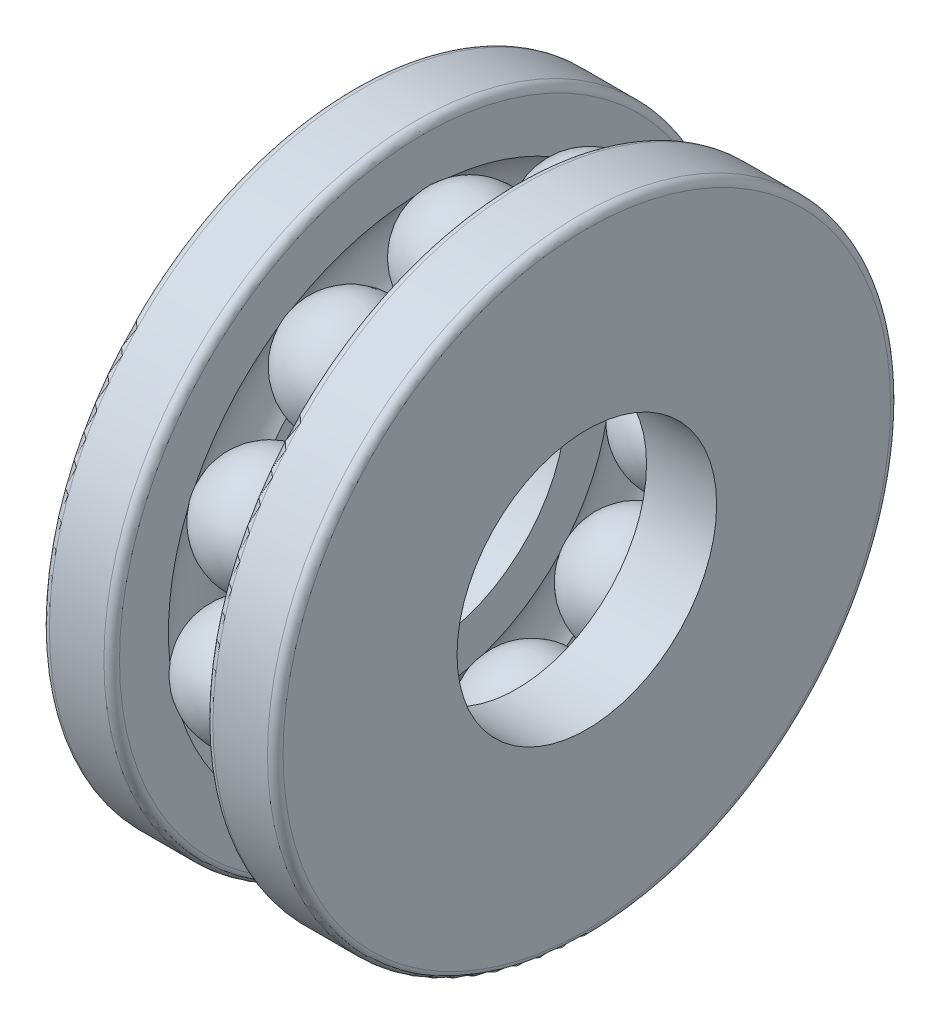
ISO-10303-21;
HEADER;
FILE_DESCRIPTION(('STEP AP214'),'2;1');
FILE_NAME('part.step','',(''),(''),'','','');
FILE_SCHEMA(('AUTOMOTIVE_DESIGN { 1 0 10303 214 1 1 1 1 }'));
ENDSEC;
DATA;
#1=APPLICATION_CONTEXT('core data for automotive mechanical design processes');
#2=APPLICATION_PROTOCOL_DEFINITION('international standard','automotive_design',2000,#1);
#3=PRODUCT_CONTEXT('',#1,'mechanical');
#4=PRODUCT('Part','Part','',(#3));
#5=PRODUCT_RELATED_PRODUCT_CATEGORY('part','',(#4));
#6=PRODUCT_DEFINITION_FORMATION('','',#4);
#7=PRODUCT_DEFINITION_CONTEXT('part definition',#1,'design');
#8=PRODUCT_DEFINITION('design','',#6,#7);
#9=PRODUCT_DEFINITION_SHAPE('','',#8);
#10=(LENGTH_UNIT() NAMED_UNIT(*) SI_UNIT(.MILLI.,.METRE.));
#11=(NAMED_UNIT(*) PLANE_ANGLE_UNIT() SI_UNIT($,.RADIAN.));
#12=(NAMED_UNIT(*) SI_UNIT($,.STERADIAN.) SOLID_ANGLE_UNIT());
#13=UNCERTAINTY_MEASURE_WITH_UNIT(LENGTH_MEASURE(1.E-05),#10,'distance_accuracy_value','');
#14=(GEOMETRIC_REPRESENTATION_CONTEXT(3) GLOBAL_UNCERTAINTY_ASSIGNED_CONTEXT((#13)) GLOBAL_UNIT_ASSIGNED_CONTEXT((#10,
#11,#12)) REPRESENTATION_CONTEXT('',''));
#15=CARTESIAN_POINT('',(0.,0.,0.));
#16=DIRECTION('',(0.,0.,1.));
#17=DIRECTION('',(1.,0.,0.));
#18=AXIS2_PLACEMENT_3D('',#15,#16,#17);
#19=CARTESIAN_POINT('',(0.,0.,0.));
#20=DIRECTION('',(-1.,0.,0.));
#21=DIRECTION('',(0.,0.,1.));
#22=AXIS2_PLACEMENT_3D('',#19,#20,#21);
#23=TOROIDAL_SURFACE('',#22,8.5,2.23);
#24=CARTESIAN_POINT('',(1.8,0.,0.));
#25=DIRECTION('',(-1.,0.,0.));
#26=DIRECTION('',(0.,0.,1.));
#27=AXIS2_PLACEMENT_3D('',#24,#25,#26);
#28=CIRCLE('',#27,9.81639659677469);
#29=CARTESIAN_POINT('',(1.8,9.8111260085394,-0.3216342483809));
#30=VERTEX_POINT('',#29);
#31=CARTESIAN_POINT('',(1.80000000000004,8.42753301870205,-5.03371923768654));
#32=VERTEX_POINT('',#31);
#33=EDGE_CURVE('E325',#30,#32,#28,.T.);
#34=ORIENTED_EDGE('',*,*,#33,.T.);
#35=CARTESIAN_POINT('',(1.79979999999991,8.42776546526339,-5.03386329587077));
#36=CARTESIAN_POINT('',(1.83684498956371,8.38471680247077,-5.0071839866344));
#37=CARTESIAN_POINT('',(1.87173422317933,8.34035780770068,-4.9796963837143));
#38=CARTESIAN_POINT('',(1.93699385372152,8.24929877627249,-4.92327939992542));
#39=CARTESIAN_POINT('',(1.96736446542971,8.20259885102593,-4.89435008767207));
#40=CARTESIAN_POINT('',(2.05131034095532,8.05954057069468,-4.8057444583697));
#41=CARTESIAN_POINT('',(2.09782935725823,7.96009596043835,-4.74417126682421));
#42=CARTESIAN_POINT('',(2.17056560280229,7.75596739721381,-4.61782957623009));
#43=CARTESIAN_POINT('',(2.19677462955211,7.65128134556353,-4.55305979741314));
#44=CARTESIAN_POINT('',(2.22815569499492,7.43963630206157,-4.42216888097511));
#45=CARTESIAN_POINT('',(2.23333226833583,7.33267780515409,-4.35604803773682));
#46=CARTESIAN_POINT('',(2.22250635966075,7.11949644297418,-4.22431975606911));
#47=CARTESIAN_POINT('',(2.20649855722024,7.01327376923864,-4.15871245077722));
#48=CARTESIAN_POINT('',(2.15373773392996,6.80458459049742,-4.02987712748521));
#49=CARTESIAN_POINT('',(2.11698756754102,6.70211757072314,-3.96664878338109));
#50=CARTESIAN_POINT('',(2.03573740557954,6.52924239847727,-3.86002352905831));
#51=CARTESIAN_POINT('',(1.99560868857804,6.45732626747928,-3.81568355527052));
#52=CARTESIAN_POINT('',(1.90517151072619,6.31840420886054,-3.73005966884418));
#53=CARTESIAN_POINT('',(1.85487657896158,6.25139191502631,-3.68877179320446));
#54=CARTESIAN_POINT('',(1.7998,6.18731083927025,-3.64930323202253));
#55=B_SPLINE_CURVE_WITH_KNOTS('',3,(#35,#36,#37,#38,#39,#40,#41,#42,#43,#44,#45,#46,#47,#48,#49,
#50,#51,#52,#53,#54),.UNSPECIFIED.,.F.,.F.,(4,2,2,2,2,2,2,2,2,4),(0.,0.188128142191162,
0.376247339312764,0.751934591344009,1.12777349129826,1.50353135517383,1.87938360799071,
2.25518415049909,2.53507908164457,2.81460395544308),.UNSPECIFIED.);
#56=CARTESIAN_POINT('',(1.8,6.18754369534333,-3.64944665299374));
#57=VERTEX_POINT('',#56);
#58=EDGE_CURVE('E311',#32,#57,#55,.T.);
#59=ORIENTED_EDGE('',*,*,#58,.T.);
#60=CARTESIAN_POINT('',(1.8,0.,0.));
#61=DIRECTION('',(-1.,0.,0.));
#62=DIRECTION('',(0.,0.,1.));
#63=AXIS2_PLACEMENT_3D('',#60,#61,#62);
#64=CIRCLE('',#63,7.18360340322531);
#65=CARTESIAN_POINT('',(1.8,7.17833281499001,-0.27512879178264));
#66=VERTEX_POINT('',#65);
#67=EDGE_CURVE('E322',#66,#57,#64,.T.);
#68=ORIENTED_EDGE('',*,*,#67,.F.);
#69=CARTESIAN_POINT('',(1.7998,9.81139943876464,-0.321638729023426));
#70=CARTESIAN_POINT('',(1.8368449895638,9.76076067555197,-0.320808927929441));
#71=CARTESIAN_POINT('',(1.87173422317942,9.70858259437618,-0.319950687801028));
#72=CARTESIAN_POINT('',(1.93699385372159,9.60147753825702,-0.318181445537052));
#73=CARTESIAN_POINT('',(1.96736446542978,9.54655069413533,-0.317270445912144));
#74=CARTESIAN_POINT('',(2.05131034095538,9.3782985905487,-0.314467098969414));
#75=CARTESIAN_POINT('',(2.09782935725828,9.26135148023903,-0.312501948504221));
#76=CARTESIAN_POINT('',(2.17056560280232,9.0213221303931,-0.30842710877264));
#77=CARTESIAN_POINT('',(2.19677462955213,8.89823743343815,-0.306317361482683));
#78=CARTESIAN_POINT('',(2.22815569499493,8.64942532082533,-0.302005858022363));
#79=CARTESIAN_POINT('',(2.23333226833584,8.5236984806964,-0.299804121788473));
#80=CARTESIAN_POINT('',(2.22250635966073,8.27314122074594,-0.295366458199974));
#81=CARTESIAN_POINT('',(2.20649855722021,8.14831103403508,-0.293130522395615));
#82=CARTESIAN_POINT('',(2.15373773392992,7.90309689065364,-0.288687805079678));
#83=CARTESIAN_POINT('',(2.11698756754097,7.78271232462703,-0.286481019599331));
#84=CARTESIAN_POINT('',(2.03573740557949,7.57963451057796,-0.282716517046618));
#85=CARTESIAN_POINT('',(1.99560868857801,7.4951628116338,-0.281136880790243));
#86=CARTESIAN_POINT('',(1.90517151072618,7.33200237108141,-0.278061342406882));
#87=CARTESIAN_POINT('',(1.8548765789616,7.25330613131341,-0.276565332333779));
#88=CARTESIAN_POINT('',(1.79980000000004,7.17805938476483,-0.27512355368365));
#89=B_SPLINE_CURVE_WITH_KNOTS('',3,(#69,#70,#71,#72,#73,#74,#75,#76,#77,#78,#79,#80,#81,#82,#83,
#84,#85,#86,#87,#88),.UNSPECIFIED.,.F.,.F.,(4,2,2,2,2,2,2,2,2,4),(0.,0.188128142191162,
0.376247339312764,0.75193459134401,1.12777349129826,1.50353135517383,1.87938360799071,
2.25518415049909,2.53507908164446,2.81460395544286),.UNSPECIFIED.);
#90=EDGE_CURVE('E408',#30,#66,#89,.T.);
#91=ORIENTED_EDGE('',*,*,#90,.F.);
#92=EDGE_LOOP('',(#34,#59,#68,#91));
#93=FACE_BOUND('',#92,.T.);
#94=ADVANCED_FACE('F30',(#93),#23,.F.);
#95=CARTESIAN_POINT('',(0.,0.,0.));
#96=DIRECTION('',(-1.,0.,0.));
#97=DIRECTION('',(0.,0.,1.));
#98=AXIS2_PLACEMENT_3D('',#95,#96,#97);
#99=TOROIDAL_SURFACE('',#98,8.5,2.23);
#100=CARTESIAN_POINT('',(-1.8,0.,0.));
#101=DIRECTION('',(-1.,0.,0.));
#102=DIRECTION('',(0.,0.,1.));
#103=AXIS2_PLACEMENT_3D('',#100,#101,#102);
#104=CIRCLE('',#103,9.81639659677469);
#105=CARTESIAN_POINT('',(-1.8,8.07975581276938,-5.57487113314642));
#106=VERTEX_POINT('',#105);
#107=CARTESIAN_POINT('',(-1.8,4.3682578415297,-8.79090243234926));
#108=VERTEX_POINT('',#107);
#109=EDGE_CURVE('E951',#106,#108,#104,.T.);
#110=ORIENTED_EDGE('',*,*,#109,.F.);
#111=CARTESIAN_POINT('',(-1.7998,8.07998341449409,-5.57502273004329));
#112=CARTESIAN_POINT('',(-1.8368449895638,8.03783200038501,-5.54694727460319));
#113=CARTESIAN_POINT('',(-1.87173422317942,7.99440100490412,-5.518015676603));
#114=CARTESIAN_POINT('',(-1.93699385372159,7.90525502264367,-5.45862193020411));
#115=CARTESIAN_POINT('',(-1.96736446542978,7.85954014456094,-5.42815985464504));
#116=CARTESIAN_POINT('',(-2.05131034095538,7.71951307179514,-5.33483757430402));
#117=CARTESIAN_POINT('',(-2.09782935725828,7.62219334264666,-5.26995800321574));
#118=CARTESIAN_POINT('',(-2.17056560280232,7.42247082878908,-5.13676036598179));
#119=CARTESIAN_POINT('',(-2.19677462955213,7.32006600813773,-5.06844092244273));
#120=CARTESIAN_POINT('',(-2.22815569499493,7.11308291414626,-4.93029587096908));
#121=CARTESIAN_POINT('',(-2.23333226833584,7.00850511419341,-4.86047059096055));
#122=CARTESIAN_POINT('',(-2.22250635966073,6.80012211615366,-4.72127590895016));
#123=CARTESIAN_POINT('',(-2.20649855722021,6.69631711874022,-4.65190662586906));
#124=CARTESIAN_POINT('',(-2.15373773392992,6.49243176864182,-4.51559639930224));
#125=CARTESIAN_POINT('',(-2.11698756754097,6.39235090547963,-4.44865512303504));
#126=CARTESIAN_POINT('',(-2.03573740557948,6.22354622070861,-4.33569606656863));
#127=CARTESIAN_POINT('',(-1.995608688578,6.15333812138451,-4.28869834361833));
#128=CARTESIAN_POINT('',(-1.90517151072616,6.0177415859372,-4.1978998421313));
#129=CARTESIAN_POINT('',(-1.85487657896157,5.95234690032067,-4.15409491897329));
#130=CARTESIAN_POINT('',(-1.7998,5.88982479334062,-4.11220055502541));
#131=B_SPLINE_CURVE_WITH_KNOTS('',3,(#111,#112,#113,#114,#115,#116,#117,#118,#119,#120,#121,
#122,#123,#124,#125,#126,#127,#128,#129,#130),.UNSPECIFIED.,.F.,.F.,(4,2,2,2,2,2,2,2,2,4),(0.,
0.188128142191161,0.376247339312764,0.751934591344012,1.12777349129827,1.50353135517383,
1.87938360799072,2.25518415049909,2.53507908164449,2.81460395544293),.UNSPECIFIED.);
#132=CARTESIAN_POINT('',(-1.79999999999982,5.89005198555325,-4.11235278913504));
#133=VERTEX_POINT('',#132);
#134=EDGE_CURVE('E45',#106,#133,#131,.T.);
#135=ORIENTED_EDGE('',*,*,#134,.T.);
#136=CARTESIAN_POINT('',(-1.8,0.,0.));
#137=DIRECTION('',(-1.,0.,0.));
#138=DIRECTION('',(0.,0.,1.));
#139=AXIS2_PLACEMENT_3D('',#136,#137,#138);
#140=CIRCLE('',#139,7.18360340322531);
#141=CARTESIAN_POINT('',(-1.80000000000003,3.23225317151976,-6.4153485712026));
#142=VERTEX_POINT('',#141);
#143=EDGE_CURVE('E1002',#133,#142,#140,.T.);
#144=ORIENTED_EDGE('',*,*,#143,.T.);
#145=CARTESIAN_POINT('',(-1.7998,3.23213481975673,-6.41510202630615));
#146=CARTESIAN_POINT('',(-1.83684619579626,3.25405409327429,-6.46076315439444));
#147=CARTESIAN_POINT('',(-1.87173650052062,3.2766349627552,-6.50781448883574));
#148=CARTESIAN_POINT('',(-1.93699800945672,3.3229760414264,-6.60440082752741));
#149=CARTESIAN_POINT('',(-1.96736942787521,3.34673619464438,-6.65393571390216));
#150=CARTESIAN_POINT('',(-2.05131746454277,3.41950203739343,-6.80567926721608));
#151=CARTESIAN_POINT('',(-2.09783738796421,3.47005805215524,-6.91116209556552));
#152=CARTESIAN_POINT('',(-2.17057394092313,3.57377530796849,-7.1276843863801));
#153=CARTESIAN_POINT('',(-2.196782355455,3.6269375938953,-7.23872607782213));
#154=CARTESIAN_POINT('',(-2.22815990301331,3.73435721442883,-7.46321623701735));
#155=CARTESIAN_POINT('',(-2.23333358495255,3.78861430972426,-7.57666417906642));
#156=CARTESIAN_POINT('',(-2.22249902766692,3.89669629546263,-7.80276806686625));
#157=CARTESIAN_POINT('',(-2.20648622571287,3.95052109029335,-7.91542383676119));
#158=CARTESIAN_POINT('',(-2.15371323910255,4.05621485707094,-8.1367408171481));
#159=CARTESIAN_POINT('',(-2.11695592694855,4.10808409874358,-8.24540257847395));
#160=CARTESIAN_POINT('',(-2.03570012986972,4.19554481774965,-8.42869765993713));
#161=CARTESIAN_POINT('',(-1.99557616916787,4.23191033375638,-8.50493410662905));
#162=CARTESIAN_POINT('',(-1.90515241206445,4.30213703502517,-8.65219565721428));
#163=CARTESIAN_POINT('',(-1.85486613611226,4.33600146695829,-8.72322751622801));
#164=CARTESIAN_POINT('',(-1.79979999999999,4.36837550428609,-8.79114929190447));
#165=B_SPLINE_CURVE_WITH_KNOTS('',3,(#145,#146,#147,#148,#149,#150,#151,#152,#153,#154,#155,
#156,#157,#158,#159,#160,#161,#162,#163,#164),.UNSPECIFIED.,.F.,.F.,(4,2,2,2,2,2,2,2,2,4),(0.,
0.188140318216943,0.376271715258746,0.751984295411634,1.12784875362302,1.5036319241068,
1.87949603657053,2.25530811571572,2.53514090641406,2.81460381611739),.UNSPECIFIED.);
#166=EDGE_CURVE('E589',#142,#108,#165,.T.);
#167=ORIENTED_EDGE('',*,*,#166,.T.);
#168=EDGE_LOOP('',(#110,#135,#144,#167));
#169=FACE_BOUND('',#168,.T.);
#170=ADVANCED_FACE('F853',(#169),#99,.F.);
#171=CARTESIAN_POINT('',(-1.8,3.7831202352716,-9.05812582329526));
#172=VERTEX_POINT('',#171);
#173=CARTESIAN_POINT('',(-1.8,-1.07790833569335,-9.75703621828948));
#174=VERTEX_POINT('',#173);
#175=EDGE_CURVE('E957',#172,#174,#104,.T.);
#176=ORIENTED_EDGE('',*,*,#175,.F.);
#177=CARTESIAN_POINT('',(-1.7998,3.78322974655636,-9.05837640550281));
#178=CARTESIAN_POINT('',(-1.83684498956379,3.76294845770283,-9.01196905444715));
#179=CARTESIAN_POINT('',(-1.87173422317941,3.74205358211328,-8.96414967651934));
#180=CARTESIAN_POINT('',(-1.93699385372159,3.69916989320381,-8.86598852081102));
#181=CARTESIAN_POINT('',(-1.96736446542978,3.67718113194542,-8.81564686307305));
#182=CARTESIAN_POINT('',(-2.05131034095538,3.60983669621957,-8.66143481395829));
#183=CARTESIAN_POINT('',(-2.09782935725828,3.56304267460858,-8.55423962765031));
#184=CARTESIAN_POINT('',(-2.17056560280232,3.46703748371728,-8.33420850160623));
#185=CARTESIAN_POINT('',(-2.19677462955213,3.41782534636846,-8.22137030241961));
#186=CARTESIAN_POINT('',(-2.22815569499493,3.31838694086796,-7.99325178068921));
#187=CARTESIAN_POINT('',(-2.23333226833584,3.2681608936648,-7.87797198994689));
#188=CARTESIAN_POINT('',(-2.22250635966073,3.16811228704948,-7.64821361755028));
#189=CARTESIAN_POINT('',(-2.20649855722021,3.11828983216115,-7.53373524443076));
#190=CARTESIAN_POINT('',(-2.15373773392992,3.020465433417,-7.30883504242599));
#191=CARTESIAN_POINT('',(-2.11698756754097,2.97246324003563,-7.19841265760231));
#192=CARTESIAN_POINT('',(-2.03573740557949,2.89152597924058,-7.01212274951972));
#193=CARTESIAN_POINT('',(-1.995608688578,2.85787205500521,-6.93462838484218));
#194=CARTESIAN_POINT('',(-1.90517151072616,2.79289036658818,-6.78493480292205));
#195=CARTESIAN_POINT('',(-1.85487657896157,2.76155958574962,-6.71272872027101));
#196=CARTESIAN_POINT('',(-1.7998,2.73161244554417,-6.64368293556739));
#197=B_SPLINE_CURVE_WITH_KNOTS('',3,(#177,#178,#179,#180,#181,#182,#183,#184,#185,#186,#187,
#188,#189,#190,#191,#192,#193,#194,#195,#196),.UNSPECIFIED.,.F.,.F.,(4,2,2,2,2,2,2,2,2,4),(0.,
0.188128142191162,0.376247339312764,0.75193459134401,1.12777349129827,1.50353135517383,
1.87938360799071,2.25518415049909,2.53507908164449,2.81460395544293),.UNSPECIFIED.);
#198=CARTESIAN_POINT('',(-1.79999999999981,2.7317212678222,-6.6439338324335));
#199=VERTEX_POINT('',#198);
#200=EDGE_CURVE('E597',#172,#199,#197,.T.);
#201=ORIENTED_EDGE('',*,*,#200,.T.);
#202=CARTESIAN_POINT('',(-1.80000000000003,-0.749254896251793,-7.14442264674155));
#203=VERTEX_POINT('',#202);
#204=EDGE_CURVE('E1003',#199,#203,#140,.T.);
#205=ORIENTED_EDGE('',*,*,#204,.T.);
#206=CARTESIAN_POINT('',(-1.79980000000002,-0.749221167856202,-7.14415125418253));
#207=CARTESIAN_POINT('',(-1.83684619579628,-0.755467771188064,-7.19441429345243));
#208=CARTESIAN_POINT('',(-1.87173650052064,-0.761909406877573,-7.24620453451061));
#209=CARTESIAN_POINT('',(-1.93699800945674,-0.775143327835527,-7.35251201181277));
#210=CARTESIAN_POINT('',(-1.96736942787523,-0.781935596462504,-7.40702911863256));
#211=CARTESIAN_POINT('',(-2.05131746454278,-0.80275983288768,-7.57402410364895));
#212=CARTESIAN_POINT('',(-2.09783738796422,-0.817257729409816,-7.69009455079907));
#213=CARTESIAN_POINT('',(-2.17057394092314,-0.847066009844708,-7.92831847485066));
#214=CARTESIAN_POINT('',(-2.19678235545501,-0.862376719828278,-8.0504743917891));
#215=CARTESIAN_POINT('',(-2.22815990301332,-0.893378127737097,-8.29740296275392));
#216=CARTESIAN_POINT('',(-2.23333358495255,-0.909068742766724,-8.42217504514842));
#217=CARTESIAN_POINT('',(-2.22249902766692,-0.940385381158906,-8.67081927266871));
#218=CARTESIAN_POINT('',(-2.20648622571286,-0.956011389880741,-8.7946912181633));
#219=CARTESIAN_POINT('',(-2.15371323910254,-0.98674912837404,-9.03801727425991));
#220=CARTESIAN_POINT('',(-2.11695592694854,-1.00186092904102,-9.15747199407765));
#221=CARTESIAN_POINT('',(-2.03570012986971,-1.02738109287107,-9.35895446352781));
#222=CARTESIAN_POINT('',(-1.99557616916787,-1.03800500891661,-9.44274932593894));
#223=CARTESIAN_POINT('',(-1.90515241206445,-1.05854215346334,-9.60460104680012));
#224=CARTESIAN_POINT('',(-1.85486613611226,-1.06845630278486,-9.68266534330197));
#225=CARTESIAN_POINT('',(-1.7998,-1.07794281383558,-9.75730750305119));
#226=B_SPLINE_CURVE_WITH_KNOTS('',3,(#206,#207,#208,#209,#210,#211,#212,#213,#214,#215,#216,
#217,#218,#219,#220,#221,#222,#223,#224,#225),.UNSPECIFIED.,.F.,.F.,(4,2,2,2,2,2,2,2,2,4),(0.,
0.188140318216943,0.376271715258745,0.751984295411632,1.12784875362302,1.5036319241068,
1.87949603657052,2.25530811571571,2.53514090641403,2.81460381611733),.UNSPECIFIED.);
#227=EDGE_CURVE('E623',#203,#174,#226,.T.);
#228=ORIENTED_EDGE('',*,*,#227,.T.);
#229=EDGE_LOOP('',(#176,#201,#205,#228));
#230=FACE_BOUND('',#229,.T.);
#231=ADVANCED_FACE('F858',(#230),#99,.F.);
#232=CARTESIAN_POINT('',(1.8,5.89005198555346,-4.11235278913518));
#233=VERTEX_POINT('',#232);
#234=CARTESIAN_POINT('',(1.8,3.23225317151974,-6.41534857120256));
#235=VERTEX_POINT('',#234);
#236=EDGE_CURVE('E333',#233,#235,#64,.T.);
#237=ORIENTED_EDGE('',*,*,#236,.F.);
#238=CARTESIAN_POINT('',(1.7998,5.88982479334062,-4.11220055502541));
#239=CARTESIAN_POINT('',(1.83684619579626,5.93190171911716,-4.1403949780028));
#240=CARTESIAN_POINT('',(1.87173650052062,5.97526054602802,-4.16944210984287));
#241=CARTESIAN_POINT('',(1.93699800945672,6.06426875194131,-4.22905717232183));
#242=CARTESIAN_POINT('',(1.96736942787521,6.10991802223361,-4.25962503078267));
#243=CARTESIAN_POINT('',(2.05131746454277,6.24976138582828,-4.3532455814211));
#244=CARTESIAN_POINT('',(2.09783738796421,6.34697568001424,-4.41829878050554));
#245=CARTESIAN_POINT('',(2.17057394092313,6.54653358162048,-4.55177467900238));
#246=CARTESIAN_POINT('',(2.196782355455,6.64887924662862,-4.6201987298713));
#247=CARTESIAN_POINT('',(2.22815990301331,6.8557970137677,-4.75847325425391));
#248=CARTESIAN_POINT('',(2.23333358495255,6.96036862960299,-4.82832341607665));
#249=CARTESIAN_POINT('',(2.22249902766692,7.1687894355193,-4.96748322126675));
#250=CARTESIAN_POINT('',(2.20648622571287,7.27263846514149,-5.03679274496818));
#251=CARTESIAN_POINT('',(2.15371323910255,7.47666096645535,-5.1729073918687));
#252=CARTESIAN_POINT('',(2.11695592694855,7.57683494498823,-5.23971286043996));
#253=CARTESIAN_POINT('',(2.03570012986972,7.74581738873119,-5.3523689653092));
#254=CARTESIAN_POINT('',(1.99557616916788,7.81610250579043,-5.39921391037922));
#255=CARTESIAN_POINT('',(1.90515241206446,7.95187084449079,-5.48968330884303));
#256=CARTESIAN_POINT('',(1.85486613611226,8.01736029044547,-5.53331193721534));
#257=CARTESIAN_POINT('',(1.7998,8.07998341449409,-5.57502273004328));
#258=B_SPLINE_CURVE_WITH_KNOTS('',3,(#238,#239,#240,#241,#242,#243,#244,#245,#246,#247,#248,
#249,#250,#251,#252,#253,#254,#255,#256,#257),.UNSPECIFIED.,.F.,.F.,(4,2,2,2,2,2,2,2,2,4),(0.,
0.188140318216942,0.376271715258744,0.751984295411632,1.12784875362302,1.5036319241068,
1.87949603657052,2.25530811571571,2.53514090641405,2.81460381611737),.UNSPECIFIED.);
#259=CARTESIAN_POINT('',(1.79999999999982,8.07975581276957,-5.57487113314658));
#260=VERTEX_POINT('',#259);
#261=EDGE_CURVE('E53',#233,#260,#258,.T.);
#262=ORIENTED_EDGE('',*,*,#261,.T.);
#263=CARTESIAN_POINT('',(1.80000000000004,4.36825784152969,-8.7909024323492));
#264=VERTEX_POINT('',#263);
#265=EDGE_CURVE('E968',#260,#264,#28,.T.);
#266=ORIENTED_EDGE('',*,*,#265,.T.);
#267=CARTESIAN_POINT('',(1.79979999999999,4.3683755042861,-8.79114929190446));
#268=CARTESIAN_POINT('',(1.83684498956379,4.34658458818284,-8.74543136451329));
#269=CARTESIAN_POINT('',(1.87173422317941,4.32412834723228,-8.69832503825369));
#270=CARTESIAN_POINT('',(1.93699385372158,4.27802593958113,-8.60163382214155));
#271=CARTESIAN_POINT('',(1.96736446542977,4.25437982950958,-8.55204905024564));
#272=CARTESIAN_POINT('',(2.05131034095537,4.18193536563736,-8.40016610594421));
#273=CARTESIAN_POINT('',(2.09782935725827,4.13156621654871,-8.29460362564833));
#274=CARTESIAN_POINT('',(2.17056560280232,4.02814781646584,-8.0779579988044));
#275=CARTESIAN_POINT('',(2.19677462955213,3.97509749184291,-7.96687264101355));
#276=CARTESIAN_POINT('',(2.22815569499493,3.86781532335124,-7.74233624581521));
#277=CARTESIAN_POINT('',(2.23333226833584,3.81358373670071,-7.62888572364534));
#278=CARTESIAN_POINT('',(2.22250635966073,3.70546184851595,-7.40281429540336));
#279=CARTESIAN_POINT('',(2.20649855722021,3.65157163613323,-7.29019360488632));
#280=CARTESIAN_POINT('',(2.15373773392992,3.54566476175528,-7.06898454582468));
#281=CARTESIAN_POINT('',(2.11698756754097,3.49364784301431,-6.96039562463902));
#282=CARTESIAN_POINT('',(2.03573740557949,3.40586195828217,-6.77723337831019));
#283=CARTESIAN_POINT('',(1.995608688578,3.36933425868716,-6.7010514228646));
#284=CARTESIAN_POINT('',(1.90517151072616,3.29875735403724,-6.55391309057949));
#285=CARTESIAN_POINT('',(1.85487657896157,3.26470493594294,-6.48294993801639));
#286=CARTESIAN_POINT('',(1.7998,3.23213481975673,-6.41510202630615));
#287=B_SPLINE_CURVE_WITH_KNOTS('',3,(#267,#268,#269,#270,#271,#272,#273,#274,#275,#276,#277,
#278,#279,#280,#281,#282,#283,#284,#285,#286),.UNSPECIFIED.,.F.,.F.,(4,2,2,2,2,2,2,2,2,4),(0.,
0.188128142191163,0.376247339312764,0.75193459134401,1.12777349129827,1.50353135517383,
1.87938360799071,2.25518415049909,2.5350790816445,2.81460395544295),.UNSPECIFIED.);
#288=EDGE_CURVE('E536',#264,#235,#287,.T.);
#289=ORIENTED_EDGE('',*,*,#288,.T.);
#290=EDGE_LOOP('',(#237,#262,#266,#289));
#291=FACE_BOUND('',#290,.T.);
#292=ADVANCED_FACE('F854',(#291),#23,.F.);
#293=CARTESIAN_POINT('',(-1.8,7.17833281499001,-0.275128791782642));
#294=VERTEX_POINT('',#293);
#295=CARTESIAN_POINT('',(-1.80000000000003,6.18754369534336,-3.64944665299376));
#296=VERTEX_POINT('',#295);
#297=EDGE_CURVE('E956',#294,#296,#140,.T.);
#298=ORIENTED_EDGE('',*,*,#297,.T.);
#299=CARTESIAN_POINT('',(-1.7998,6.18731083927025,-3.64930323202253));
#300=CARTESIAN_POINT('',(-1.83684619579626,6.23043677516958,-3.6758653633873));
#301=CARTESIAN_POINT('',(-1.87173650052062,6.27487088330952,-3.70323932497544));
#302=CARTESIAN_POINT('',(-1.93699800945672,6.36607399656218,-3.75943904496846));
#303=CARTESIAN_POINT('',(-1.96736942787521,6.41284289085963,-3.78826473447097));
#304=CARTESIAN_POINT('',(-2.05131746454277,6.55609617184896,-3.87657935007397));
#305=CARTESIAN_POINT('',(-2.09783738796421,6.65565492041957,-3.93798450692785));
#306=CARTESIAN_POINT('',(-2.17057394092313,6.85996821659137,-4.06406086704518));
#307=CARTESIAN_POINT('',(-2.196782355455,6.96472484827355,-4.12873338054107));
#308=CARTESIAN_POINT('',(-2.22815990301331,7.17646052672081,-4.25951108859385));
#309=CARTESIAN_POINT('',(-2.23333358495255,7.28343908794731,-4.32561597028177));
#310=CARTESIAN_POINT('',(-2.22249902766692,7.49660443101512,-4.45739313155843));
#311=CARTESIAN_POINT('',(-2.20648622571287,7.60279103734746,-4.5230653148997));
#312=CARTESIAN_POINT('',(-2.15371323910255,7.81135928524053,-4.65210664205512));
#313=CARTESIAN_POINT('',(-2.11695592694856,7.91374145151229,-4.71547610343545));
#314=CARTESIAN_POINT('',(-2.03570012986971,8.08641489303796,-4.82238890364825));
#315=CARTESIAN_POINT('',(-1.99557616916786,8.15822404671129,-4.86686240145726));
#316=CARTESIAN_POINT('',(-1.90515241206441,8.29691811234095,-4.95277927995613));
#317=CARTESIAN_POINT('',(-1.8548661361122,8.36380940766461,-4.99422658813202));
#318=CARTESIAN_POINT('',(-1.79979999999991,8.4277654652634,-5.03386329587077));
#319=B_SPLINE_CURVE_WITH_KNOTS('',3,(#299,#300,#301,#302,#303,#304,#305,#306,#307,#308,#309,
#310,#311,#312,#313,#314,#315,#316,#317,#318),.UNSPECIFIED.,.F.,.F.,(4,2,2,2,2,2,2,2,2,4),(0.,
0.188140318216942,0.376271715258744,0.751984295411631,1.12784875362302,1.5036319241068,
1.87949603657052,2.25530811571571,2.53514090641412,2.81460381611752),.UNSPECIFIED.);
#320=CARTESIAN_POINT('',(-1.8,8.42753301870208,-5.03371923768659));
#321=VERTEX_POINT('',#320);
#322=EDGE_CURVE('E560',#296,#321,#319,.T.);
#323=ORIENTED_EDGE('',*,*,#322,.T.);
#324=CARTESIAN_POINT('',(-1.8,9.8111260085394,-0.321634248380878));
#325=VERTEX_POINT('',#324);
#326=EDGE_CURVE('E945',#325,#321,#104,.T.);
#327=ORIENTED_EDGE('',*,*,#326,.F.);
#328=CARTESIAN_POINT('',(-1.79980000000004,7.17805938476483,-0.275123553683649));
#329=CARTESIAN_POINT('',(-1.83684619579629,7.22869980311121,-0.276093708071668));
#330=CARTESIAN_POINT('',(-1.87173650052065,7.28087963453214,-0.277088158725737));
#331=CARTESIAN_POINT('',(-1.93699800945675,7.38798843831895,-0.279118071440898));
#332=CARTESIAN_POINT('',(-1.96736942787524,7.44291728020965,-0.280153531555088));
#333=CARTESIAN_POINT('',(-2.05131746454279,7.61117609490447,-0.283307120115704));
#334=CARTESIAN_POINT('',(-2.09783738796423,7.72812837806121,-0.285475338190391));
#335=CARTESIAN_POINT('',(-2.17057394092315,7.96816968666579,-0.289873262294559));
#336=CARTESIAN_POINT('',(-2.19678235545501,8.09126117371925,-0.292102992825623));
#337=CARTESIAN_POINT('',(-2.22815990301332,8.34008832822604,-0.296558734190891));
#338=CARTESIAN_POINT('',(-2.23333358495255,8.46582341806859,-0.29878474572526));
#339=CARTESIAN_POINT('',(-2.22249902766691,8.71639362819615,-0.303172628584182));
#340=CARTESIAN_POINT('',(-2.20648622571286,8.8412285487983,-0.305334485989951));
#341=CARTESIAN_POINT('',(-2.15371323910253,9.08645233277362,-0.309538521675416));
#342=CARTESIAN_POINT('',(-2.11695592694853,9.20684180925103,-0.311580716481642));
#343=CARTESIAN_POINT('',(-2.0357001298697,9.4099053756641,-0.314994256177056));
#344=CARTESIAN_POINT('',(-1.99557616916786,9.49435926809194,-0.316403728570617));
#345=CARTESIAN_POINT('',(-1.90515241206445,9.65748631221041,-0.319109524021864));
#346=CARTESIAN_POINT('',(-1.85486613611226,9.7361669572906,-0.320405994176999));
#347=CARTESIAN_POINT('',(-1.7998,9.81139943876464,-0.321638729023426));
#348=B_SPLINE_CURVE_WITH_KNOTS('',3,(#328,#329,#330,#331,#332,#333,#334,#335,#336,#337,#338,
#339,#340,#341,#342,#343,#344,#345,#346,#347),.UNSPECIFIED.,.F.,.F.,(4,2,2,2,2,2,2,2,2,4),(0.,
0.188140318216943,0.376271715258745,0.751984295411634,1.12784875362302,1.50363192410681,
1.87949603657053,2.25530811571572,2.53514090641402,2.8146038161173),.UNSPECIFIED.);
#349=EDGE_CURVE('E822',#294,#325,#348,.T.);
#350=ORIENTED_EDGE('',*,*,#349,.F.);
#351=EDGE_LOOP('',(#298,#323,#327,#350));
#352=FACE_BOUND('',#351,.T.);
#353=ADVANCED_FACE('F861',(#352),#99,.F.);
#354=CARTESIAN_POINT('',(1.8,2.7317212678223,-6.64393383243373));
#355=VERTEX_POINT('',#354);
#356=CARTESIAN_POINT('',(1.8,-0.749254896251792,-7.14442264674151));
#357=VERTEX_POINT('',#356);
#358=EDGE_CURVE('E338',#355,#357,#64,.T.);
#359=ORIENTED_EDGE('',*,*,#358,.F.);
#360=CARTESIAN_POINT('',(1.7998,2.73161244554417,-6.64368293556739));
#361=CARTESIAN_POINT('',(1.83684619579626,2.75176675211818,-6.69015009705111));
#362=CARTESIAN_POINT('',(1.87173650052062,2.7725384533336,-6.73802765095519));
#363=CARTESIAN_POINT('',(1.93699800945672,2.81518658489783,-6.83630050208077));
#364=CARTESIAN_POINT('',(1.96736942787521,2.83706296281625,-6.88669567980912));
#365=CARTESIAN_POINT('',(2.05131746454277,2.90409159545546,-7.04105932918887));
#366=CARTESIAN_POINT('',(2.09783738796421,2.95070304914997,-7.14834357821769));
#367=CARTESIAN_POINT('',(2.17057394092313,3.04641932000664,-7.36851979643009));
#368=CARTESIAN_POINT('',(2.196782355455,3.0955251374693,-7.48141401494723));
#369=CARTESIAN_POINT('',(2.22815990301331,3.1948385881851,-7.70960613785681));
#370=CARTESIAN_POINT('',(2.23333358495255,3.24504598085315,-7.82490351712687));
#371=CARTESIAN_POINT('',(2.22249902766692,3.34514524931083,-8.05465298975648));
#372=CARTESIAN_POINT('',(2.20648622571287,3.39503705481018,-8.16910489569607));
#373=CARTESIAN_POINT('',(2.15371323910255,3.49308257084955,-8.39391471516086));
#374=CARTESIAN_POINT('',(2.11695592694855,3.54123652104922,-8.50427319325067));
#375=CARTESIAN_POINT('',(2.03570012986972,3.62248711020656,-8.69040434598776));
#376=CARTESIAN_POINT('',(1.99557616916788,3.65628842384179,-8.76781182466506));
#377=CARTESIAN_POINT('',(1.90515241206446,3.72159256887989,-8.91732143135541));
#378=CARTESIAN_POINT('',(1.85486613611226,3.75309837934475,-8.98943043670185));
#379=CARTESIAN_POINT('',(1.7998,3.78322974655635,-9.05837640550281));
#380=B_SPLINE_CURVE_WITH_KNOTS('',3,(#360,#361,#362,#363,#364,#365,#366,#367,#368,#369,#370,
#371,#372,#373,#374,#375,#376,#377,#378,#379),.UNSPECIFIED.,.F.,.F.,(4,2,2,2,2,2,2,2,2,4),(0.,
0.188140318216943,0.376271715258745,0.751984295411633,1.12784875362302,1.5036319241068,
1.87949603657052,2.25530811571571,2.53514090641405,2.81460381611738),.UNSPECIFIED.);
#381=CARTESIAN_POINT('',(1.79999999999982,3.78312023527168,-9.0581258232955));
#382=VERTEX_POINT('',#381);
#383=EDGE_CURVE('E529',#355,#382,#380,.T.);
#384=ORIENTED_EDGE('',*,*,#383,.T.);
#385=CARTESIAN_POINT('',(1.80000000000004,-1.07790833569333,-9.75703621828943));
#386=VERTEX_POINT('',#385);
#387=EDGE_CURVE('E969',#382,#386,#28,.T.);
#388=ORIENTED_EDGE('',*,*,#387,.T.);
#389=CARTESIAN_POINT('',(1.7998,-1.07794281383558,-9.75730750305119));
#390=CARTESIAN_POINT('',(1.8368449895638,-1.07155752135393,-9.70706607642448));
#391=CARTESIAN_POINT('',(1.87173422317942,-1.06498131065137,-9.6552969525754));
#392=CARTESIAN_POINT('',(1.93699385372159,-1.05148990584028,-9.54903028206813));
#393=CARTESIAN_POINT('',(1.96736446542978,-1.04457472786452,-9.49453286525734));
#394=CARTESIAN_POINT('',(2.05131034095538,-1.0234047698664,-9.32759436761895));
#395=CARTESIAN_POINT('',(2.09782935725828,-1.00870660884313,-9.21155794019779));
#396=CARTESIAN_POINT('',(2.17056560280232,-0.97858023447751,-8.97339183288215));
#397=CARTESIAN_POINT('',(2.19677462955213,-0.963151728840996,-8.85125971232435));
#398=CARTESIAN_POINT('',(2.22815569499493,-0.932009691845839,-8.60436655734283));
#399=CARTESIAN_POINT('',(2.23333226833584,-0.916296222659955,-8.47960609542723));
#400=CARTESIAN_POINT('',(2.22250635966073,-0.885030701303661,-8.23096760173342));
#401=CARTESIAN_POINT('',(2.20649855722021,-0.869478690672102,-8.10708979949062));
#402=CARTESIAN_POINT('',(2.15373773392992,-0.838978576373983,-7.86373931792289));
#403=CARTESIAN_POINT('',(2.11698756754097,-0.824030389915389,-7.74426603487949));
#404=CARTESIAN_POINT('',(2.03573740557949,-0.798855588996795,-7.54271951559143));
#405=CARTESIAN_POINT('',(1.995608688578,-0.788397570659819,-7.45888281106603));
#406=CARTESIAN_POINT('',(1.90517151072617,-0.768221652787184,-7.2969454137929));
#407=CARTESIAN_POINT('',(1.85487657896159,-0.758502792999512,-7.21883728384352));
#408=CARTESIAN_POINT('',(1.79980000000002,-0.749221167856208,-7.14415125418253));
#409=B_SPLINE_CURVE_WITH_KNOTS('',3,(#389,#390,#391,#392,#393,#394,#395,#396,#397,#398,#399,
#400,#401,#402,#403,#404,#405,#406,#407,#408),.UNSPECIFIED.,.F.,.F.,(4,2,2,2,2,2,2,2,2,4),(0.,
0.188128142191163,0.376247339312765,0.751934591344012,1.12777349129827,1.50353135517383,
1.87938360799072,2.25518415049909,2.53507908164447,2.81460395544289),.UNSPECIFIED.);
#410=EDGE_CURVE('E522',#386,#357,#409,.T.);
#411=ORIENTED_EDGE('',*,*,#410,.T.);
#412=EDGE_LOOP('',(#359,#384,#388,#411));
#413=FACE_BOUND('',#412,.T.);
#414=ADVANCED_FACE('F862',(#413),#23,.F.);
#415=CARTESIAN_POINT('',(-1.8,-1.71462928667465,-9.66548956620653));
#416=VERTEX_POINT('',#415);
#417=CARTESIAN_POINT('',(-1.8,-6.18184623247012,-7.62537994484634));
#418=VERTEX_POINT('',#417);
#419=EDGE_CURVE('E1039',#416,#418,#104,.T.);
#420=ORIENTED_EDGE('',*,*,#419,.F.);
#421=CARTESIAN_POINT('',(-1.7998,-1.714672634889,-9.66575957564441));
#422=CARTESIAN_POINT('',(-1.8368449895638,-1.70664463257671,-9.61575433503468));
#423=CARTESIAN_POINT('',(-1.87173422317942,-1.69836941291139,-9.56422949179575));
#424=CARTESIAN_POINT('',(-1.93699385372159,-1.68137554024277,-9.45846640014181));
#425=CARTESIAN_POINT('',(-1.96736446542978,-1.67265690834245,-9.40422828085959));
#426=CARTESIAN_POINT('',(-2.05131034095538,-1.64593732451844,-9.23808769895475));
#427=CARTESIAN_POINT('',(-2.09782935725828,-1.62734886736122,-9.12261061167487));
#428=CARTESIAN_POINT('',(-2.17056560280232,-1.58915576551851,-8.88560432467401));
#429=CARTESIAN_POINT('',(-2.19677462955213,-1.5695507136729,-8.76407270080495));
#430=CARTESIAN_POINT('',(-2.22815569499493,-1.52987343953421,-8.51840672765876));
#431=CARTESIAN_POINT('',(-2.23333226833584,-1.50980131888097,-8.39427294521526));
#432=CARTESIAN_POINT('',(-2.22250635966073,-1.46975080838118,-8.14689754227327));
#433=CARTESIAN_POINT('',(-2.20649855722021,-1.44977244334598,-8.02365615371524));
#434=CARTESIAN_POINT('',(-2.15373773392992,-1.41047733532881,-7.78157020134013));
#435=CARTESIAN_POINT('',(-2.11698756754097,-1.39116050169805,-7.6627250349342));
#436=CARTESIAN_POINT('',(-2.03573740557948,-1.35853333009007,-7.46225000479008));
#437=CARTESIAN_POINT('',(-1.995608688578,-1.34494819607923,-7.37886291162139));
#438=CARTESIAN_POINT('',(-1.90517151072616,-1.31868381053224,-7.2178009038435));
#439=CARTESIAN_POINT('',(-1.85487657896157,-1.30600338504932,-7.14011858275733));
#440=CARTESIAN_POINT('',(-1.7998,-1.29386755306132,-7.06584292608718));
#441=B_SPLINE_CURVE_WITH_KNOTS('',3,(#421,#422,#423,#424,#425,#426,#427,#428,#429,#430,#431,
#432,#433,#434,#435,#436,#437,#438,#439,#440),.UNSPECIFIED.,.F.,.F.,(4,2,2,2,2,2,2,2,2,4),(0.,
0.188128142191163,0.376247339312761,0.751934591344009,1.12777349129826,1.50353135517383,
1.87938360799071,2.25518415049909,2.53507908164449,2.81460395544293),.UNSPECIFIED.);
#442=CARTESIAN_POINT('',(-1.79999999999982,-1.29391165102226,-7.06611282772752));
#443=VERTEX_POINT('',#442);
#444=EDGE_CURVE('E615',#416,#443,#441,.T.);
#445=ORIENTED_EDGE('',*,*,#444,.T.);
#446=CARTESIAN_POINT('',(-1.80000000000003,-4.49287982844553,-5.60519301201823));
#447=VERTEX_POINT('',#446);
#448=EDGE_CURVE('E1005',#443,#447,#140,.T.);
#449=ORIENTED_EDGE('',*,*,#448,.T.);
#450=CARTESIAN_POINT('',(-1.7998,-4.49270472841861,-5.60498293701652));
#451=CARTESIAN_POINT('',(-1.83684619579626,-4.5251339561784,-5.64388972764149));
#452=CARTESIAN_POINT('',(-1.87173650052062,-4.55855292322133,-5.68397583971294));
#453=CARTESIAN_POINT('',(-1.93699800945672,-4.6271601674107,-5.76625258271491));
#454=CARTESIAN_POINT('',(-1.96736942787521,-4.66234836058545,-5.80844311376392));
#455=CARTESIAN_POINT('',(-2.05131746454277,-4.77015112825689,-5.93766980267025));
#456=CARTESIAN_POINT('',(-2.09783738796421,-4.84509995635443,-6.02747632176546));
#457=CARTESIAN_POINT('',(-2.17057394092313,-4.99896985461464,-6.2117674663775));
#458=CARTESIAN_POINT('',(-2.196782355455,-5.0778925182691,-6.30625396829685));
#459=CARTESIAN_POINT('',(-2.22815990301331,-5.2374722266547,-6.49722287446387));
#460=CARTESIAN_POINT('',(-2.23333358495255,-5.31812889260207,-6.59370484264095));
#461=CARTESIAN_POINT('',(-2.22249902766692,-5.47890134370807,-6.78594662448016));
#462=CARTESIAN_POINT('',(-2.20648622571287,-5.55901700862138,-6.88170627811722));
#463=CARTESIAN_POINT('',(-2.15371323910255,-5.71642723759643,-7.06978710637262));
#464=CARTESIAN_POINT('',(-2.11695592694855,-5.79372219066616,-7.16210875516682));
#465=CARTESIAN_POINT('',(-2.03570012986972,-5.92412076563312,-7.31780935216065));
#466=CARTESIAN_POINT('',(-1.99557616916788,-5.97836109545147,-7.38255835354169));
#467=CARTESIAN_POINT('',(-1.90515241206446,-6.08314168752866,-7.50761346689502));
#468=CARTESIAN_POINT('',(-1.85486613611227,-6.13368674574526,-7.56792533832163));
#469=CARTESIAN_POINT('',(-1.7998,-6.1820219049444,-7.62558952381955));
#470=B_SPLINE_CURVE_WITH_KNOTS('',3,(#450,#451,#452,#453,#454,#455,#456,#457,#458,#459,#460,
#461,#462,#463,#464,#465,#466,#467,#468,#469),.UNSPECIFIED.,.F.,.F.,(4,2,2,2,2,2,2,2,2,4),(0.,
0.188140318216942,0.376271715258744,0.751984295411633,1.12784875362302,1.5036319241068,
1.87949603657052,2.25530811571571,2.53514090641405,2.81460381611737),.UNSPECIFIED.);
#471=EDGE_CURVE('E651',#447,#418,#470,.T.);
#472=ORIENTED_EDGE('',*,*,#471,.T.);
#473=EDGE_LOOP('',(#420,#445,#449,#472));
#474=FACE_BOUND('',#473,.T.);
#475=ADVANCED_FACE('F868',(#474),#99,.F.);
#476=CARTESIAN_POINT('',(1.8,-4.90873676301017,-5.24485092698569));
#477=VERTEX_POINT('',#476);
#478=CARTESIAN_POINT('',(1.8,-6.81004716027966,-2.28635420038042));
#479=VERTEX_POINT('',#478);
#480=EDGE_CURVE('E884',#477,#479,#64,.T.);
#481=ORIENTED_EDGE('',*,*,#480,.F.);
#482=CARTESIAN_POINT('',(1.79980000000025,-4.90855374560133,-5.24464771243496));
#483=CARTESIAN_POINT('',(1.8368461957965,-4.94244936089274,-5.28228387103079));
#484=CARTESIAN_POINT('',(1.87173650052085,-4.97737143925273,-5.32106752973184));
#485=CARTESIAN_POINT('',(1.93699800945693,-5.04904689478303,-5.40068565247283));
#486=CARTESIAN_POINT('',(1.96736942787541,-5.0858001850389,-5.44152001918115));
#487=CARTESIAN_POINT('',(2.05131746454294,-5.1983695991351,-5.56661638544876));
#488=CARTESIAN_POINT('',(2.09783738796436,-5.27659568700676,-5.65358314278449));
#489=CARTESIAN_POINT('',(2.17057394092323,-5.43711304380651,-5.83211423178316));
#490=CARTESIAN_POINT('',(2.19678235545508,-5.51940594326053,-5.92368040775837));
#491=CARTESIAN_POINT('',(2.22815990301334,-5.6857205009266,-6.10881353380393));
#492=CARTESIAN_POINT('',(2.23333358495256,-5.76974178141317,-6.20238004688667));
#493=CARTESIAN_POINT('',(2.22249902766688,-5.93714651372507,-6.38887492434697));
#494=CARTESIAN_POINT('',(2.2064862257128,-6.02052982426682,-6.48180314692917));
#495=CARTESIAN_POINT('',(2.15371323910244,-6.18429444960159,-6.66437785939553));
#496=CARTESIAN_POINT('',(2.11695592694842,-6.26467617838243,-6.75402480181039));
#497=CARTESIAN_POINT('',(2.03570012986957,-6.40023431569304,-6.90525461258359));
#498=CARTESIAN_POINT('',(1.99557616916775,-6.45660506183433,-6.96815759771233));
#499=CARTESIAN_POINT('',(1.90515241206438,-6.56547546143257,-7.08966887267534));
#500=CARTESIAN_POINT('',(1.85486613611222,-6.61798013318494,-7.14828272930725));
#501=CARTESIAN_POINT('',(1.7998,-6.668178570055,-7.20433237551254));
#502=B_SPLINE_CURVE_WITH_KNOTS('',3,(#482,#483,#484,#485,#486,#487,#488,#489,#490,#491,#492,
#493,#494,#495,#496,#497,#498,#499,#500,#501),.UNSPECIFIED.,.F.,.F.,(4,2,2,2,2,2,2,2,2,4),(0.,
0.188140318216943,0.376271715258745,0.751984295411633,1.12784875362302,1.5036319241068,
1.87949603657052,2.25530811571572,2.53514090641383,2.81460381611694),.UNSPECIFIED.);
#503=CARTESIAN_POINT('',(1.79999999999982,-6.66799612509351,-7.20412866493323));
#504=VERTEX_POINT('',#503);
#505=EDGE_CURVE('E507',#477,#504,#502,.T.);
#506=ORIENTED_EDGE('',*,*,#505,.T.);
#507=CARTESIAN_POINT('',(1.80000000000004,-9.32309162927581,-3.07271941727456));
#508=VERTEX_POINT('',#507);
#509=EDGE_CURVE('E971',#504,#508,#28,.T.);
#510=ORIENTED_EDGE('',*,*,#509,.T.);
#511=CARTESIAN_POINT('',(1.7998,-9.32335272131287,-3.07280075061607));
#512=CARTESIAN_POINT('',(1.8368449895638,-9.27499896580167,-3.0577379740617));
#513=CARTESIAN_POINT('',(1.87173422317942,-9.22517625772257,-3.04221423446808));
#514=CARTESIAN_POINT('',(1.93699385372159,-9.12290816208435,-3.01034167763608));
#515=CARTESIAN_POINT('',(1.96736446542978,-9.07046289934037,-2.99399289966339));
#516=CARTESIAN_POINT('',(2.05131034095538,-8.90981598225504,-2.94390101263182));
#517=CARTESIAN_POINT('',(2.09782935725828,-8.79815969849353,-2.90906765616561));
#518=CARTESIAN_POINT('',(2.17056560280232,-8.5690012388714,-2.83753379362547));
#519=CARTESIAN_POINT('',(2.19677462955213,-8.45149672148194,-2.80083253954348));
#520=CARTESIAN_POINT('',(2.22815569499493,-8.21397793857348,-2.72659720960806));
#521=CARTESIAN_POINT('',(2.23333226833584,-8.09396421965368,-2.68906331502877));
#522=CARTESIAN_POINT('',(2.22250635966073,-7.8548065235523,-2.61421527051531));
#523=CARTESIAN_POINT('',(2.20649855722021,-7.73566277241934,-2.57690117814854));
#524=CARTESIAN_POINT('',(2.15373773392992,-7.50163318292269,-2.50355361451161));
#525=CARTESIAN_POINT('',(2.11698756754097,-7.38674676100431,-2.46751996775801));
#526=CARTESIAN_POINT('',(2.03573740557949,-7.19295560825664,-2.40669432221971));
#527=CARTESIAN_POINT('',(1.995608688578,-7.11235064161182,-2.38138024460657));
#528=CARTESIAN_POINT('',(1.90517151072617,-6.95666582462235,-2.33246167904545));
#529=CARTESIAN_POINT('',(1.85487657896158,-6.88157881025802,-2.30885497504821));
#530=CARTESIAN_POINT('',(1.79980000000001,-6.80978628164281,-2.28627214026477));
#531=B_SPLINE_CURVE_WITH_KNOTS('',3,(#511,#512,#513,#514,#515,#516,#517,#518,#519,#520,#521,
#522,#523,#524,#525,#526,#527,#528,#529,#530),.UNSPECIFIED.,.F.,.F.,(4,2,2,2,2,2,2,2,2,4),(0.,
0.188128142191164,0.376247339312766,0.75193459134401,1.12777349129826,1.50353135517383,
1.87938360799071,2.25518415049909,2.53507908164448,2.8146039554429),.UNSPECIFIED.);
#532=EDGE_CURVE('E484',#508,#479,#531,.T.);
#533=ORIENTED_EDGE('',*,*,#532,.T.);
#534=EDGE_LOOP('',(#481,#506,#510,#533));
#535=FACE_BOUND('',#534,.T.);
#536=ADVANCED_FACE('F871',(#535),#23,.F.);
#537=CARTESIAN_POINT('',(1.8,-6.96507263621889,-1.75838591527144));
#538=VERTEX_POINT('',#537);
#539=CARTESIAN_POINT('',(1.8,-6.96507263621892,1.75838591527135));
#540=VERTEX_POINT('',#539);
#541=EDGE_CURVE('E889',#538,#540,#64,.T.);
#542=ORIENTED_EDGE('',*,*,#541,.F.);
#543=CARTESIAN_POINT('',(1.79980000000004,-6.96480880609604,-1.75831390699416));
#544=CARTESIAN_POINT('',(1.83684619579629,-7.01367125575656,-1.77165010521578));
#545=CARTESIAN_POINT('',(1.87173650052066,-7.06401760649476,-1.78539669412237));
#546=CARTESIAN_POINT('',(1.93699800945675,-7.16735964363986,-1.81362504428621));
#547=CARTESIAN_POINT('',(1.96736942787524,-7.22035520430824,-1.82810677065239));
#548=CARTESIAN_POINT('',(2.05131746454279,-7.38268682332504,-1.87248491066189));
#549=CARTESIAN_POINT('',(2.09783738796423,-7.49551257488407,-1.90335378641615));
#550=CARTESIAN_POINT('',(2.17057394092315,-7.72706956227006,-1.96676146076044));
#551=CARTESIAN_POINT('',(2.19678235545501,-7.84580316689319,-1.99930092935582));
#552=CARTESIAN_POINT('',(2.22815990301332,-8.08580640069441,-2.06512838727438));
#553=CARTESIAN_POINT('',(2.23333358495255,-8.20707547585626,-2.098416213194));
#554=CARTESIAN_POINT('',(2.22249902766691,-8.44873204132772,-2.16479985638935));
#555=CARTESIAN_POINT('',(2.20648622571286,-8.56911933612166,-2.1978956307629));
#556=CARTESIAN_POINT('',(2.15371323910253,-8.80559424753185,-2.26294941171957));
#557=CARTESIAN_POINT('',(2.11695592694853,-8.92168245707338,-2.29490757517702));
#558=CARTESIAN_POINT('',(2.03570012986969,-9.11748222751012,-2.34884192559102));
#559=CARTESIAN_POINT('',(1.99557616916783,-9.19891223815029,-2.37128295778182));
#560=CARTESIAN_POINT('',(1.90515241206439,-9.35619380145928,-2.41464496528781));
#561=CARTESIAN_POINT('',(1.85486613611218,-9.43205258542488,-2.43556791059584));
#562=CARTESIAN_POINT('',(1.79979999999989,-9.50458492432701,-2.45558054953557));
#563=B_SPLINE_CURVE_WITH_KNOTS('',3,(#543,#544,#545,#546,#547,#548,#549,#550,#551,#552,#553,
#554,#555,#556,#557,#558,#559,#560,#561,#562),.UNSPECIFIED.,.F.,.F.,(4,2,2,2,2,2,2,2,2,4),(0.,
0.188140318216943,0.376271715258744,0.751984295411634,1.12784875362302,1.5036319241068,
1.87949603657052,2.25530811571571,2.5351409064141,2.81460381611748),.UNSPECIFIED.);
#564=CARTESIAN_POINT('',(1.79999999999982,-9.50432130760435,-2.45550781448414));
#565=VERTEX_POINT('',#564);
#566=EDGE_CURVE('E492',#538,#565,#563,.T.);
#567=ORIENTED_EDGE('',*,*,#566,.T.);
#568=CARTESIAN_POINT('',(1.80000000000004,-9.50432130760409,2.45550781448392));
#569=VERTEX_POINT('',#568);
#570=EDGE_CURVE('E974',#565,#569,#28,.T.);
#571=ORIENTED_EDGE('',*,*,#570,.T.);
#572=CARTESIAN_POINT('',(1.7998,-9.50458492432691,2.45558054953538));
#573=CARTESIAN_POINT('',(1.8368449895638,-9.45576360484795,2.44211014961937));
#574=CARTESIAN_POINT('',(1.87173422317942,-9.40545730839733,2.42823336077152));
#575=CARTESIAN_POINT('',(1.93699385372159,-9.30219230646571,2.39975595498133));
#576=CARTESIAN_POINT('',(1.96736446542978,-9.24923372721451,2.38515537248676));
#577=CARTESIAN_POINT('',(2.05131034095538,-9.0870072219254,2.34044306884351));
#578=CARTESIAN_POINT('',(2.09782935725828,-8.97424364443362,2.3093808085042));
#579=CARTESIAN_POINT('',(2.17056560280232,-8.74278915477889,2.24566650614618));
#580=CARTESIAN_POINT('',(2.19677462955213,-8.62409586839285,2.21301382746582));
#581=CARTESIAN_POINT('',(2.22815569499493,-8.38414770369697,2.14705221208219));
#582=CARTESIAN_POINT('',(2.23333226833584,-8.26289338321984,2.11374341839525));
#583=CARTESIAN_POINT('',(2.22250635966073,-8.02123521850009,2.04741118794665));
#584=CARTESIAN_POINT('',(2.20649855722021,-7.90083159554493,2.01438782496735));
#585=CARTESIAN_POINT('',(2.15373773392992,-7.6642986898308,1.94956577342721));
#586=CARTESIAN_POINT('',(2.11698756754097,-7.54816882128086,1.91776691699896));
#587=CARTESIAN_POINT('',(2.03573740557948,-7.35225650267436,1.86416529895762));
#588=CARTESIAN_POINT('',(1.995608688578,-7.27076146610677,1.84188252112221));
#589=CARTESIAN_POINT('',(1.90517151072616,-7.11334369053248,1.79886587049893));
#590=CARTESIAN_POINT('',(1.85487657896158,-7.03741372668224,1.77812998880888));
#591=CARTESIAN_POINT('',(1.79980000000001,-6.96480880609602,1.75831390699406));
#592=B_SPLINE_CURVE_WITH_KNOTS('',3,(#572,#573,#574,#575,#576,#577,#578,#579,#580,#581,#582,
#583,#584,#585,#586,#587,#588,#589,#590,#591),.UNSPECIFIED.,.F.,.F.,(4,2,2,2,2,2,2,2,2,4),(0.,
0.188128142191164,0.376247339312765,0.751934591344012,1.12777349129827,1.50353135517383,
1.87938360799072,2.25518415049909,2.53507908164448,2.81460395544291),.UNSPECIFIED.);
#593=EDGE_CURVE('E477',#569,#540,#592,.T.);
#594=ORIENTED_EDGE('',*,*,#593,.T.);
#595=EDGE_LOOP('',(#542,#567,#571,#594));
#596=FACE_BOUND('',#595,.T.);
#597=ADVANCED_FACE('F878',(#596),#23,.F.);
#598=CARTESIAN_POINT('',(-1.8,-6.66799612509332,-7.20412866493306));
#599=VERTEX_POINT('',#598);
#600=CARTESIAN_POINT('',(-1.8,-9.32309162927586,-3.07271941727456));
#601=VERTEX_POINT('',#600);
#602=EDGE_CURVE('E1036',#599,#601,#104,.T.);
#603=ORIENTED_EDGE('',*,*,#602,.F.);
#604=CARTESIAN_POINT('',(-1.7998,-6.668178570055,-7.20433237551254));
#605=CARTESIAN_POINT('',(-1.8368449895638,-6.6343901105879,-7.16660555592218));
#606=CARTESIAN_POINT('',(-1.87173422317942,-6.59957211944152,-7.12773402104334));
#607=CARTESIAN_POINT('',(-1.93699385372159,-6.52809611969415,-7.04794802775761));
#608=CARTESIAN_POINT('',(-1.96736446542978,-6.49143819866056,-7.00703366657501));
#609=CARTESIAN_POINT('',(-2.05131034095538,-6.37913787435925,-6.88171301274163));
#610=CARTESIAN_POINT('',(-2.09782935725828,-6.30106864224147,-6.79461718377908));
#611=CARTESIAN_POINT('',(-2.17056560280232,-6.14080328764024,-6.61588355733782));
#612=CARTESIAN_POINT('',(-2.19677462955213,-6.05860551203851,-6.52424394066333));
#613=CARTESIAN_POINT('',(-2.22815569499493,-5.89240981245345,-6.33902772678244));
#614=CARTESIAN_POINT('',(-2.23333226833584,-5.80841228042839,-6.24545155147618));
#615=CARTESIAN_POINT('',(-2.22250635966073,-5.64097840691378,-6.05899906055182));
#616=CARTESIAN_POINT('',(-2.20649855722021,-5.55754221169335,-5.96612292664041));
#617=CARTESIAN_POINT('',(-2.15373773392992,-5.39360351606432,-5.78371180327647));
#618=CARTESIAN_POINT('',(-2.11698756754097,-5.31310061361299,-5.69417635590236));
#619=CARTESIAN_POINT('',(-2.03573740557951,-5.17726790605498,-5.54316560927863));
#620=CARTESIAN_POINT('',(-1.99560868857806,-5.12075689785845,-5.48036060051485));
#621=CARTESIAN_POINT('',(-1.90517151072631,-5.0115851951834,-5.35906621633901));
#622=CARTESIAN_POINT('',(-1.85487657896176,-4.95891950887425,-5.30057124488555));
#623=CARTESIAN_POINT('',(-1.79980000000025,-4.90855374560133,-5.24464771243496));
#624=B_SPLINE_CURVE_WITH_KNOTS('',3,(#604,#605,#606,#607,#608,#609,#610,#611,#612,#613,#614,
#615,#616,#617,#618,#619,#620,#621,#622,#623),.UNSPECIFIED.,.F.,.F.,(4,2,2,2,2,2,2,2,2,4),(0.,
0.188128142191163,0.376247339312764,0.751934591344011,1.12777349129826,1.50353135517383,
1.87938360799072,2.25518415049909,2.53507908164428,2.8146039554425),.UNSPECIFIED.);
#625=CARTESIAN_POINT('',(-1.79999999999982,-4.90873676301,-5.2448509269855));
#626=VERTEX_POINT('',#625);
#627=EDGE_CURVE('E645',#599,#626,#624,.T.);
#628=ORIENTED_EDGE('',*,*,#627,.T.);
#629=CARTESIAN_POINT('',(-1.80000000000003,-6.8100471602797,-2.28635420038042));
#630=VERTEX_POINT('',#629);
#631=EDGE_CURVE('E1008',#626,#630,#140,.T.);
#632=ORIENTED_EDGE('',*,*,#631,.T.);
#633=CARTESIAN_POINT('',(-1.79980000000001,-6.80978628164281,-2.28627214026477));
#634=CARTESIAN_POINT('',(-1.83684619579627,-6.85810208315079,-2.30147005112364));
#635=CARTESIAN_POINT('',(-1.87173650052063,-6.90788809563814,-2.31712497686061));
#636=CARTESIAN_POINT('',(-1.93699800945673,-7.01008634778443,-2.34924870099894));
#637=CARTESIAN_POINT('',(-1.96736942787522,-7.06249846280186,-2.36571746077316));
#638=CARTESIAN_POINT('',(-2.05131746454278,-7.22305314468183,-2.41614729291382));
#639=CARTESIAN_POINT('',(-2.09783738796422,-7.33465718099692,-2.45117694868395));
#640=CARTESIAN_POINT('',(-2.17057394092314,-7.56373609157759,-2.52302417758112));
#641=CARTESIAN_POINT('',(-2.196782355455,-7.68121332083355,-2.55984246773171));
#642=CARTESIAN_POINT('',(-2.22815990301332,-7.91870589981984,-2.6342204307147));
#643=CARTESIAN_POINT('',(-2.23333358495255,-8.03872069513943,-2.67177994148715));
#644=CARTESIAN_POINT('',(-2.22249902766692,-8.27790484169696,-2.74658387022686));
#645=CARTESIAN_POINT('',(-2.20648622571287,-8.39707400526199,-2.78382821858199));
#646=CARTESIAN_POINT('',(-2.15371323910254,-8.63118008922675,-2.85694948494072));
#647=CARTESIAN_POINT('',(-2.11695592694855,-8.74611759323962,-2.89282659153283));
#648=CARTESIAN_POINT('',(-2.03570012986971,-8.9399939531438,-2.95331147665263));
#649=CARTESIAN_POINT('',(-1.99557616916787,-9.02062977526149,-2.97845726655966));
#650=CARTESIAN_POINT('',(-1.90515241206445,-9.17638671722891,-3.02701165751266));
#651=CARTESIAN_POINT('',(-1.85486613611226,-9.25151498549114,-3.05042251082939));
#652=CARTESIAN_POINT('',(-1.7998,-9.32335272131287,-3.07280075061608));
#653=B_SPLINE_CURVE_WITH_KNOTS('',3,(#633,#634,#635,#636,#637,#638,#639,#640,#641,#642,#643,
#644,#645,#646,#647,#648,#649,#650,#651,#652),.UNSPECIFIED.,.F.,.F.,(4,2,2,2,2,2,2,2,2,4),(0.,
0.188140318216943,0.376271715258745,0.751984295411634,1.12784875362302,1.5036319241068,
1.87949603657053,2.25530811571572,2.53514090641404,2.81460381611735),.UNSPECIFIED.);
#654=EDGE_CURVE('E682',#630,#601,#653,.T.);
#655=ORIENTED_EDGE('',*,*,#654,.T.);
#656=EDGE_LOOP('',(#603,#628,#632,#655));
#657=FACE_BOUND('',#656,.T.);
#658=ADVANCED_FACE('F876',(#657),#99,.F.);
#659=CARTESIAN_POINT('',(-1.8,-9.32309162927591,3.07271941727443));
#660=VERTEX_POINT('',#659);
#661=CARTESIAN_POINT('',(-1.8,-6.66799612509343,7.20412866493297));
#662=VERTEX_POINT('',#661);
#663=EDGE_CURVE('E1030',#660,#662,#104,.T.);
#664=ORIENTED_EDGE('',*,*,#663,.F.);
#665=CARTESIAN_POINT('',(-1.7998,-9.32335272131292,3.07280075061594));
#666=CARTESIAN_POINT('',(-1.8368449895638,-9.27499896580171,3.05773797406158));
#667=CARTESIAN_POINT('',(-1.87173422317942,-9.22517625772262,3.04221423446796));
#668=CARTESIAN_POINT('',(-1.93699385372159,-9.12290816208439,3.01034167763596));
#669=CARTESIAN_POINT('',(-1.96736446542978,-9.07046289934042,2.99399289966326));
#670=CARTESIAN_POINT('',(-2.05131034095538,-8.90981598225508,2.9439010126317));
#671=CARTESIAN_POINT('',(-2.09782935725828,-8.79815969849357,2.90906765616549));
#672=CARTESIAN_POINT('',(-2.17056560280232,-8.56900123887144,2.83753379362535));
#673=CARTESIAN_POINT('',(-2.19677462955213,-8.45149672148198,2.80083253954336));
#674=CARTESIAN_POINT('',(-2.22815569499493,-8.21397793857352,2.72659720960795));
#675=CARTESIAN_POINT('',(-2.23333226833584,-8.09396421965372,2.68906331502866));
#676=CARTESIAN_POINT('',(-2.22250635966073,-7.85480652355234,2.6142152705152));
#677=CARTESIAN_POINT('',(-2.20649855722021,-7.73566277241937,2.57690117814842));
#678=CARTESIAN_POINT('',(-2.15373773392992,-7.50163318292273,2.50355361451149));
#679=CARTESIAN_POINT('',(-2.11698756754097,-7.38674676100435,2.4675199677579));
#680=CARTESIAN_POINT('',(-2.03573740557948,-7.19295560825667,2.4066943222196));
#681=CARTESIAN_POINT('',(-1.995608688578,-7.11235064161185,2.38138024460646));
#682=CARTESIAN_POINT('',(-1.90517151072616,-6.95666582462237,2.33246167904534));
#683=CARTESIAN_POINT('',(-1.85487657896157,-6.88157881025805,2.3088549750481));
#684=CARTESIAN_POINT('',(-1.7998,-6.80978628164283,2.28627214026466));
#685=B_SPLINE_CURVE_WITH_KNOTS('',3,(#665,#666,#667,#668,#669,#670,#671,#672,#673,#674,#675,
#676,#677,#678,#679,#680,#681,#682,#683,#684),.UNSPECIFIED.,.F.,.F.,(4,2,2,2,2,2,2,2,2,4),(0.,
0.188128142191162,0.376247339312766,0.751934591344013,1.12777349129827,1.50353135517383,
1.87938360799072,2.25518415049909,2.53507908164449,2.81460395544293),.UNSPECIFIED.);
#686=CARTESIAN_POINT('',(-1.79999999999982,-6.81004716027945,2.28635420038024));
#687=VERTEX_POINT('',#686);
#688=EDGE_CURVE('E708',#660,#687,#685,.T.);
#689=ORIENTED_EDGE('',*,*,#688,.T.);
#690=CARTESIAN_POINT('',(-1.80000000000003,-4.90873676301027,5.24485092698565));
#691=VERTEX_POINT('',#690);
#692=EDGE_CURVE('E1013',#687,#691,#140,.T.);
#693=ORIENTED_EDGE('',*,*,#692,.T.);
#694=CARTESIAN_POINT('',(-1.79980000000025,-4.90855374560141,5.24464771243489));
#695=CARTESIAN_POINT('',(-1.8368461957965,-4.94244936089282,5.28228387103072));
#696=CARTESIAN_POINT('',(-1.87173650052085,-4.97737143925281,5.32106752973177));
#697=CARTESIAN_POINT('',(-1.93699800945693,-5.04904689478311,5.40068565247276));
#698=CARTESIAN_POINT('',(-1.96736942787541,-5.08580018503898,5.44152001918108));
#699=CARTESIAN_POINT('',(-2.05131746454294,-5.19836959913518,5.56661638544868));
#700=CARTESIAN_POINT('',(-2.09783738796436,-5.27659568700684,5.65358314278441));
#701=CARTESIAN_POINT('',(-2.17057394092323,-5.4371130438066,5.83211423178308));
#702=CARTESIAN_POINT('',(-2.19678235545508,-5.51940594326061,5.92368040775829));
#703=CARTESIAN_POINT('',(-2.22815990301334,-5.68572050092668,6.10881353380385));
#704=CARTESIAN_POINT('',(-2.23333358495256,-5.76974178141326,6.20238004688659));
#705=CARTESIAN_POINT('',(-2.22249902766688,-5.93714651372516,6.38887492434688));
#706=CARTESIAN_POINT('',(-2.2064862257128,-6.02052982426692,6.48180314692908));
#707=CARTESIAN_POINT('',(-2.15371323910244,-6.18429444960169,6.66437785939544));
#708=CARTESIAN_POINT('',(-2.11695592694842,-6.26467617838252,6.75402480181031));
#709=CARTESIAN_POINT('',(-2.03570012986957,-6.40023431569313,6.9052546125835));
#710=CARTESIAN_POINT('',(-1.99557616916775,-6.45660506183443,6.96815759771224));
#711=CARTESIAN_POINT('',(-1.90515241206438,-6.56547546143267,7.08966887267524));
#712=CARTESIAN_POINT('',(-1.85486613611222,-6.61798013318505,7.14828272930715));
#713=CARTESIAN_POINT('',(-1.7998,-6.6681785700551,7.20433237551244));
#714=B_SPLINE_CURVE_WITH_KNOTS('',3,(#694,#695,#696,#697,#698,#699,#700,#701,#702,#703,#704,
#705,#706,#707,#708,#709,#710,#711,#712,#713),.UNSPECIFIED.,.F.,.F.,(4,2,2,2,2,2,2,2,2,4),(0.,
0.188140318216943,0.376271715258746,0.751984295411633,1.12784875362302,1.5036319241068,
1.87949603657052,2.25530811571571,2.53514090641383,2.81460381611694),.UNSPECIFIED.);
#715=EDGE_CURVE('E736',#691,#662,#714,.T.);
#716=ORIENTED_EDGE('',*,*,#715,.T.);
#717=EDGE_LOOP('',(#664,#689,#693,#716));
#718=FACE_BOUND('',#717,.T.);
#719=ADVANCED_FACE('F1059',(#718),#99,.F.);
#720=CARTESIAN_POINT('',(1.8,-1.2939116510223,-7.06611282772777));
#721=VERTEX_POINT('',#720);
#722=CARTESIAN_POINT('',(1.8,-4.4928798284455,-5.60519301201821));
#723=VERTEX_POINT('',#722);
#724=EDGE_CURVE('E888',#721,#723,#64,.T.);
#725=ORIENTED_EDGE('',*,*,#724,.F.);
#726=CARTESIAN_POINT('',(1.7998,-1.29386755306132,-7.06584292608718));
#727=CARTESIAN_POINT('',(1.83684619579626,-1.30203471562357,-7.11582983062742));
#728=CARTESIAN_POINT('',(1.87173650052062,-1.31044500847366,-7.16733702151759));
#729=CARTESIAN_POINT('',(1.93699800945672,-1.32769743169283,-7.27306672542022));
#730=CARTESIAN_POINT('',(1.96736942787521,-1.33653954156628,-7.32728910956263));
#731=CARTESIAN_POINT('',(2.05131746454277,-1.3636067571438,-7.49338648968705));
#732=CARTESIAN_POINT('',(2.09783738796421,-1.38239695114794,-7.60883979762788));
#733=CARTESIAN_POINT('',(2.17057394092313,-1.42091155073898,-7.84581194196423));
#734=CARTESIAN_POINT('',(2.196782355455,-1.44063633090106,-7.96733321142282));
#735=CARTESIAN_POINT('',(2.22815990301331,-1.48045851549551,-8.21299354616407));
#736=CARTESIAN_POINT('',(2.23333358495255,-1.50055583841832,-8.33713203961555));
#737=CARTESIAN_POINT('',(2.22249902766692,-1.54055891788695,-8.58452734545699));
#738=CARTESIAN_POINT('',(2.20648622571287,-1.56046463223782,-8.70778396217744));
#739=CARTESIAN_POINT('',(2.15371323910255,-1.59952486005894,-8.94991342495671));
#740=CARTESIAN_POINT('',(2.11695592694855,-1.61867947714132,-9.0687868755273));
#741=CARTESIAN_POINT('',(2.03570012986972,-1.65095723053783,-9.26929775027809));
#742=CARTESIAN_POINT('',(1.99557616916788,-1.66437139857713,-9.35269143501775));
#743=CARTESIAN_POINT('',(1.90515241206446,-1.69026505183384,-9.51377300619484));
#744=CARTESIAN_POINT('',(1.85486613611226,-1.70274574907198,-9.5914682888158));
#745=CARTESIAN_POINT('',(1.7998,-1.714672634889,-9.66575957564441));
#746=B_SPLINE_CURVE_WITH_KNOTS('',3,(#726,#727,#728,#729,#730,#731,#732,#733,#734,#735,#736,
#737,#738,#739,#740,#741,#742,#743,#744,#745),.UNSPECIFIED.,.F.,.F.,(4,2,2,2,2,2,2,2,2,4),(0.,
0.188140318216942,0.376271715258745,0.751984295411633,1.12784875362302,1.5036319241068,
1.87949603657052,2.25530811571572,2.53514090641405,2.81460381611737),.UNSPECIFIED.);
#747=CARTESIAN_POINT('',(1.79999999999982,-1.71462928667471,-9.66548956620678));
#748=VERTEX_POINT('',#747);
#749=EDGE_CURVE('E514',#721,#748,#746,.T.);
#750=ORIENTED_EDGE('',*,*,#749,.T.);
#751=CARTESIAN_POINT('',(1.80000000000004,-6.18184623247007,-7.62537994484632));
#752=VERTEX_POINT('',#751);
#753=EDGE_CURVE('E970',#748,#752,#28,.T.);
#754=ORIENTED_EDGE('',*,*,#753,.T.);
#755=CARTESIAN_POINT('',(1.7998,-6.1820219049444,-7.62558952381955));
#756=CARTESIAN_POINT('',(1.8368449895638,-6.14948768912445,-7.58677589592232));
#757=CARTESIAN_POINT('',(1.87173422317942,-6.11596692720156,-7.5467803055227));
#758=CARTESIAN_POINT('',(1.93699385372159,-6.04716513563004,-7.46467709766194));
#759=CARTESIAN_POINT('',(1.96736446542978,-6.01188418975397,-7.42256958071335));
#760=CARTESIAN_POINT('',(2.05131034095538,-5.90382112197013,-7.29357732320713));
#761=CARTESIAN_POINT('',(2.09782935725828,-5.82872221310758,-7.20390769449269));
#762=CARTESIAN_POINT('',(2.17056560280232,-5.67461597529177,-7.01983716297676));
#763=CARTESIAN_POINT('',(2.19677462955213,-5.59560708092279,-6.92543436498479));
#764=CARTESIAN_POINT('',(2.22815569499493,-5.43592821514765,-6.73457128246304));
#765=CARTESIAN_POINT('',(2.23333226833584,-5.35525860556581,-6.63811144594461));
#766=CARTESIAN_POINT('',(2.22250635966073,-5.19453225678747,-6.44584685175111));
#767=CARTESIAN_POINT('',(2.20649855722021,-5.11447567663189,-6.35004226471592));
#768=CARTESIAN_POINT('',(2.15373773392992,-4.95725214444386,-6.16181241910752));
#769=CARTESIAN_POINT('',(2.11698756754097,-4.88008479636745,-6.06938669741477));
#770=CARTESIAN_POINT('',(2.03573740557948,-4.74994213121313,-5.91344550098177));
#771=CARTESIAN_POINT('',(1.995608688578,-4.69581874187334,-5.84857160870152));
#772=CARTESIAN_POINT('',(1.90517151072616,-4.59129571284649,-5.72324912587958));
#773=CARTESIAN_POINT('',(1.85487657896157,-4.54089124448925,-5.66279479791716));
#774=CARTESIAN_POINT('',(1.7998,-4.4927047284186,-5.60498293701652));
#775=B_SPLINE_CURVE_WITH_KNOTS('',3,(#755,#756,#757,#758,#759,#760,#761,#762,#763,#764,#765,
#766,#767,#768,#769,#770,#771,#772,#773,#774),.UNSPECIFIED.,.F.,.F.,(4,2,2,2,2,2,2,2,2,4),(0.,
0.188128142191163,0.376247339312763,0.751934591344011,1.12777349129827,1.50353135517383,
1.87938360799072,2.25518415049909,2.53507908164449,2.81460395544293),.UNSPECIFIED.);
#776=EDGE_CURVE('E499',#752,#723,#775,.T.);
#777=ORIENTED_EDGE('',*,*,#776,.T.);
#778=EDGE_LOOP('',(#725,#750,#754,#777));
#779=FACE_BOUND('',#778,.T.);
#780=ADVANCED_FACE('F882',(#779),#23,.F.);
#781=CARTESIAN_POINT('',(1.8,-4.49287982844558,5.60519301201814));
#782=VERTEX_POINT('',#781);
#783=CARTESIAN_POINT('',(1.8,-1.29391165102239,7.06611282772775));
#784=VERTEX_POINT('',#783);
#785=EDGE_CURVE('E893',#782,#784,#64,.T.);
#786=ORIENTED_EDGE('',*,*,#785,.F.);
#787=CARTESIAN_POINT('',(1.7998,-4.49270472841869,5.60498293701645));
#788=CARTESIAN_POINT('',(1.83684619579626,-4.52513395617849,5.64388972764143));
#789=CARTESIAN_POINT('',(1.87173650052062,-4.55855292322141,5.68397583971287));
#790=CARTESIAN_POINT('',(1.93699800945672,-4.62716016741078,5.76625258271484));
#791=CARTESIAN_POINT('',(1.96736942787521,-4.66234836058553,5.80844311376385));
#792=CARTESIAN_POINT('',(2.05131746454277,-4.77015112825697,5.93766980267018));
#793=CARTESIAN_POINT('',(2.09783738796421,-4.84509995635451,6.02747632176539));
#794=CARTESIAN_POINT('',(2.17057394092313,-4.99896985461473,6.21176746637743));
#795=CARTESIAN_POINT('',(2.196782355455,-5.07789251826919,6.30625396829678));
#796=CARTESIAN_POINT('',(2.22815990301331,-5.2374722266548,6.4972228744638));
#797=CARTESIAN_POINT('',(2.23333358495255,-5.31812889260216,6.59370484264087));
#798=CARTESIAN_POINT('',(2.22249902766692,-5.47890134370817,6.78594662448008));
#799=CARTESIAN_POINT('',(2.20648622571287,-5.55901700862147,6.88170627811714));
#800=CARTESIAN_POINT('',(2.15371323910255,-5.71642723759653,7.06978710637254));
#801=CARTESIAN_POINT('',(2.11695592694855,-5.79372219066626,7.16210875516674));
#802=CARTESIAN_POINT('',(2.03570012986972,-5.92412076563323,7.31780935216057));
#803=CARTESIAN_POINT('',(1.99557616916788,-5.97836109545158,7.38255835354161));
#804=CARTESIAN_POINT('',(1.90515241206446,-6.08314168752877,7.50761346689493));
#805=CARTESIAN_POINT('',(1.85486613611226,-6.13368674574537,7.56792533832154));
#806=CARTESIAN_POINT('',(1.7998,-6.18202190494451,7.62558952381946));
#807=B_SPLINE_CURVE_WITH_KNOTS('',3,(#787,#788,#789,#790,#791,#792,#793,#794,#795,#796,#797,
#798,#799,#800,#801,#802,#803,#804,#805,#806),.UNSPECIFIED.,.F.,.F.,(4,2,2,2,2,2,2,2,2,4),(0.,
0.188140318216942,0.376271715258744,0.751984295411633,1.12784875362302,1.5036319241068,
1.87949603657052,2.25530811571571,2.53514090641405,2.81460381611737),.UNSPECIFIED.);
#808=CARTESIAN_POINT('',(1.79999999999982,-6.18184623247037,7.62537994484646));
#809=VERTEX_POINT('',#808);
#810=EDGE_CURVE('E462',#782,#809,#807,.T.);
#811=ORIENTED_EDGE('',*,*,#810,.T.);
#812=CARTESIAN_POINT('',(1.80000000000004,-1.7146292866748,9.66548956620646));
#813=VERTEX_POINT('',#812);
#814=EDGE_CURVE('E976',#809,#813,#28,.T.);
#815=ORIENTED_EDGE('',*,*,#814,.T.);
#816=CARTESIAN_POINT('',(1.7998,-1.71467263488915,9.66575957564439));
#817=CARTESIAN_POINT('',(1.8368449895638,-1.70664463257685,9.61575433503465));
#818=CARTESIAN_POINT('',(1.87173422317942,-1.69836941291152,9.56422949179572));
#819=CARTESIAN_POINT('',(1.93699385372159,-1.68137554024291,9.45846640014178));
#820=CARTESIAN_POINT('',(1.96736446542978,-1.6726569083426,9.40422828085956));
#821=CARTESIAN_POINT('',(2.05131034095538,-1.64593732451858,9.23808769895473));
#822=CARTESIAN_POINT('',(2.09782935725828,-1.62734886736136,9.12261061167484));
#823=CARTESIAN_POINT('',(2.17056560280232,-1.58915576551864,8.88560432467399));
#824=CARTESIAN_POINT('',(2.19677462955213,-1.56955071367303,8.76407270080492));
#825=CARTESIAN_POINT('',(2.22815569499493,-1.52987343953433,8.51840672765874));
#826=CARTESIAN_POINT('',(2.23333226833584,-1.5098013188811,8.39427294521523));
#827=CARTESIAN_POINT('',(2.22250635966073,-1.4697508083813,8.14689754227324));
#828=CARTESIAN_POINT('',(2.20649855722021,-1.4497724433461,8.02365615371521));
#829=CARTESIAN_POINT('',(2.15373773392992,-1.41047733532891,7.78157020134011));
#830=CARTESIAN_POINT('',(2.11698756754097,-1.39116050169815,7.66272503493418));
#831=CARTESIAN_POINT('',(2.03573740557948,-1.35853333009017,7.46225000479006));
#832=CARTESIAN_POINT('',(1.995608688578,-1.34494819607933,7.37886291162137));
#833=CARTESIAN_POINT('',(1.90517151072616,-1.31868381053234,7.21780090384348));
#834=CARTESIAN_POINT('',(1.85487657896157,-1.30600338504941,7.14011858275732));
#835=CARTESIAN_POINT('',(1.7998,-1.29386755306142,7.06584292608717));
#836=B_SPLINE_CURVE_WITH_KNOTS('',3,(#816,#817,#818,#819,#820,#821,#822,#823,#824,#825,#826,
#827,#828,#829,#830,#831,#832,#833,#834,#835),.UNSPECIFIED.,.F.,.F.,(4,2,2,2,2,2,2,2,2,4),(0.,
0.188128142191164,0.376247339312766,0.751934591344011,1.12777349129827,1.50353135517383,
1.87938360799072,2.25518415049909,2.53507908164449,2.81460395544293),.UNSPECIFIED.);
#837=EDGE_CURVE('E440',#813,#784,#836,.T.);
#838=ORIENTED_EDGE('',*,*,#837,.T.);
#839=EDGE_LOOP('',(#786,#811,#815,#838));
#840=FACE_BOUND('',#839,.T.);
#841=ADVANCED_FACE('F1063',(#840),#23,.F.);
#842=CARTESIAN_POINT('',(-1.8,-9.5043213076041,-2.4555078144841));
#843=VERTEX_POINT('',#842);
#844=CARTESIAN_POINT('',(-1.8,-9.50432130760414,2.45550781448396));
#845=VERTEX_POINT('',#844);
#846=EDGE_CURVE('E1033',#843,#845,#104,.T.);
#847=ORIENTED_EDGE('',*,*,#846,.F.);
#848=CARTESIAN_POINT('',(-1.79979999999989,-9.50458492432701,-2.45558054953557));
#849=CARTESIAN_POINT('',(-1.8368449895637,-9.45576360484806,-2.44211014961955));
#850=CARTESIAN_POINT('',(-1.87173422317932,-9.40545730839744,-2.4282333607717));
#851=CARTESIAN_POINT('',(-1.9369938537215,-9.30219230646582,-2.39975595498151));
#852=CARTESIAN_POINT('',(-1.9673644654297,-9.24923372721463,-2.38515537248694));
#853=CARTESIAN_POINT('',(-2.05131034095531,-9.08700722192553,-2.34044306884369));
#854=CARTESIAN_POINT('',(-2.09782935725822,-8.97424364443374,-2.30938080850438));
#855=CARTESIAN_POINT('',(-2.17056560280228,-8.74278915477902,-2.24566650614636));
#856=CARTESIAN_POINT('',(-2.1967746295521,-8.62409586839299,-2.213013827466));
#857=CARTESIAN_POINT('',(-2.22815569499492,-8.38414770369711,-2.14705221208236));
#858=CARTESIAN_POINT('',(-2.23333226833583,-8.26289338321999,-2.11374341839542));
#859=CARTESIAN_POINT('',(-2.22250635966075,-8.02123521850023,-2.04741118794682));
#860=CARTESIAN_POINT('',(-2.20649855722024,-7.90083159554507,-2.0143878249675));
#861=CARTESIAN_POINT('',(-2.15373773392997,-7.66429868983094,-1.94956577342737));
#862=CARTESIAN_POINT('',(-2.11698756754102,-7.54816882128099,-1.91776691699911));
#863=CARTESIAN_POINT('',(-2.03573740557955,-7.35225650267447,-1.86416529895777));
#864=CARTESIAN_POINT('',(-1.99560868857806,-7.27076146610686,-1.84188252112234));
#865=CARTESIAN_POINT('',(-1.90517151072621,-7.11334369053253,-1.79886587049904));
#866=CARTESIAN_POINT('',(-1.85487657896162,-7.03741372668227,-1.77812998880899));
#867=CARTESIAN_POINT('',(-1.79980000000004,-6.96480880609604,-1.75831390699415));
#868=B_SPLINE_CURVE_WITH_KNOTS('',3,(#848,#849,#850,#851,#852,#853,#854,#855,#856,#857,#858,
#859,#860,#861,#862,#863,#864,#865,#866,#867),.UNSPECIFIED.,.F.,.F.,(4,2,2,2,2,2,2,2,2,4),(0.,
0.188128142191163,0.376247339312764,0.751934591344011,1.12777349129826,1.50353135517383,
1.87938360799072,2.25518415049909,2.53507908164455,2.81460395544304),.UNSPECIFIED.);
#869=CARTESIAN_POINT('',(-1.79999999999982,-6.96507263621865,-1.75838591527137));
#870=VERTEX_POINT('',#869);
#871=EDGE_CURVE('E674',#843,#870,#868,.T.);
#872=ORIENTED_EDGE('',*,*,#871,.T.);
#873=CARTESIAN_POINT('',(-1.80000000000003,-6.96507263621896,1.75838591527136));
#874=VERTEX_POINT('',#873);
#875=EDGE_CURVE('E1010',#870,#874,#140,.T.);
#876=ORIENTED_EDGE('',*,*,#875,.T.);
#877=CARTESIAN_POINT('',(-1.79980000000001,-6.96480880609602,1.75831390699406));
#878=CARTESIAN_POINT('',(-1.83684619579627,-7.01367125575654,1.77165010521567));
#879=CARTESIAN_POINT('',(-1.87173650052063,-7.06401760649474,1.78539669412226));
#880=CARTESIAN_POINT('',(-1.93699800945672,-7.16735964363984,1.81362504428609));
#881=CARTESIAN_POINT('',(-1.96736942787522,-7.22035520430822,1.82810677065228));
#882=CARTESIAN_POINT('',(-2.05131746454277,-7.38268682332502,1.87248491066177));
#883=CARTESIAN_POINT('',(-2.09783738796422,-7.49551257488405,1.90335378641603));
#884=CARTESIAN_POINT('',(-2.17057394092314,-7.72706956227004,1.96676146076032));
#885=CARTESIAN_POINT('',(-2.196782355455,-7.84580316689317,1.9993009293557));
#886=CARTESIAN_POINT('',(-2.22815990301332,-8.08580640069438,2.06512838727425));
#887=CARTESIAN_POINT('',(-2.23333358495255,-8.20707547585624,2.09841621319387));
#888=CARTESIAN_POINT('',(-2.22249902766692,-8.4487320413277,2.16479985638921));
#889=CARTESIAN_POINT('',(-2.20648622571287,-8.56911933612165,2.19789563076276));
#890=CARTESIAN_POINT('',(-2.15371323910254,-8.80559424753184,2.26294941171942));
#891=CARTESIAN_POINT('',(-2.11695592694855,-8.92168245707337,2.29490757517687));
#892=CARTESIAN_POINT('',(-2.03570012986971,-9.11748222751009,2.34884192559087));
#893=CARTESIAN_POINT('',(-1.99557616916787,-9.19891223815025,2.37128295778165));
#894=CARTESIAN_POINT('',(-1.90515241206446,-9.35619380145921,2.41464496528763));
#895=CARTESIAN_POINT('',(-1.85486613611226,-9.43205258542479,2.43556791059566));
#896=CARTESIAN_POINT('',(-1.7998,-9.50458492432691,2.45558054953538));
#897=B_SPLINE_CURVE_WITH_KNOTS('',3,(#877,#878,#879,#880,#881,#882,#883,#884,#885,#886,#887,
#888,#889,#890,#891,#892,#893,#894,#895,#896),.UNSPECIFIED.,.F.,.F.,(4,2,2,2,2,2,2,2,2,4),(0.,
0.188140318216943,0.376271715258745,0.751984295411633,1.12784875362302,1.5036319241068,
1.87949603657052,2.25530811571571,2.53514090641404,2.81460381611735),.UNSPECIFIED.);
#898=EDGE_CURVE('E700',#874,#845,#897,.T.);
#899=ORIENTED_EDGE('',*,*,#898,.T.);
#900=EDGE_LOOP('',(#847,#872,#876,#899));
#901=FACE_BOUND('',#900,.T.);
#902=ADVANCED_FACE('F1055',(#901),#99,.F.);
#903=CARTESIAN_POINT('',(1.8,-0.749254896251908,7.14442264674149));
#904=VERTEX_POINT('',#903);
#905=CARTESIAN_POINT('',(1.8,2.73172126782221,6.64393383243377));
#906=VERTEX_POINT('',#905);
#907=EDGE_CURVE('E345',#904,#906,#64,.T.);
#908=ORIENTED_EDGE('',*,*,#907,.F.);
#909=CARTESIAN_POINT('',(1.79980000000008,-0.749221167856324,7.14415125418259));
#910=CARTESIAN_POINT('',(1.83684619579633,-0.755467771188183,7.19441429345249));
#911=CARTESIAN_POINT('',(1.87173650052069,-0.761909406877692,7.24620453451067));
#912=CARTESIAN_POINT('',(1.93699800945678,-0.775143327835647,7.35251201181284));
#913=CARTESIAN_POINT('',(1.96736942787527,-0.781935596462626,7.40702911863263));
#914=CARTESIAN_POINT('',(2.05131746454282,-0.802759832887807,7.57402410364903));
#915=CARTESIAN_POINT('',(2.09783738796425,-0.817257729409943,7.69009455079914));
#916=CARTESIAN_POINT('',(2.17057394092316,-0.847066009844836,7.92831847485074));
#917=CARTESIAN_POINT('',(2.19678235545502,-0.862376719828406,8.05047439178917));
#918=CARTESIAN_POINT('',(2.22815990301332,-0.893378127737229,8.297402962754));
#919=CARTESIAN_POINT('',(2.23333358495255,-0.90906874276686,8.42217504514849));
#920=CARTESIAN_POINT('',(2.22249902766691,-0.940385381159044,8.67081927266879));
#921=CARTESIAN_POINT('',(2.20648622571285,-0.956011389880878,8.79469121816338));
#922=CARTESIAN_POINT('',(2.15371323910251,-0.986749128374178,9.03801727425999));
#923=CARTESIAN_POINT('',(2.11695592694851,-1.00186092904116,9.15747199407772));
#924=CARTESIAN_POINT('',(2.03570012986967,-1.0273810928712,9.35895446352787));
#925=CARTESIAN_POINT('',(1.99557616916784,-1.03800500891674,9.44274932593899));
#926=CARTESIAN_POINT('',(1.90515241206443,-1.05854215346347,9.60460104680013));
#927=CARTESIAN_POINT('',(1.85486613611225,-1.06845630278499,9.68266534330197));
#928=CARTESIAN_POINT('',(1.7998,-1.07794281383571,9.75730750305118));
#929=B_SPLINE_CURVE_WITH_KNOTS('',3,(#909,#910,#911,#912,#913,#914,#915,#916,#917,#918,#919,
#920,#921,#922,#923,#924,#925,#926,#927,#928),.UNSPECIFIED.,.F.,.F.,(4,2,2,2,2,2,2,2,2,4),(0.,
0.188140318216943,0.376271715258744,0.751984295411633,1.12784875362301,1.5036319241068,
1.87949603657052,2.25530811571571,2.53514090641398,2.81460381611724),.UNSPECIFIED.);
#930=CARTESIAN_POINT('',(1.79999999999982,-1.0779083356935,9.75703621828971));
#931=VERTEX_POINT('',#930);
#932=EDGE_CURVE('E447',#904,#931,#929,.T.);
#933=ORIENTED_EDGE('',*,*,#932,.T.);
#934=CARTESIAN_POINT('',(1.80000000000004,3.78312023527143,9.05812582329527));
#935=VERTEX_POINT('',#934);
#936=EDGE_CURVE('E979',#931,#935,#28,.T.);
#937=ORIENTED_EDGE('',*,*,#936,.T.);
#938=CARTESIAN_POINT('',(1.7998,3.78322974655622,9.05837640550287));
#939=CARTESIAN_POINT('',(1.83684498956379,3.7629484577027,9.0119690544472));
#940=CARTESIAN_POINT('',(1.87173422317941,3.74205358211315,8.9641496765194));
#941=CARTESIAN_POINT('',(1.93699385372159,3.69916989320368,8.86598852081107));
#942=CARTESIAN_POINT('',(1.96736446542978,3.67718113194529,8.8156468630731));
#943=CARTESIAN_POINT('',(2.05131034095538,3.60983669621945,8.66143481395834));
#944=CARTESIAN_POINT('',(2.09782935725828,3.56304267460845,8.55423962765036));
#945=CARTESIAN_POINT('',(2.17056560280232,3.46703748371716,8.33420850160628));
#946=CARTESIAN_POINT('',(2.19677462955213,3.41782534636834,8.22137030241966));
#947=CARTESIAN_POINT('',(2.22815569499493,3.31838694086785,7.99325178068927));
#948=CARTESIAN_POINT('',(2.23333226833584,3.26816089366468,7.87797198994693));
#949=CARTESIAN_POINT('',(2.22250635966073,3.16811228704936,7.64821361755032));
#950=CARTESIAN_POINT('',(2.20649855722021,3.11828983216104,7.53373524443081));
#951=CARTESIAN_POINT('',(2.15373773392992,3.02046543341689,7.30883504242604));
#952=CARTESIAN_POINT('',(2.11698756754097,2.97246324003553,7.19841265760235));
#953=CARTESIAN_POINT('',(2.03573740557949,2.89152597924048,7.01212274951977));
#954=CARTESIAN_POINT('',(1.995608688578,2.85787205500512,6.93462838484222));
#955=CARTESIAN_POINT('',(1.90517151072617,2.79289036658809,6.7849348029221));
#956=CARTESIAN_POINT('',(1.85487657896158,2.76155958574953,6.71272872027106));
#957=CARTESIAN_POINT('',(1.79980000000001,2.73161244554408,6.64368293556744));
#958=B_SPLINE_CURVE_WITH_KNOTS('',3,(#938,#939,#940,#941,#942,#943,#944,#945,#946,#947,#948,
#949,#950,#951,#952,#953,#954,#955,#956,#957),.UNSPECIFIED.,.F.,.F.,(4,2,2,2,2,2,2,2,2,4),(0.,
0.188128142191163,0.376247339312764,0.751934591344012,1.12777349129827,1.50353135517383,
1.87938360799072,2.25518415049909,2.53507908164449,2.81460395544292),.UNSPECIFIED.);
#959=EDGE_CURVE('E433',#935,#906,#958,.T.);
#960=ORIENTED_EDGE('',*,*,#959,.T.);
#961=EDGE_LOOP('',(#908,#933,#937,#960));
#962=FACE_BOUND('',#961,.T.);
#963=ADVANCED_FACE('F1066',(#962),#23,.F.);
#964=CARTESIAN_POINT('',(-1.8,-1.07790833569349,9.75703621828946));
#965=VERTEX_POINT('',#964);
#966=CARTESIAN_POINT('',(-1.8,3.78312023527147,9.05812582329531));
#967=VERTEX_POINT('',#966);
#968=EDGE_CURVE('E964',#965,#967,#104,.T.);
#969=ORIENTED_EDGE('',*,*,#968,.F.);
#970=CARTESIAN_POINT('',(-1.7998,-1.07794281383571,9.75730750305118));
#971=CARTESIAN_POINT('',(-1.8368449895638,-1.07155752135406,9.70706607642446));
#972=CARTESIAN_POINT('',(-1.87173422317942,-1.0649813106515,9.65529695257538));
#973=CARTESIAN_POINT('',(-1.93699385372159,-1.05148990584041,9.54903028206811));
#974=CARTESIAN_POINT('',(-1.96736446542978,-1.04457472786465,9.49453286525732));
#975=CARTESIAN_POINT('',(-2.05131034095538,-1.02340476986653,9.32759436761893));
#976=CARTESIAN_POINT('',(-2.09782935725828,-1.00870660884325,9.21155794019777));
#977=CARTESIAN_POINT('',(-2.17056560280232,-0.978580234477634,8.97339183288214));
#978=CARTESIAN_POINT('',(-2.19677462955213,-0.963151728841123,8.85125971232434));
#979=CARTESIAN_POINT('',(-2.22815569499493,-0.932009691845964,8.60436655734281));
#980=CARTESIAN_POINT('',(-2.23333226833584,-0.916296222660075,8.47960609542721));
#981=CARTESIAN_POINT('',(-2.22250635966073,-0.885030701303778,8.23096760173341));
#982=CARTESIAN_POINT('',(-2.20649855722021,-0.869478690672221,8.10708979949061));
#983=CARTESIAN_POINT('',(-2.15373773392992,-0.8389785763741,7.86373931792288));
#984=CARTESIAN_POINT('',(-2.11698756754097,-0.824030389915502,7.74426603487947));
#985=CARTESIAN_POINT('',(-2.03573740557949,-0.798855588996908,7.54271951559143));
#986=CARTESIAN_POINT('',(-1.99560868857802,-0.788397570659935,7.45888281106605));
#987=CARTESIAN_POINT('',(-1.9051715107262,-0.768221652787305,7.29694541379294));
#988=CARTESIAN_POINT('',(-1.85487657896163,-0.758502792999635,7.21883728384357));
#989=CARTESIAN_POINT('',(-1.79980000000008,-0.749221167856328,7.14415125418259));
#990=B_SPLINE_CURVE_WITH_KNOTS('',3,(#970,#971,#972,#973,#974,#975,#976,#977,#978,#979,#980,
#981,#982,#983,#984,#985,#986,#987,#988,#989),.UNSPECIFIED.,.F.,.F.,(4,2,2,2,2,2,2,2,2,4),(0.,
0.188128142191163,0.376247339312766,0.751934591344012,1.12777349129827,1.50353135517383,
1.87938360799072,2.25518415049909,2.53507908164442,2.81460395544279),.UNSPECIFIED.);
#991=CARTESIAN_POINT('',(-1.79999999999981,-0.749254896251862,7.14442264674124));
#992=VERTEX_POINT('',#991);
#993=EDGE_CURVE('E767',#965,#992,#990,.T.);
#994=ORIENTED_EDGE('',*,*,#993,.T.);
#995=CARTESIAN_POINT('',(-1.80000000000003,2.73172126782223,6.6439338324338));
#996=VERTEX_POINT('',#995);
#997=EDGE_CURVE('E1020',#992,#996,#140,.T.);
#998=ORIENTED_EDGE('',*,*,#997,.T.);
#999=CARTESIAN_POINT('',(-1.79980000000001,2.73161244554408,6.64368293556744));
#1000=CARTESIAN_POINT('',(-1.83684619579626,2.75176675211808,6.69015009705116));
#1001=CARTESIAN_POINT('',(-1.87173650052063,2.7725384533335,6.73802765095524));
#1002=CARTESIAN_POINT('',(-1.93699800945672,2.81518658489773,6.83630050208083));
#1003=CARTESIAN_POINT('',(-1.96736942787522,2.83706296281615,6.88669567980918));
#1004=CARTESIAN_POINT('',(-2.05131746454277,2.90409159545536,7.04105932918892));
#1005=CARTESIAN_POINT('',(-2.09783738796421,2.95070304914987,7.14834357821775));
#1006=CARTESIAN_POINT('',(-2.17057394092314,3.04641932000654,7.36851979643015));
#1007=CARTESIAN_POINT('',(-2.196782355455,3.0955251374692,7.48141401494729));
#1008=CARTESIAN_POINT('',(-2.22815990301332,3.19483858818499,7.70960613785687));
#1009=CARTESIAN_POINT('',(-2.23333358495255,3.24504598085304,7.82490351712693));
#1010=CARTESIAN_POINT('',(-2.22249902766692,3.34514524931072,8.05465298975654));
#1011=CARTESIAN_POINT('',(-2.20648622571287,3.39503705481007,8.16910489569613));
#1012=CARTESIAN_POINT('',(-2.15371323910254,3.49308257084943,8.39391471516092));
#1013=CARTESIAN_POINT('',(-2.11695592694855,3.5412365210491,8.50427319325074));
#1014=CARTESIAN_POINT('',(-2.03570012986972,3.62248711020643,8.69040434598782));
#1015=CARTESIAN_POINT('',(-1.99557616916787,3.65628842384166,8.76781182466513));
#1016=CARTESIAN_POINT('',(-1.90515241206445,3.72159256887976,8.91732143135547));
#1017=CARTESIAN_POINT('',(-1.85486613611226,3.75309837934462,8.98943043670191));
#1018=CARTESIAN_POINT('',(-1.7998,3.78322974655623,9.05837640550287));
#1019=B_SPLINE_CURVE_WITH_KNOTS('',3,(#999,#1000,#1001,#1002,#1003,#1004,#1005,#1006,#1007,
#1008,#1009,#1010,#1011,#1012,#1013,#1014,#1015,#1016,#1017,#1018),.UNSPECIFIED.,.F.,.F.,(4,2,2,
2,2,2,2,2,2,4),(0.,0.188140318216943,0.376271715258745,0.751984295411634,1.12784875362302,
1.5036319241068,1.87949603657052,2.25530811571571,2.53514090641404,2.81460381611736),.UNSPECIFIED.);
#1020=EDGE_CURVE('E785',#996,#967,#1019,.T.);
#1021=ORIENTED_EDGE('',*,*,#1020,.T.);
#1022=EDGE_LOOP('',(#969,#994,#998,#1021));
#1023=FACE_BOUND('',#1022,.T.);
#1024=ADVANCED_FACE('F1026',(#1023),#99,.F.);
#1025=CARTESIAN_POINT('',(1.8,-6.8100471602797,2.2863542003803));
#1026=VERTEX_POINT('',#1025);
#1027=CARTESIAN_POINT('',(1.8,-4.90873676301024,5.24485092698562));
#1028=VERTEX_POINT('',#1027);
#1029=EDGE_CURVE('E890',#1026,#1028,#64,.T.);
#1030=ORIENTED_EDGE('',*,*,#1029,.F.);
#1031=CARTESIAN_POINT('',(1.7998,-6.80978628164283,2.28627214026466));
#1032=CARTESIAN_POINT('',(1.83684619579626,-6.85810208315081,2.30147005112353));
#1033=CARTESIAN_POINT('',(1.87173650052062,-6.90788809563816,2.31712497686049));
#1034=CARTESIAN_POINT('',(1.93699800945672,-7.01008634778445,2.34924870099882));
#1035=CARTESIAN_POINT('',(1.96736942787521,-7.06249846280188,2.36571746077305));
#1036=CARTESIAN_POINT('',(2.05131746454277,-7.22305314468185,2.41614729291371));
#1037=CARTESIAN_POINT('',(2.09783738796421,-7.33465718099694,2.45117694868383));
#1038=CARTESIAN_POINT('',(2.17057394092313,-7.5637360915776,2.523024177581));
#1039=CARTESIAN_POINT('',(2.196782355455,-7.68121332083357,2.55984246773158));
#1040=CARTESIAN_POINT('',(2.22815990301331,-7.91870589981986,2.63422043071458));
#1041=CARTESIAN_POINT('',(2.23333358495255,-8.03872069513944,2.67177994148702));
#1042=CARTESIAN_POINT('',(2.22249902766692,-8.27790484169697,2.74658387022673));
#1043=CARTESIAN_POINT('',(2.20648622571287,-8.39707400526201,2.78382821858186));
#1044=CARTESIAN_POINT('',(2.15371323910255,-8.63118008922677,2.85694948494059));
#1045=CARTESIAN_POINT('',(2.11695592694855,-8.74611759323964,2.8928265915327));
#1046=CARTESIAN_POINT('',(2.03570012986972,-8.93999395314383,2.9533114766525));
#1047=CARTESIAN_POINT('',(1.99557616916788,-9.02062977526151,2.97845726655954));
#1048=CARTESIAN_POINT('',(1.90515241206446,-9.17638671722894,3.02701165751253));
#1049=CARTESIAN_POINT('',(1.85486613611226,-9.25151498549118,3.05042251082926));
#1050=CARTESIAN_POINT('',(1.7998,-9.32335272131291,3.07280075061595));
#1051=B_SPLINE_CURVE_WITH_KNOTS('',3,(#1031,#1032,#1033,#1034,#1035,#1036,#1037,#1038,#1039,
#1040,#1041,#1042,#1043,#1044,#1045,#1046,#1047,#1048,#1049,#1050),.UNSPECIFIED.,.F.,.F.,(4,2,2,
2,2,2,2,2,2,4),(0.,0.188140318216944,0.376271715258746,0.751984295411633,1.12784875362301,
1.5036319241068,1.87949603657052,2.25530811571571,2.53514090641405,2.81460381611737),.UNSPECIFIED.);
#1052=CARTESIAN_POINT('',(1.79999999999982,-9.32309162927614,3.07271941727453));
#1053=VERTEX_POINT('',#1052);
#1054=EDGE_CURVE('E469',#1026,#1053,#1051,.T.);
#1055=ORIENTED_EDGE('',*,*,#1054,.T.);
#1056=CARTESIAN_POINT('',(1.80000000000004,-6.66799612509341,7.20412866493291));
#1057=VERTEX_POINT('',#1056);
#1058=EDGE_CURVE('E975',#1053,#1057,#28,.T.);
#1059=ORIENTED_EDGE('',*,*,#1058,.T.);
#1060=CARTESIAN_POINT('',(1.7998,-6.6681785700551,7.20433237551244));
#1061=CARTESIAN_POINT('',(1.8368449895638,-6.634390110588,7.16660555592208));
#1062=CARTESIAN_POINT('',(1.87173422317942,-6.59957211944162,7.12773402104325));
#1063=CARTESIAN_POINT('',(1.93699385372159,-6.52809611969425,7.04794802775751));
#1064=CARTESIAN_POINT('',(1.96736446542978,-6.49143819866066,7.00703366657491));
#1065=CARTESIAN_POINT('',(2.05131034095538,-6.37913787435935,6.88171301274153));
#1066=CARTESIAN_POINT('',(2.09782935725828,-6.30106864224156,6.79461718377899));
#1067=CARTESIAN_POINT('',(2.17056560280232,-6.14080328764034,6.61588355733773));
#1068=CARTESIAN_POINT('',(2.19677462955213,-6.05860551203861,6.52424394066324));
#1069=CARTESIAN_POINT('',(2.22815569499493,-5.89240981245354,6.33902772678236));
#1070=CARTESIAN_POINT('',(2.23333226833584,-5.80841228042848,6.24545155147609));
#1071=CARTESIAN_POINT('',(2.22250635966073,-5.64097840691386,6.05899906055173));
#1072=CARTESIAN_POINT('',(2.20649855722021,-5.55754221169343,5.96612292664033));
#1073=CARTESIAN_POINT('',(2.15373773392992,-5.3936035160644,5.78371180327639));
#1074=CARTESIAN_POINT('',(2.11698756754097,-5.31310061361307,5.69417635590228));
#1075=CARTESIAN_POINT('',(2.03573740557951,-5.17726790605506,5.54316560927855));
#1076=CARTESIAN_POINT('',(1.99560868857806,-5.12075689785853,5.48036060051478));
#1077=CARTESIAN_POINT('',(1.90517151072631,-5.01158519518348,5.35906621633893));
#1078=CARTESIAN_POINT('',(1.85487657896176,-4.95891950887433,5.30057124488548));
#1079=CARTESIAN_POINT('',(1.79980000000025,-4.90855374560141,5.24464771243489));
#1080=B_SPLINE_CURVE_WITH_KNOTS('',3,(#1060,#1061,#1062,#1063,#1064,#1065,#1066,#1067,#1068,
#1069,#1070,#1071,#1072,#1073,#1074,#1075,#1076,#1077,#1078,#1079),.UNSPECIFIED.,.F.,.F.,(4,2,2,
2,2,2,2,2,2,4),(0.,0.188128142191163,0.376247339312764,0.751934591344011,1.12777349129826,
1.50353135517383,1.87938360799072,2.25518415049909,2.53507908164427,2.8146039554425),.UNSPECIFIED.);
#1081=EDGE_CURVE('E454',#1057,#1028,#1080,.T.);
#1082=ORIENTED_EDGE('',*,*,#1081,.T.);
#1083=EDGE_LOOP('',(#1030,#1055,#1059,#1082));
#1084=FACE_BOUND('',#1083,.T.);
#1085=ADVANCED_FACE('F1064',(#1084),#23,.F.);
#1086=CARTESIAN_POINT('',(-1.8,4.36825784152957,8.79090243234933));
#1087=VERTEX_POINT('',#1086);
#1088=CARTESIAN_POINT('',(-1.8,8.0797558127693,5.57487113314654));
#1089=VERTEX_POINT('',#1088);
#1090=EDGE_CURVE('E959',#1087,#1089,#104,.T.);
#1091=ORIENTED_EDGE('',*,*,#1090,.F.);
#1092=CARTESIAN_POINT('',(-1.7998,4.36837550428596,8.79114929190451));
#1093=CARTESIAN_POINT('',(-1.8368449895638,4.3465845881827,8.74543136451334));
#1094=CARTESIAN_POINT('',(-1.87173422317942,4.32412834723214,8.69832503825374));
#1095=CARTESIAN_POINT('',(-1.93699385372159,4.27802593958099,8.6016338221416));
#1096=CARTESIAN_POINT('',(-1.96736446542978,4.25437982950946,8.55204905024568));
#1097=CARTESIAN_POINT('',(-2.05131034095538,4.18193536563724,8.40016610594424));
#1098=CARTESIAN_POINT('',(-2.09782935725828,4.13156621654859,8.29460362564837));
#1099=CARTESIAN_POINT('',(-2.17056560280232,4.02814781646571,8.07795799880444));
#1100=CARTESIAN_POINT('',(-2.19677462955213,3.97509749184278,7.96687264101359));
#1101=CARTESIAN_POINT('',(-2.22815569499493,3.86781532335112,7.74233624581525));
#1102=CARTESIAN_POINT('',(-2.23333226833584,3.81358373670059,7.62888572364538));
#1103=CARTESIAN_POINT('',(-2.22250635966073,3.70546184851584,7.40281429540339));
#1104=CARTESIAN_POINT('',(-2.20649855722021,3.65157163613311,7.29019360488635));
#1105=CARTESIAN_POINT('',(-2.15373773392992,3.54566476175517,7.0689845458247));
#1106=CARTESIAN_POINT('',(-2.11698756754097,3.49364784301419,6.96039562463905));
#1107=CARTESIAN_POINT('',(-2.03573740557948,3.40586195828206,6.77723337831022));
#1108=CARTESIAN_POINT('',(-1.995608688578,3.36933425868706,6.70105142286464));
#1109=CARTESIAN_POINT('',(-1.90517151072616,3.29875735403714,6.55391309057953));
#1110=CARTESIAN_POINT('',(-1.85487657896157,3.26470493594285,6.48294993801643));
#1111=CARTESIAN_POINT('',(-1.7998,3.23213481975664,6.4151020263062));
#1112=B_SPLINE_CURVE_WITH_KNOTS('',3,(#1092,#1093,#1094,#1095,#1096,#1097,#1098,#1099,#1100,
#1101,#1102,#1103,#1104,#1105,#1106,#1107,#1108,#1109,#1110,#1111),.UNSPECIFIED.,.F.,.F.,(4,2,2,
2,2,2,2,2,2,4),(0.,0.188128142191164,0.376247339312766,0.751934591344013,1.12777349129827,
1.50353135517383,1.87938360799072,2.25518415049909,2.53507908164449,2.81460395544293),.UNSPECIFIED.);
#1113=CARTESIAN_POINT('',(-1.79999999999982,3.23225317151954,6.41534857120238));
#1114=VERTEX_POINT('',#1113);
#1115=EDGE_CURVE('E793',#1087,#1114,#1112,.T.);
#1116=ORIENTED_EDGE('',*,*,#1115,.T.);
#1117=CARTESIAN_POINT('',(-1.80000000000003,5.89005198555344,4.11235278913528));
#1118=VERTEX_POINT('',#1117);
#1119=EDGE_CURVE('E954',#1114,#1118,#140,.T.);
#1120=ORIENTED_EDGE('',*,*,#1119,.T.);
#1121=CARTESIAN_POINT('',(-1.79980000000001,5.88982479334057,4.1122005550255));
#1122=CARTESIAN_POINT('',(-1.83684619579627,5.93190171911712,4.1403949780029));
#1123=CARTESIAN_POINT('',(-1.87173650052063,5.97526054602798,4.16944210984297));
#1124=CARTESIAN_POINT('',(-1.93699800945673,6.06426875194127,4.22905717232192));
#1125=CARTESIAN_POINT('',(-1.96736942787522,6.10991802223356,4.25962503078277));
#1126=CARTESIAN_POINT('',(-2.05131746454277,6.24976138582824,4.3532455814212));
#1127=CARTESIAN_POINT('',(-2.09783738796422,6.34697568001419,4.41829878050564));
#1128=CARTESIAN_POINT('',(-2.17057394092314,6.54653358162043,4.55177467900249));
#1129=CARTESIAN_POINT('',(-2.196782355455,6.64887924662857,4.62019872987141));
#1130=CARTESIAN_POINT('',(-2.22815990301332,6.85579701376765,4.75847325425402));
#1131=CARTESIAN_POINT('',(-2.23333358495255,6.96036862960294,4.82832341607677));
#1132=CARTESIAN_POINT('',(-2.22249902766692,7.16878943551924,4.96748322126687));
#1133=CARTESIAN_POINT('',(-2.20648622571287,7.27263846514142,5.03679274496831));
#1134=CARTESIAN_POINT('',(-2.15371323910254,7.47666096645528,5.17290739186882));
#1135=CARTESIAN_POINT('',(-2.11695592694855,7.57683494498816,5.23971286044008));
#1136=CARTESIAN_POINT('',(-2.03570012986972,7.74581738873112,5.35236896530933));
#1137=CARTESIAN_POINT('',(-1.99557616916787,7.81610250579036,5.39921391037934));
#1138=CARTESIAN_POINT('',(-1.90515241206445,7.95187084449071,5.48968330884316));
#1139=CARTESIAN_POINT('',(-1.85486613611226,8.01736029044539,5.53331193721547));
#1140=CARTESIAN_POINT('',(-1.7998,8.079983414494,5.57502273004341));
#1141=B_SPLINE_CURVE_WITH_KNOTS('',3,(#1121,#1122,#1123,#1124,#1125,#1126,#1127,#1128,#1129,
#1130,#1131,#1132,#1133,#1134,#1135,#1136,#1137,#1138,#1139,#1140),.UNSPECIFIED.,.F.,.F.,(4,2,2,
2,2,2,2,2,2,4),(0.,0.188140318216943,0.376271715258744,0.751984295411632,1.12784875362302,
1.5036319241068,1.87949603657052,2.25530811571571,2.53514090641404,2.81460381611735),.UNSPECIFIED.);
#1142=EDGE_CURVE('E361',#1118,#1089,#1141,.T.);
#1143=ORIENTED_EDGE('',*,*,#1142,.T.);
#1144=EDGE_LOOP('',(#1091,#1116,#1120,#1143));
#1145=FACE_BOUND('',#1144,.T.);
#1146=ADVANCED_FACE('F989',(#1145),#99,.F.);
#1147=CARTESIAN_POINT('',(-1.8,8.427533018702,5.03371923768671));
#1148=VERTEX_POINT('',#1147);
#1149=CARTESIAN_POINT('',(-1.8,9.8111260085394,0.321634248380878));
#1150=VERTEX_POINT('',#1149);
#1151=EDGE_CURVE('E953',#1148,#1150,#104,.T.);
#1152=ORIENTED_EDGE('',*,*,#1151,.F.);
#1153=CARTESIAN_POINT('',(-1.79979999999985,8.42776546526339,5.03386329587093));
#1154=CARTESIAN_POINT('',(-1.83684498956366,8.38471680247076,5.00718398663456));
#1155=CARTESIAN_POINT('',(-1.87173422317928,8.34035780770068,4.97969638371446));
#1156=CARTESIAN_POINT('',(-1.93699385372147,8.24929877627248,4.92327939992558));
#1157=CARTESIAN_POINT('',(-1.96736446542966,8.20259885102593,4.89435008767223));
#1158=CARTESIAN_POINT('',(-2.05131034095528,8.05954057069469,4.80574445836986));
#1159=CARTESIAN_POINT('',(-2.0978293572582,7.96009596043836,4.74417126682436));
#1160=CARTESIAN_POINT('',(-2.17056560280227,7.75596739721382,4.61782957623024));
#1161=CARTESIAN_POINT('',(-2.19677462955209,7.65128134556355,4.5530597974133));
#1162=CARTESIAN_POINT('',(-2.22815569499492,7.43963630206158,4.42216888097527));
#1163=CARTESIAN_POINT('',(-2.23333226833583,7.3326778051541,4.35604803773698));
#1164=CARTESIAN_POINT('',(-2.22250635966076,7.1194964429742,4.22431975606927));
#1165=CARTESIAN_POINT('',(-2.20649855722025,7.01327376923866,4.15871245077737));
#1166=CARTESIAN_POINT('',(-2.15373773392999,6.80458459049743,4.02987712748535));
#1167=CARTESIAN_POINT('',(-2.11698756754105,6.70211757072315,3.96664878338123));
#1168=CARTESIAN_POINT('',(-2.03573740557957,6.52924239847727,3.86002352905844));
#1169=CARTESIAN_POINT('',(-1.99560868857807,6.45732626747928,3.81568355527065));
#1170=CARTESIAN_POINT('',(-1.9051715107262,6.3184042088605,3.73005966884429));
#1171=CARTESIAN_POINT('',(-1.85487657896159,6.25139191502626,3.68877179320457));
#1172=CARTESIAN_POINT('',(-1.7998,6.18731083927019,3.64930323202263));
#1173=B_SPLINE_CURVE_WITH_KNOTS('',3,(#1153,#1154,#1155,#1156,#1157,#1158,#1159,#1160,#1161,
#1162,#1163,#1164,#1165,#1166,#1167,#1168,#1169,#1170,#1171,#1172),.UNSPECIFIED.,.F.,.F.,(4,2,2,
2,2,2,2,2,2,4),(0.,0.188128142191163,0.376247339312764,0.75193459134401,1.12777349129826,
1.50353135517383,1.87938360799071,2.25518415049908,2.53507908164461,2.81460395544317),.UNSPECIFIED.);
#1174=CARTESIAN_POINT('',(-1.79999999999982,6.18754369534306,3.6494466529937));
#1175=VERTEX_POINT('',#1174);
#1176=EDGE_CURVE('E351',#1148,#1175,#1173,.T.);
#1177=ORIENTED_EDGE('',*,*,#1176,.T.);
#1178=CARTESIAN_POINT('',(-1.8,7.17833281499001,0.275128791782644));
#1179=VERTEX_POINT('',#1178);
#1180=EDGE_CURVE('E950',#1175,#1179,#140,.T.);
#1181=ORIENTED_EDGE('',*,*,#1180,.T.);
#1182=CARTESIAN_POINT('',(-1.79979999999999,9.81139943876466,0.321638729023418));
#1183=CARTESIAN_POINT('',(-1.83684498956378,9.760760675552,0.320808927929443));
#1184=CARTESIAN_POINT('',(-1.8717342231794,9.7085825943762,0.319950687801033));
#1185=CARTESIAN_POINT('',(-1.93699385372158,9.60147753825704,0.318181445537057));
#1186=CARTESIAN_POINT('',(-1.96736446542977,9.54655069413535,0.317270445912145));
#1187=CARTESIAN_POINT('',(-2.05131034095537,9.37829859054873,0.314467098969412));
#1188=CARTESIAN_POINT('',(-2.09782935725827,9.26135148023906,0.312501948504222));
#1189=CARTESIAN_POINT('',(-2.17056560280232,9.02132213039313,0.308427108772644));
#1190=CARTESIAN_POINT('',(-2.19677462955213,8.89823743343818,0.306317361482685));
#1191=CARTESIAN_POINT('',(-2.22815569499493,8.64942532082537,0.302005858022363));
#1192=CARTESIAN_POINT('',(-2.23333226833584,8.52369848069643,0.299804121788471));
#1193=CARTESIAN_POINT('',(-2.22250635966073,8.27314122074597,0.295366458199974));
#1194=CARTESIAN_POINT('',(-2.20649855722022,8.14831103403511,0.293130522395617));
#1195=CARTESIAN_POINT('',(-2.15373773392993,7.90309689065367,0.28868780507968));
#1196=CARTESIAN_POINT('',(-2.11698756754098,7.78271232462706,0.286481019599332));
#1197=CARTESIAN_POINT('',(-2.03573740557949,7.57963451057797,0.282716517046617));
#1198=CARTESIAN_POINT('',(-1.99560868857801,7.4951628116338,0.281136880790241));
#1199=CARTESIAN_POINT('',(-1.90517151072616,7.33200237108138,0.27806134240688));
#1200=CARTESIAN_POINT('',(-1.85487657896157,7.25330613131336,0.276565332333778));
#1201=CARTESIAN_POINT('',(-1.7998,7.17805938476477,0.275123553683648));
#1202=B_SPLINE_CURVE_WITH_KNOTS('',3,(#1182,#1183,#1184,#1185,#1186,#1187,#1188,#1189,#1190,
#1191,#1192,#1193,#1194,#1195,#1196,#1197,#1198,#1199,#1200,#1201),.UNSPECIFIED.,.F.,.F.,(4,2,2,
2,2,2,2,2,2,4),(0.,0.188128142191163,0.376247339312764,0.751934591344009,1.12777349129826,
1.50353135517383,1.87938360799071,2.25518415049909,2.5350790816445,2.81460395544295),.UNSPECIFIED.);
#1203=EDGE_CURVE('E814',#1150,#1179,#1202,.T.);
#1204=ORIENTED_EDGE('',*,*,#1203,.F.);
#1205=EDGE_LOOP('',(#1152,#1177,#1181,#1204));
#1206=FACE_BOUND('',#1205,.T.);
#1207=ADVANCED_FACE('F995',(#1206),#99,.F.);
#1208=CARTESIAN_POINT('',(1.8,3.23225317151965,6.41534857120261));
#1209=VERTEX_POINT('',#1208);
#1210=CARTESIAN_POINT('',(1.8,5.89005198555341,4.11235278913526));
#1211=VERTEX_POINT('',#1210);
#1212=EDGE_CURVE('E340',#1209,#1211,#64,.T.);
#1213=ORIENTED_EDGE('',*,*,#1212,.F.);
#1214=CARTESIAN_POINT('',(1.7998,3.23213481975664,6.4151020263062));
#1215=CARTESIAN_POINT('',(1.83684619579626,3.2540540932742,6.46076315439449));
#1216=CARTESIAN_POINT('',(1.87173650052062,3.27663496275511,6.50781448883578));
#1217=CARTESIAN_POINT('',(1.93699800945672,3.3229760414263,6.60440082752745));
#1218=CARTESIAN_POINT('',(1.96736942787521,3.34673619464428,6.65393571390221));
#1219=CARTESIAN_POINT('',(2.05131746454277,3.41950203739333,6.80567926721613));
#1220=CARTESIAN_POINT('',(2.09783738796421,3.47005805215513,6.91116209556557));
#1221=CARTESIAN_POINT('',(2.17057394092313,3.57377530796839,7.12768438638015));
#1222=CARTESIAN_POINT('',(2.196782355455,3.62693759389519,7.23872607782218));
#1223=CARTESIAN_POINT('',(2.22815990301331,3.73435721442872,7.4632162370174));
#1224=CARTESIAN_POINT('',(2.23333358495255,3.78861430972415,7.57666417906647));
#1225=CARTESIAN_POINT('',(2.22249902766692,3.89669629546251,7.8027680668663));
#1226=CARTESIAN_POINT('',(2.20648622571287,3.95052109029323,7.91542383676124));
#1227=CARTESIAN_POINT('',(2.15371323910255,4.05621485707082,8.13674081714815));
#1228=CARTESIAN_POINT('',(2.11695592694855,4.10808409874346,8.24540257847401));
#1229=CARTESIAN_POINT('',(2.03570012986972,4.19554481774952,8.42869765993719));
#1230=CARTESIAN_POINT('',(1.99557616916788,4.23191033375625,8.5049341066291));
#1231=CARTESIAN_POINT('',(1.90515241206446,4.30213703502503,8.65219565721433));
#1232=CARTESIAN_POINT('',(1.85486613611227,4.33600146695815,8.72322751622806));
#1233=CARTESIAN_POINT('',(1.7998,4.36837550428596,8.79114929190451));
#1234=B_SPLINE_CURVE_WITH_KNOTS('',3,(#1214,#1215,#1216,#1217,#1218,#1219,#1220,#1221,#1222,
#1223,#1224,#1225,#1226,#1227,#1228,#1229,#1230,#1231,#1232,#1233),.UNSPECIFIED.,.F.,.F.,(4,2,2,
2,2,2,2,2,2,4),(0.,0.188140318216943,0.376271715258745,0.751984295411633,1.12784875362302,
1.5036319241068,1.87949603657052,2.25530811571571,2.53514090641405,2.81460381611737),.UNSPECIFIED.);
#1235=CARTESIAN_POINT('',(1.79999999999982,4.3682578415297,8.79090243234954));
#1236=VERTEX_POINT('',#1235);
#1237=EDGE_CURVE('E426',#1209,#1236,#1234,.T.);
#1238=ORIENTED_EDGE('',*,*,#1237,.T.);
#1239=CARTESIAN_POINT('',(1.80000000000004,8.07975581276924,5.57487113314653));
#1240=VERTEX_POINT('',#1239);
#1241=EDGE_CURVE('E336',#1236,#1240,#28,.T.);
#1242=ORIENTED_EDGE('',*,*,#1241,.T.);
#1243=CARTESIAN_POINT('',(1.7998,8.079983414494,5.57502273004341));
#1244=CARTESIAN_POINT('',(1.8368449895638,8.03783200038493,5.54694727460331));
#1245=CARTESIAN_POINT('',(1.87173422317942,7.99440100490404,5.51801567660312));
#1246=CARTESIAN_POINT('',(1.93699385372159,7.90525502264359,5.45862193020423));
#1247=CARTESIAN_POINT('',(1.96736446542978,7.85954014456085,5.42815985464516));
#1248=CARTESIAN_POINT('',(2.05131034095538,7.71951307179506,5.33483757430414));
#1249=CARTESIAN_POINT('',(2.09782935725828,7.62219334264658,5.26995800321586));
#1250=CARTESIAN_POINT('',(2.17056560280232,7.422470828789,5.1367603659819));
#1251=CARTESIAN_POINT('',(2.19677462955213,7.32006600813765,5.06844092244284));
#1252=CARTESIAN_POINT('',(2.22815569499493,7.11308291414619,4.93029587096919));
#1253=CARTESIAN_POINT('',(2.23333226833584,7.00850511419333,4.86047059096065));
#1254=CARTESIAN_POINT('',(2.22250635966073,6.80012211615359,4.72127590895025));
#1255=CARTESIAN_POINT('',(2.20649855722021,6.69631711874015,4.65190662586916));
#1256=CARTESIAN_POINT('',(2.15373773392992,6.49243176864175,4.51559639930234));
#1257=CARTESIAN_POINT('',(2.11698756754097,6.39235090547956,4.44865512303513));
#1258=CARTESIAN_POINT('',(2.03573740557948,6.22354622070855,4.33569606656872));
#1259=CARTESIAN_POINT('',(1.995608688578,6.15333812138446,4.28869834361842));
#1260=CARTESIAN_POINT('',(1.90517151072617,6.01774158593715,4.19789984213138));
#1261=CARTESIAN_POINT('',(1.85487657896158,5.95234690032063,4.15409491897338));
#1262=CARTESIAN_POINT('',(1.79980000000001,5.88982479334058,4.1122005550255));
#1263=B_SPLINE_CURVE_WITH_KNOTS('',3,(#1243,#1244,#1245,#1246,#1247,#1248,#1249,#1250,#1251,
#1252,#1253,#1254,#1255,#1256,#1257,#1258,#1259,#1260,#1261,#1262),.UNSPECIFIED.,.F.,.F.,(4,2,2,
2,2,2,2,2,2,4),(0.,0.188128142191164,0.376247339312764,0.751934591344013,1.12777349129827,
1.50353135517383,1.87938360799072,2.25518415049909,2.53507908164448,2.81460395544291),.UNSPECIFIED.);
#1264=EDGE_CURVE('E390',#1240,#1211,#1263,.T.);
#1265=ORIENTED_EDGE('',*,*,#1264,.T.);
#1266=EDGE_LOOP('',(#1213,#1238,#1242,#1265));
#1267=FACE_BOUND('',#1266,.T.);
#1268=ADVANCED_FACE('F403',(#1267),#23,.F.);
#1269=CARTESIAN_POINT('',(0.,8.5,0.));
#1270=DIRECTION('',(0.,-1.,0.));
#1271=DIRECTION('',(-1.,0.,0.));
#1272=AXIS2_PLACEMENT_3D('',#1269,#1270,#1271);
#1273=SPHERICAL_SURFACE('',#1272,2.25);
#1274=ORIENTED_EDGE('',*,*,#1203,.T.);
#1275=CARTESIAN_POINT('',(-1.8,8.5,0.));
#1276=DIRECTION('',(-1.,0.,0.));
#1277=DIRECTION('',(0.,0.,1.));
#1278=AXIS2_PLACEMENT_3D('',#1275,#1276,#1277);
#1279=CIRCLE('',#1278,1.35);
#1280=EDGE_CURVE('E812',#1179,#294,#1279,.F.);
#1281=ORIENTED_EDGE('',*,*,#1280,.T.);
#1282=ORIENTED_EDGE('',*,*,#349,.T.);
#1283=CARTESIAN_POINT('',(-1.8,8.5,0.));
#1284=DIRECTION('',(-1.,0.,0.));
#1285=DIRECTION('',(0.,0.,1.));
#1286=AXIS2_PLACEMENT_3D('',#1283,#1284,#1285);
#1287=CIRCLE('',#1286,1.35);
#1288=EDGE_CURVE('E948',#325,#1150,#1287,.F.);
#1289=ORIENTED_EDGE('',*,*,#1288,.T.);
#1290=EDGE_LOOP('',(#1274,#1281,#1282,#1289));
#1291=FACE_BOUND('',#1290,.T.);
#1292=CARTESIAN_POINT('',(1.7998,7.17805938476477,0.275123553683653));
#1293=CARTESIAN_POINT('',(1.83684619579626,7.22869980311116,0.276093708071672));
#1294=CARTESIAN_POINT('',(1.87173650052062,7.28087963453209,0.277088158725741));
#1295=CARTESIAN_POINT('',(1.93699800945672,7.3879884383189,0.279118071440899));
#1296=CARTESIAN_POINT('',(1.96736942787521,7.44291728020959,0.280153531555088));
#1297=CARTESIAN_POINT('',(2.05131746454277,7.61117609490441,0.283307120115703));
#1298=CARTESIAN_POINT('',(2.09783738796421,7.72812837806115,0.285475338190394));
#1299=CARTESIAN_POINT('',(2.17057394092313,7.96816968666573,0.289873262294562));
#1300=CARTESIAN_POINT('',(2.196782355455,8.09126117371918,0.292102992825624));
#1301=CARTESIAN_POINT('',(2.22815990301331,8.34008832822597,0.296558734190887));
#1302=CARTESIAN_POINT('',(2.23333358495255,8.46582341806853,0.298784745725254));
#1303=CARTESIAN_POINT('',(2.22249902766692,8.71639362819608,0.30317262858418));
#1304=CARTESIAN_POINT('',(2.20648622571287,8.84122854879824,0.305334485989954));
#1305=CARTESIAN_POINT('',(2.15371323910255,9.08645233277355,0.309538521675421));
#1306=CARTESIAN_POINT('',(2.11695592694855,9.20684180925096,0.311580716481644));
#1307=CARTESIAN_POINT('',(2.03570012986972,9.40990537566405,0.314994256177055));
#1308=CARTESIAN_POINT('',(1.99557616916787,9.49435926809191,0.316403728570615));
#1309=CARTESIAN_POINT('',(1.90515241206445,9.65748631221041,0.319109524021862));
#1310=CARTESIAN_POINT('',(1.85486613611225,9.73616695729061,0.320405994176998));
#1311=CARTESIAN_POINT('',(1.79979999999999,9.81139943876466,0.321638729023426));
#1312=B_SPLINE_CURVE_WITH_KNOTS('',3,(#1292,#1293,#1294,#1295,#1296,#1297,#1298,#1299,#1300,
#1301,#1302,#1303,#1304,#1305,#1306,#1307,#1308,#1309,#1310,#1311),.UNSPECIFIED.,.F.,.F.,(4,2,2,
2,2,2,2,2,2,4),(0.,0.188140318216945,0.376271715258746,0.751984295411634,1.12784875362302,
1.50363192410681,1.87949603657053,2.25530811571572,2.53514090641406,2.81460381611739),.UNSPECIFIED.);
#1313=CARTESIAN_POINT('',(1.8,7.17833281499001,0.27512879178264));
#1314=VERTEX_POINT('',#1313);
#1315=CARTESIAN_POINT('',(1.8,9.8111260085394,0.321634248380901));
#1316=VERTEX_POINT('',#1315);
#1317=EDGE_CURVE('E417',#1314,#1316,#1312,.T.);
#1318=ORIENTED_EDGE('',*,*,#1317,.T.);
#1319=CARTESIAN_POINT('',(1.8,8.5,0.));
#1320=DIRECTION('',(1.,0.,0.));
#1321=DIRECTION('',(0.,0.,-1.));
#1322=AXIS2_PLACEMENT_3D('',#1319,#1320,#1321);
#1323=CIRCLE('',#1322,1.35);
#1324=EDGE_CURVE('E807',#1316,#30,#1323,.F.);
#1325=ORIENTED_EDGE('',*,*,#1324,.T.);
#1326=ORIENTED_EDGE('',*,*,#90,.T.);
#1327=CARTESIAN_POINT('',(1.8,8.5,0.));
#1328=DIRECTION('',(1.,0.,0.));
#1329=DIRECTION('',(0.,0.,-1.));
#1330=AXIS2_PLACEMENT_3D('',#1327,#1328,#1329);
#1331=CIRCLE('',#1330,1.35);
#1332=EDGE_CURVE('E331',#66,#1314,#1331,.F.);
#1333=ORIENTED_EDGE('',*,*,#1332,.T.);
#1334=EDGE_LOOP('',(#1318,#1325,#1326,#1333));
#1335=FACE_BOUND('',#1334,.T.);
#1336=ADVANCED_FACE('F811',(#1291,#1335),#1273,.T.);
#1337=CARTESIAN_POINT('',(-4.5,5.5,0.));
#1338=DIRECTION('',(1.,0.,0.));
#1339=DIRECTION('',(0.,0.,-1.));
#1340=AXIS2_PLACEMENT_3D('',#1337,#1338,#1339);
#1341=PLANE('',#1340);
#1342=CARTESIAN_POINT('',(-4.5,0.,0.));
#1343=DIRECTION('',(1.,0.,0.));
#1344=DIRECTION('',(0.,0.,-1.));
#1345=AXIS2_PLACEMENT_3D('',#1342,#1343,#1344);
#1346=CIRCLE('',#1345,11.7);
#1347=CARTESIAN_POINT('',(-4.5,0.,-11.7));
#1348=VERTEX_POINT('',#1347);
#1349=EDGE_CURVE('E11',#1348,#1348,#1346,.F.);
#1350=ORIENTED_EDGE('',*,*,#1349,.T.);
#1351=EDGE_LOOP('',(#1350));
#1352=FACE_BOUND('',#1351,.T.);
#1353=CARTESIAN_POINT('',(-4.5,0.,0.));
#1354=DIRECTION('',(-1.,0.,0.));
#1355=DIRECTION('',(0.,0.,1.));
#1356=AXIS2_PLACEMENT_3D('',#1353,#1354,#1355);
#1357=CIRCLE('',#1356,5.5);
#1358=CARTESIAN_POINT('',(-4.5,0.,5.5));
#1359=VERTEX_POINT('',#1358);
#1360=EDGE_CURVE('E996',#1359,#1359,#1357,.T.);
#1361=ORIENTED_EDGE('',*,*,#1360,.F.);
#1362=EDGE_LOOP('',(#1361));
#1363=FACE_BOUND('',#1362,.T.);
#1364=ADVANCED_FACE('F831',(#1352,#1363),#1341,.F.);
#1365=CARTESIAN_POINT('',(-4.873642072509,0.,0.));
#1366=DIRECTION('',(-1.,0.,0.));
#1367=DIRECTION('',(0.,0.,1.));
#1368=AXIS2_PLACEMENT_3D('',#1365,#1366,#1367);
#1369=CYLINDRICAL_SURFACE('',#1368,5.5);
#1370=CARTESIAN_POINT('',(-1.8,0.,0.));
#1371=DIRECTION('',(-1.,0.,0.));
#1372=DIRECTION('',(0.,0.,1.));
#1373=AXIS2_PLACEMENT_3D('',#1370,#1371,#1372);
#1374=CIRCLE('',#1373,5.5);
#1375=CARTESIAN_POINT('',(-1.8,0.,5.5));
#1376=VERTEX_POINT('',#1375);
#1377=EDGE_CURVE('E998',#1376,#1376,#1374,.T.);
#1378=ORIENTED_EDGE('',*,*,#1377,.F.);
#1379=EDGE_LOOP('',(#1378));
#1380=FACE_BOUND('',#1379,.T.);
#1381=ORIENTED_EDGE('',*,*,#1360,.T.);
#1382=EDGE_LOOP('',(#1381));
#1383=FACE_BOUND('',#1382,.T.);
#1384=ADVANCED_FACE('F1339',(#1380,#1383),#1369,.F.);
#1385=CARTESIAN_POINT('',(-1.8,5.5,0.));
#1386=DIRECTION('',(-1.,0.,0.));
#1387=DIRECTION('',(0.,0.,1.));
#1388=AXIS2_PLACEMENT_3D('',#1385,#1386,#1387);
#1389=PLANE('',#1388);
#1390=ORIENTED_EDGE('',*,*,#143,.F.);
#1391=CARTESIAN_POINT('',(-1.8,7.1506550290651,-4.59544694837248));
#1392=DIRECTION('',(-1.,0.,0.));
#1393=DIRECTION('',(0.,0.,1.));
#1394=AXIS2_PLACEMENT_3D('',#1391,#1392,#1393);
#1395=CIRCLE('',#1394,1.35);
#1396=EDGE_CURVE('E570',#133,#296,#1395,.T.);
#1397=ORIENTED_EDGE('',*,*,#1396,.T.);
#1398=ORIENTED_EDGE('',*,*,#297,.F.);
#1399=ORIENTED_EDGE('',*,*,#1280,.F.);
#1400=ORIENTED_EDGE('',*,*,#1180,.F.);
#1401=CARTESIAN_POINT('',(-1.8,7.15065502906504,4.59544694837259));
#1402=DIRECTION('',(-1.,0.,0.));
#1403=DIRECTION('',(0.,0.,1.));
#1404=AXIS2_PLACEMENT_3D('',#1401,#1402,#1403);
#1405=CIRCLE('',#1404,1.35);
#1406=EDGE_CURVE('E347',#1175,#1118,#1405,.T.);
#1407=ORIENTED_EDGE('',*,*,#1406,.T.);
#1408=ORIENTED_EDGE('',*,*,#1119,.F.);
#1409=CARTESIAN_POINT('',(-1.8,3.53102761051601,7.73187196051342));
#1410=DIRECTION('',(-1.,0.,0.));
#1411=DIRECTION('',(0.,0.,1.));
#1412=AXIS2_PLACEMENT_3D('',#1409,#1410,#1411);
#1413=CIRCLE('',#1412,1.35);
#1414=EDGE_CURVE('E798',#1114,#996,#1413,.T.);
#1415=ORIENTED_EDGE('',*,*,#1414,.T.);
#1416=ORIENTED_EDGE('',*,*,#997,.F.);
#1417=CARTESIAN_POINT('',(-1.8,-1.20967612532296,8.41348225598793));
#1418=DIRECTION('',(-1.,0.,0.));
#1419=DIRECTION('',(0.,0.,1.));
#1420=AXIS2_PLACEMENT_3D('',#1417,#1418,#1419);
#1421=CIRCLE('',#1420,1.35);
#1422=CARTESIAN_POINT('',(-1.80000000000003,-1.2939116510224,7.06611282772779));
#1423=VERTEX_POINT('',#1422);
#1424=EDGE_CURVE('E772',#992,#1423,#1421,.T.);
#1425=ORIENTED_EDGE('',*,*,#1424,.T.);
#1426=CARTESIAN_POINT('',(-1.79999999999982,-4.49287982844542,5.60519301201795));
#1427=VERTEX_POINT('',#1426);
#1428=EDGE_CURVE('E1016',#1427,#1423,#140,.T.);
#1429=ORIENTED_EDGE('',*,*,#1428,.F.);
#1430=CARTESIAN_POINT('',(-1.8,-5.56631623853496,6.42387138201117));
#1431=DIRECTION('',(-1.,0.,0.));
#1432=DIRECTION('',(0.,0.,1.));
#1433=AXIS2_PLACEMENT_3D('',#1430,#1431,#1432);
#1434=CIRCLE('',#1433,1.35);
#1435=EDGE_CURVE('E742',#1427,#691,#1434,.T.);
#1436=ORIENTED_EDGE('',*,*,#1435,.T.);
#1437=ORIENTED_EDGE('',*,*,#692,.F.);
#1438=CARTESIAN_POINT('',(-1.8,-8.15569027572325,2.3947267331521));
#1439=DIRECTION('',(-1.,0.,0.));
#1440=DIRECTION('',(0.,0.,1.));
#1441=AXIS2_PLACEMENT_3D('',#1438,#1439,#1440);
#1442=CIRCLE('',#1441,1.35);
#1443=EDGE_CURVE('E1058',#687,#874,#1442,.T.);
#1444=ORIENTED_EDGE('',*,*,#1443,.T.);
#1445=ORIENTED_EDGE('',*,*,#875,.F.);
#1446=CARTESIAN_POINT('',(-1.8,-8.15569027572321,-2.39472673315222));
#1447=DIRECTION('',(-1.,0.,0.));
#1448=DIRECTION('',(0.,0.,1.));
#1449=AXIS2_PLACEMENT_3D('',#1446,#1447,#1448);
#1450=CIRCLE('',#1449,1.35);
#1451=EDGE_CURVE('E687',#870,#630,#1450,.T.);
#1452=ORIENTED_EDGE('',*,*,#1451,.T.);
#1453=ORIENTED_EDGE('',*,*,#631,.F.);
#1454=CARTESIAN_POINT('',(-1.8,-5.56631623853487,-6.42387138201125));
#1455=DIRECTION('',(-1.,0.,0.));
#1456=DIRECTION('',(0.,0.,1.));
#1457=AXIS2_PLACEMENT_3D('',#1454,#1455,#1456);
#1458=CIRCLE('',#1457,1.35);
#1459=EDGE_CURVE('E657',#626,#447,#1458,.T.);
#1460=ORIENTED_EDGE('',*,*,#1459,.T.);
#1461=ORIENTED_EDGE('',*,*,#448,.F.);
#1462=CARTESIAN_POINT('',(-1.8,-1.20967612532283,-8.41348225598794));
#1463=DIRECTION('',(-1.,0.,0.));
#1464=DIRECTION('',(0.,0.,1.));
#1465=AXIS2_PLACEMENT_3D('',#1462,#1463,#1464);
#1466=CIRCLE('',#1465,1.35);
#1467=EDGE_CURVE('E1050',#443,#203,#1466,.T.);
#1468=ORIENTED_EDGE('',*,*,#1467,.T.);
#1469=ORIENTED_EDGE('',*,*,#204,.F.);
#1470=CARTESIAN_POINT('',(-1.8,3.53102761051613,-7.73187196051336));
#1471=DIRECTION('',(-1.,0.,0.));
#1472=DIRECTION('',(0.,0.,1.));
#1473=AXIS2_PLACEMENT_3D('',#1470,#1471,#1472);
#1474=CIRCLE('',#1473,1.35);
#1475=EDGE_CURVE('E602',#199,#142,#1474,.T.);
#1476=ORIENTED_EDGE('',*,*,#1475,.T.);
#1477=EDGE_LOOP('',(#1390,#1397,#1398,#1399,#1400,#1407,#1408,#1415,#1416,#1425,#1429,#1436,
#1437,#1444,#1445,#1452,#1453,#1460,#1461,#1468,#1469,#1476));
#1478=FACE_BOUND('',#1477,.T.);
#1479=ORIENTED_EDGE('',*,*,#1377,.T.);
#1480=EDGE_LOOP('',(#1479));
#1481=FACE_BOUND('',#1480,.T.);
#1482=ADVANCED_FACE('F991',(#1478,#1481),#1389,.F.);
#1483=CARTESIAN_POINT('',(-1.8,-6.18184623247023,7.62537994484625));
#1484=VERTEX_POINT('',#1483);
#1485=CARTESIAN_POINT('',(-1.8,-1.71462928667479,9.66548956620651));
#1486=VERTEX_POINT('',#1485);
#1487=EDGE_CURVE('E1029',#1484,#1486,#104,.T.);
#1488=ORIENTED_EDGE('',*,*,#1487,.F.);
#1489=CARTESIAN_POINT('',(-1.7998,-6.18202190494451,7.62558952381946));
#1490=CARTESIAN_POINT('',(-1.8368449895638,-6.14948768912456,7.58677589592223));
#1491=CARTESIAN_POINT('',(-1.87173422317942,-6.11596692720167,7.54678030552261));
#1492=CARTESIAN_POINT('',(-1.93699385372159,-6.04716513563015,7.46467709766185));
#1493=CARTESIAN_POINT('',(-1.96736446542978,-6.01188418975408,7.42256958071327));
#1494=CARTESIAN_POINT('',(-2.05131034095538,-5.90382112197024,7.29357732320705));
#1495=CARTESIAN_POINT('',(-2.09782935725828,-5.82872221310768,7.20390769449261));
#1496=CARTESIAN_POINT('',(-2.17056560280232,-5.67461597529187,7.01983716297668));
#1497=CARTESIAN_POINT('',(-2.19677462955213,-5.59560708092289,6.92543436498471));
#1498=CARTESIAN_POINT('',(-2.22815569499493,-5.43592821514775,6.73457128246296));
#1499=CARTESIAN_POINT('',(-2.23333226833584,-5.3552586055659,6.63811144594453));
#1500=CARTESIAN_POINT('',(-2.22250635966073,-5.19453225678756,6.44584685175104));
#1501=CARTESIAN_POINT('',(-2.20649855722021,-5.11447567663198,6.35004226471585));
#1502=CARTESIAN_POINT('',(-2.15373773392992,-4.95725214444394,6.16181241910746));
#1503=CARTESIAN_POINT('',(-2.11698756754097,-4.88008479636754,6.06938669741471));
#1504=CARTESIAN_POINT('',(-2.03573740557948,-4.74994213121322,5.91344550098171));
#1505=CARTESIAN_POINT('',(-1.995608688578,-4.69581874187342,5.84857160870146));
#1506=CARTESIAN_POINT('',(-1.90517151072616,-4.59129571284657,5.72324912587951));
#1507=CARTESIAN_POINT('',(-1.85487657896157,-4.54089124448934,5.6627947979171));
#1508=CARTESIAN_POINT('',(-1.7998,-4.49270472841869,5.60498293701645));
#1509=B_SPLINE_CURVE_WITH_KNOTS('',3,(#1489,#1490,#1491,#1492,#1493,#1494,#1495,#1496,#1497,
#1498,#1499,#1500,#1501,#1502,#1503,#1504,#1505,#1506,#1507,#1508),.UNSPECIFIED.,.F.,.F.,(4,2,2,
2,2,2,2,2,2,4),(0.,0.188128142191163,0.376247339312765,0.751934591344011,1.12777349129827,
1.50353135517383,1.87938360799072,2.25518415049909,2.53507908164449,2.81460395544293),.UNSPECIFIED.);
#1510=EDGE_CURVE('E730',#1484,#1427,#1509,.T.);
#1511=ORIENTED_EDGE('',*,*,#1510,.T.);
#1512=ORIENTED_EDGE('',*,*,#1428,.T.);
#1513=CARTESIAN_POINT('',(-1.7998,-1.29386755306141,7.06584292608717));
#1514=CARTESIAN_POINT('',(-1.83684619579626,-1.30203471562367,7.1158298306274));
#1515=CARTESIAN_POINT('',(-1.87173650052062,-1.31044500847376,7.16733702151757));
#1516=CARTESIAN_POINT('',(-1.93699800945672,-1.32769743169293,7.2730667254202));
#1517=CARTESIAN_POINT('',(-1.96736942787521,-1.33653954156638,7.32728910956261));
#1518=CARTESIAN_POINT('',(-2.05131746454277,-1.3636067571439,7.49338648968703));
#1519=CARTESIAN_POINT('',(-2.09783738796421,-1.38239695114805,7.60883979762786));
#1520=CARTESIAN_POINT('',(-2.17057394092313,-1.42091155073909,7.84581194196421));
#1521=CARTESIAN_POINT('',(-2.196782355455,-1.44063633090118,7.9673332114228));
#1522=CARTESIAN_POINT('',(-2.22815990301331,-1.48045851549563,8.21299354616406));
#1523=CARTESIAN_POINT('',(-2.23333358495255,-1.50055583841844,8.33713203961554));
#1524=CARTESIAN_POINT('',(-2.22249902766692,-1.54055891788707,8.58452734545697));
#1525=CARTESIAN_POINT('',(-2.20648622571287,-1.56046463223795,8.70778396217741));
#1526=CARTESIAN_POINT('',(-2.15371323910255,-1.59952486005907,8.94991342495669));
#1527=CARTESIAN_POINT('',(-2.11695592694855,-1.61867947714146,9.06878687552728));
#1528=CARTESIAN_POINT('',(-2.03570012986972,-1.65095723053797,9.26929775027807));
#1529=CARTESIAN_POINT('',(-1.99557616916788,-1.66437139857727,9.35269143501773));
#1530=CARTESIAN_POINT('',(-1.90515241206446,-1.69026505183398,9.51377300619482));
#1531=CARTESIAN_POINT('',(-1.85486613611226,-1.70274574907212,9.59146828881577));
#1532=CARTESIAN_POINT('',(-1.7998,-1.71467263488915,9.66575957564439));
#1533=B_SPLINE_CURVE_WITH_KNOTS('',3,(#1513,#1514,#1515,#1516,#1517,#1518,#1519,#1520,#1521,
#1522,#1523,#1524,#1525,#1526,#1527,#1528,#1529,#1530,#1531,#1532),.UNSPECIFIED.,.F.,.F.,(4,2,2,
2,2,2,2,2,2,4),(0.,0.188140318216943,0.376271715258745,0.751984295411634,1.12784875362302,
1.5036319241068,1.87949603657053,2.25530811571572,2.53514090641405,2.81460381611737),.UNSPECIFIED.);
#1534=EDGE_CURVE('E759',#1423,#1486,#1533,.T.);
#1535=ORIENTED_EDGE('',*,*,#1534,.T.);
#1536=EDGE_LOOP('',(#1488,#1511,#1512,#1535));
#1537=FACE_BOUND('',#1536,.T.);
#1538=ADVANCED_FACE('F366',(#1537),#99,.F.);
#1539=CARTESIAN_POINT('',(-1.8,12.,0.));
#1540=DIRECTION('',(-1.,0.,0.));
#1541=DIRECTION('',(0.,0.,1.));
#1542=AXIS2_PLACEMENT_3D('',#1539,#1540,#1541);
#1543=PLANE('',#1542);
#1544=CARTESIAN_POINT('',(-1.8,0.,0.));
#1545=DIRECTION('',(-1.,0.,0.));
#1546=DIRECTION('',(0.,0.,1.));
#1547=AXIS2_PLACEMENT_3D('',#1544,#1545,#1546);
#1548=CIRCLE('',#1547,11.7);
#1549=CARTESIAN_POINT('',(-1.8,0.,11.7));
#1550=VERTEX_POINT('',#1549);
#1551=EDGE_CURVE('E38',#1550,#1550,#1548,.F.);
#1552=ORIENTED_EDGE('',*,*,#1551,.T.);
#1553=EDGE_LOOP('',(#1552));
#1554=FACE_BOUND('',#1553,.T.);
#1555=ORIENTED_EDGE('',*,*,#326,.T.);
#1556=CARTESIAN_POINT('',(-1.8,7.1506550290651,-4.59544694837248));
#1557=DIRECTION('',(-1.,0.,0.));
#1558=DIRECTION('',(0.,0.,1.));
#1559=AXIS2_PLACEMENT_3D('',#1556,#1557,#1558);
#1560=CIRCLE('',#1559,1.35);
#1561=EDGE_CURVE('E566',#321,#106,#1560,.T.);
#1562=ORIENTED_EDGE('',*,*,#1561,.T.);
#1563=ORIENTED_EDGE('',*,*,#109,.T.);
#1564=CARTESIAN_POINT('',(-1.8,3.53102761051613,-7.73187196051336));
#1565=DIRECTION('',(-1.,0.,0.));
#1566=DIRECTION('',(0.,0.,1.));
#1567=AXIS2_PLACEMENT_3D('',#1564,#1565,#1566);
#1568=CIRCLE('',#1567,1.35);
#1569=EDGE_CURVE('E585',#108,#172,#1568,.T.);
#1570=ORIENTED_EDGE('',*,*,#1569,.T.);
#1571=ORIENTED_EDGE('',*,*,#175,.T.);
#1572=CARTESIAN_POINT('',(-1.8,-1.20967612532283,-8.41348225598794));
#1573=DIRECTION('',(-1.,0.,0.));
#1574=DIRECTION('',(0.,0.,1.));
#1575=AXIS2_PLACEMENT_3D('',#1572,#1573,#1574);
#1576=CIRCLE('',#1575,1.35);
#1577=EDGE_CURVE('E613',#174,#416,#1576,.T.);
#1578=ORIENTED_EDGE('',*,*,#1577,.T.);
#1579=ORIENTED_EDGE('',*,*,#419,.T.);
#1580=CARTESIAN_POINT('',(-1.8,-5.56631623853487,-6.42387138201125));
#1581=DIRECTION('',(-1.,0.,0.));
#1582=DIRECTION('',(0.,0.,1.));
#1583=AXIS2_PLACEMENT_3D('',#1580,#1581,#1582);
#1584=CIRCLE('',#1583,1.35);
#1585=EDGE_CURVE('E652',#418,#599,#1584,.T.);
#1586=ORIENTED_EDGE('',*,*,#1585,.T.);
#1587=ORIENTED_EDGE('',*,*,#602,.T.);
#1588=CARTESIAN_POINT('',(-1.8,-8.15569027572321,-2.39472673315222));
#1589=DIRECTION('',(-1.,0.,0.));
#1590=DIRECTION('',(0.,0.,1.));
#1591=AXIS2_PLACEMENT_3D('',#1588,#1589,#1590);
#1592=CIRCLE('',#1591,1.35);
#1593=EDGE_CURVE('E671',#601,#843,#1592,.T.);
#1594=ORIENTED_EDGE('',*,*,#1593,.T.);
#1595=ORIENTED_EDGE('',*,*,#846,.T.);
#1596=CARTESIAN_POINT('',(-1.8,-8.15569027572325,2.3947267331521));
#1597=DIRECTION('',(-1.,0.,0.));
#1598=DIRECTION('',(0.,0.,1.));
#1599=AXIS2_PLACEMENT_3D('',#1596,#1597,#1598);
#1600=CIRCLE('',#1599,1.35);
#1601=EDGE_CURVE('E698',#845,#660,#1600,.T.);
#1602=ORIENTED_EDGE('',*,*,#1601,.T.);
#1603=ORIENTED_EDGE('',*,*,#663,.T.);
#1604=CARTESIAN_POINT('',(-1.8,-5.56631623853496,6.42387138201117));
#1605=DIRECTION('',(-1.,0.,0.));
#1606=DIRECTION('',(0.,0.,1.));
#1607=AXIS2_PLACEMENT_3D('',#1604,#1605,#1606);
#1608=CIRCLE('',#1607,1.35);
#1609=EDGE_CURVE('E737',#662,#1484,#1608,.T.);
#1610=ORIENTED_EDGE('',*,*,#1609,.T.);
#1611=ORIENTED_EDGE('',*,*,#1487,.T.);
#1612=CARTESIAN_POINT('',(-1.8,-1.20967612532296,8.41348225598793));
#1613=DIRECTION('',(-1.,0.,0.));
#1614=DIRECTION('',(0.,0.,1.));
#1615=AXIS2_PLACEMENT_3D('',#1612,#1613,#1614);
#1616=CIRCLE('',#1615,1.35);
#1617=EDGE_CURVE('E756',#1486,#965,#1616,.T.);
#1618=ORIENTED_EDGE('',*,*,#1617,.T.);
#1619=ORIENTED_EDGE('',*,*,#968,.T.);
#1620=CARTESIAN_POINT('',(-1.8,3.53102761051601,7.73187196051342));
#1621=DIRECTION('',(-1.,0.,0.));
#1622=DIRECTION('',(0.,0.,1.));
#1623=AXIS2_PLACEMENT_3D('',#1620,#1621,#1622);
#1624=CIRCLE('',#1623,1.35);
#1625=EDGE_CURVE('E783',#967,#1087,#1624,.T.);
#1626=ORIENTED_EDGE('',*,*,#1625,.T.);
#1627=ORIENTED_EDGE('',*,*,#1090,.T.);
#1628=CARTESIAN_POINT('',(-1.8,7.15065502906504,4.59544694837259));
#1629=DIRECTION('',(-1.,0.,0.));
#1630=DIRECTION('',(0.,0.,1.));
#1631=AXIS2_PLACEMENT_3D('',#1628,#1629,#1630);
#1632=CIRCLE('',#1631,1.35);
#1633=EDGE_CURVE('E983',#1089,#1148,#1632,.T.);
#1634=ORIENTED_EDGE('',*,*,#1633,.T.);
#1635=ORIENTED_EDGE('',*,*,#1151,.T.);
#1636=ORIENTED_EDGE('',*,*,#1288,.F.);
#1637=EDGE_LOOP('',(#1555,#1562,#1563,#1570,#1571,#1578,#1579,#1586,#1587,#1594,#1595,#1602,
#1603,#1610,#1611,#1618,#1619,#1626,#1627,#1634,#1635,#1636));
#1638=FACE_BOUND('',#1637,.T.);
#1639=ADVANCED_FACE('F939',(#1554,#1638),#1543,.F.);
#1640=CARTESIAN_POINT('',(-4.873642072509,0.,0.));
#1641=DIRECTION('',(-1.,0.,0.));
#1642=DIRECTION('',(0.,0.,1.));
#1643=AXIS2_PLACEMENT_3D('',#1640,#1641,#1642);
#1644=CYLINDRICAL_SURFACE('',#1643,12.);
#1645=CARTESIAN_POINT('',(-2.1,0.,0.));
#1646=DIRECTION('',(-1.,0.,0.));
#1647=DIRECTION('',(0.,0.,1.));
#1648=AXIS2_PLACEMENT_3D('',#1645,#1646,#1647);
#1649=CIRCLE('',#1648,12.);
#1650=CARTESIAN_POINT('',(-2.1,0.,12.));
#1651=VERTEX_POINT('',#1650);
#1652=EDGE_CURVE('E935',#1651,#1651,#1649,.T.);
#1653=ORIENTED_EDGE('',*,*,#1652,.T.);
#1654=EDGE_LOOP('',(#1653));
#1655=FACE_BOUND('',#1654,.T.);
#1656=CARTESIAN_POINT('',(-4.2,0.,0.));
#1657=DIRECTION('',(1.,0.,0.));
#1658=DIRECTION('',(0.,0.,-1.));
#1659=AXIS2_PLACEMENT_3D('',#1656,#1657,#1658);
#1660=CIRCLE('',#1659,12.);
#1661=CARTESIAN_POINT('',(-4.2,0.,-12.));
#1662=VERTEX_POINT('',#1661);
#1663=EDGE_CURVE('E932',#1662,#1662,#1660,.T.);
#1664=ORIENTED_EDGE('',*,*,#1663,.T.);
#1665=EDGE_LOOP('',(#1664));
#1666=FACE_BOUND('',#1665,.T.);
#1667=ADVANCED_FACE('F942',(#1655,#1666),#1644,.T.);
#1668=CARTESIAN_POINT('',(-8.72590702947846,0.,0.));
#1669=DIRECTION('',(-1.,0.,0.));
#1670=DIRECTION('',(0.,0.,1.));
#1671=AXIS2_PLACEMENT_3D('',#1668,#1669,#1670);
#1672=CYLINDRICAL_SURFACE('',#1671,5.);
#1673=CARTESIAN_POINT('',(4.5,0.,0.));
#1674=DIRECTION('',(-1.,0.,0.));
#1675=DIRECTION('',(0.,0.,1.));
#1676=AXIS2_PLACEMENT_3D('',#1673,#1674,#1675);
#1677=CIRCLE('',#1676,5.);
#1678=CARTESIAN_POINT('',(4.5,0.,5.));
#1679=VERTEX_POINT('',#1678);
#1680=EDGE_CURVE('E960',#1679,#1679,#1677,.T.);
#1681=ORIENTED_EDGE('',*,*,#1680,.F.);
#1682=EDGE_LOOP('',(#1681));
#1683=FACE_BOUND('',#1682,.T.);
#1684=CARTESIAN_POINT('',(1.8,0.,0.));
#1685=DIRECTION('',(-1.,0.,0.));
#1686=DIRECTION('',(0.,0.,1.));
#1687=AXIS2_PLACEMENT_3D('',#1684,#1685,#1686);
#1688=CIRCLE('',#1687,5.);
#1689=CARTESIAN_POINT('',(1.8,0.,5.));
#1690=VERTEX_POINT('',#1689);
#1691=EDGE_CURVE('E341',#1690,#1690,#1688,.T.);
#1692=ORIENTED_EDGE('',*,*,#1691,.T.);
#1693=EDGE_LOOP('',(#1692));
#1694=FACE_BOUND('',#1693,.T.);
#1695=ADVANCED_FACE('F1300',(#1683,#1694),#1672,.F.);
#1696=CARTESIAN_POINT('',(4.5,5.,0.));
#1697=DIRECTION('',(-1.,0.,0.));
#1698=DIRECTION('',(0.,0.,1.));
#1699=AXIS2_PLACEMENT_3D('',#1696,#1697,#1698);
#1700=PLANE('',#1699);
#1701=CARTESIAN_POINT('',(4.5,0.,0.));
#1702=DIRECTION('',(-1.,0.,0.));
#1703=DIRECTION('',(0.,0.,1.));
#1704=AXIS2_PLACEMENT_3D('',#1701,#1702,#1703);
#1705=CIRCLE('',#1704,11.7);
#1706=CARTESIAN_POINT('',(4.5,0.,11.7));
#1707=VERTEX_POINT('',#1706);
#1708=EDGE_CURVE('E926',#1707,#1707,#1705,.F.);
#1709=ORIENTED_EDGE('',*,*,#1708,.T.);
#1710=EDGE_LOOP('',(#1709));
#1711=FACE_BOUND('',#1710,.T.);
#1712=ORIENTED_EDGE('',*,*,#1680,.T.);
#1713=EDGE_LOOP('',(#1712));
#1714=FACE_BOUND('',#1713,.T.);
#1715=ADVANCED_FACE('F1292',(#1711,#1714),#1700,.F.);
#1716=CARTESIAN_POINT('',(-8.72590702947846,0.,0.));
#1717=DIRECTION('',(-1.,0.,0.));
#1718=DIRECTION('',(0.,0.,1.));
#1719=AXIS2_PLACEMENT_3D('',#1716,#1717,#1718);
#1720=CYLINDRICAL_SURFACE('',#1719,12.);
#1721=CARTESIAN_POINT('',(4.2,0.,0.));
#1722=DIRECTION('',(-1.,0.,0.));
#1723=DIRECTION('',(0.,0.,1.));
#1724=AXIS2_PLACEMENT_3D('',#1721,#1722,#1723);
#1725=CIRCLE('',#1724,12.);
#1726=CARTESIAN_POINT('',(4.2,0.,12.));
#1727=VERTEX_POINT('',#1726);
#1728=EDGE_CURVE('E923',#1727,#1727,#1725,.T.);
#1729=ORIENTED_EDGE('',*,*,#1728,.T.);
#1730=EDGE_LOOP('',(#1729));
#1731=FACE_BOUND('',#1730,.T.);
#1732=CARTESIAN_POINT('',(2.1,0.,0.));
#1733=DIRECTION('',(1.,0.,0.));
#1734=DIRECTION('',(0.,0.,-1.));
#1735=AXIS2_PLACEMENT_3D('',#1732,#1733,#1734);
#1736=CIRCLE('',#1735,12.);
#1737=CARTESIAN_POINT('',(2.1,0.,-12.));
#1738=VERTEX_POINT('',#1737);
#1739=EDGE_CURVE('E316',#1738,#1738,#1736,.T.);
#1740=ORIENTED_EDGE('',*,*,#1739,.T.);
#1741=EDGE_LOOP('',(#1740));
#1742=FACE_BOUND('',#1741,.T.);
#1743=ADVANCED_FACE('F1284',(#1731,#1742),#1720,.T.);
#1744=CARTESIAN_POINT('',(1.8,9.81639659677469,0.));
#1745=DIRECTION('',(1.,0.,0.));
#1746=DIRECTION('',(0.,0.,-1.));
#1747=AXIS2_PLACEMENT_3D('',#1744,#1745,#1746);
#1748=PLANE('',#1747);
#1749=CARTESIAN_POINT('',(1.8,0.,0.));
#1750=DIRECTION('',(1.,0.,0.));
#1751=DIRECTION('',(0.,0.,-1.));
#1752=AXIS2_PLACEMENT_3D('',#1749,#1750,#1751);
#1753=CIRCLE('',#1752,11.7);
#1754=CARTESIAN_POINT('',(1.8,0.,-11.7));
#1755=VERTEX_POINT('',#1754);
#1756=EDGE_CURVE('E929',#1755,#1755,#1753,.F.);
#1757=ORIENTED_EDGE('',*,*,#1756,.T.);
#1758=EDGE_LOOP('',(#1757));
#1759=FACE_BOUND('',#1758,.T.);
#1760=ORIENTED_EDGE('',*,*,#265,.F.);
#1761=CARTESIAN_POINT('',(1.8,7.1506550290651,-4.59544694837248));
#1762=DIRECTION('',(1.,0.,0.));
#1763=DIRECTION('',(0.,0.,-1.));
#1764=AXIS2_PLACEMENT_3D('',#1761,#1762,#1763);
#1765=CIRCLE('',#1764,1.35);
#1766=EDGE_CURVE('E326',#260,#32,#1765,.T.);
#1767=ORIENTED_EDGE('',*,*,#1766,.T.);
#1768=ORIENTED_EDGE('',*,*,#33,.F.);
#1769=ORIENTED_EDGE('',*,*,#1324,.F.);
#1770=CARTESIAN_POINT('',(1.79999999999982,8.42753301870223,5.03371923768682));
#1771=VERTEX_POINT('',#1770);
#1772=EDGE_CURVE('E332',#1771,#1316,#28,.T.);
#1773=ORIENTED_EDGE('',*,*,#1772,.F.);
#1774=CARTESIAN_POINT('',(1.8,7.15065502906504,4.59544694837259));
#1775=DIRECTION('',(1.,0.,0.));
#1776=DIRECTION('',(0.,0.,-1.));
#1777=AXIS2_PLACEMENT_3D('',#1774,#1775,#1776);
#1778=CIRCLE('',#1777,1.35);
#1779=EDGE_CURVE('E396',#1771,#1240,#1778,.T.);
#1780=ORIENTED_EDGE('',*,*,#1779,.T.);
#1781=ORIENTED_EDGE('',*,*,#1241,.F.);
#1782=CARTESIAN_POINT('',(1.8,3.53102761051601,7.73187196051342));
#1783=DIRECTION('',(1.,0.,0.));
#1784=DIRECTION('',(0.,0.,-1.));
#1785=AXIS2_PLACEMENT_3D('',#1782,#1783,#1784);
#1786=CIRCLE('',#1785,1.35);
#1787=EDGE_CURVE('E780',#1236,#935,#1786,.T.);
#1788=ORIENTED_EDGE('',*,*,#1787,.T.);
#1789=ORIENTED_EDGE('',*,*,#936,.F.);
#1790=CARTESIAN_POINT('',(1.8,-1.20967612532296,8.41348225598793));
#1791=DIRECTION('',(1.,0.,0.));
#1792=DIRECTION('',(0.,0.,-1.));
#1793=AXIS2_PLACEMENT_3D('',#1790,#1791,#1792);
#1794=CIRCLE('',#1793,1.35);
#1795=EDGE_CURVE('E751',#931,#813,#1794,.T.);
#1796=ORIENTED_EDGE('',*,*,#1795,.T.);
#1797=ORIENTED_EDGE('',*,*,#814,.F.);
#1798=CARTESIAN_POINT('',(1.8,-5.56631623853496,6.42387138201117));
#1799=DIRECTION('',(1.,0.,0.));
#1800=DIRECTION('',(0.,0.,-1.));
#1801=AXIS2_PLACEMENT_3D('',#1798,#1799,#1800);
#1802=CIRCLE('',#1801,1.35);
#1803=EDGE_CURVE('E1061',#809,#1057,#1802,.T.);
#1804=ORIENTED_EDGE('',*,*,#1803,.T.);
#1805=ORIENTED_EDGE('',*,*,#1058,.F.);
#1806=CARTESIAN_POINT('',(1.8,-8.15569027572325,2.3947267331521));
#1807=DIRECTION('',(1.,0.,0.));
#1808=DIRECTION('',(0.,0.,-1.));
#1809=AXIS2_PLACEMENT_3D('',#1806,#1807,#1808);
#1810=CIRCLE('',#1809,1.35);
#1811=EDGE_CURVE('E695',#1053,#569,#1810,.T.);
#1812=ORIENTED_EDGE('',*,*,#1811,.T.);
#1813=ORIENTED_EDGE('',*,*,#570,.F.);
#1814=CARTESIAN_POINT('',(1.8,-8.15569027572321,-2.39472673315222));
#1815=DIRECTION('',(1.,0.,0.));
#1816=DIRECTION('',(0.,0.,-1.));
#1817=AXIS2_PLACEMENT_3D('',#1814,#1815,#1816);
#1818=CIRCLE('',#1817,1.35);
#1819=EDGE_CURVE('E666',#565,#508,#1818,.T.);
#1820=ORIENTED_EDGE('',*,*,#1819,.T.);
#1821=ORIENTED_EDGE('',*,*,#509,.F.);
#1822=CARTESIAN_POINT('',(1.8,-5.56631623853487,-6.42387138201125));
#1823=DIRECTION('',(1.,0.,0.));
#1824=DIRECTION('',(0.,0.,-1.));
#1825=AXIS2_PLACEMENT_3D('',#1822,#1823,#1824);
#1826=CIRCLE('',#1825,1.35);
#1827=EDGE_CURVE('E1051',#504,#752,#1826,.T.);
#1828=ORIENTED_EDGE('',*,*,#1827,.T.);
#1829=ORIENTED_EDGE('',*,*,#753,.F.);
#1830=CARTESIAN_POINT('',(1.8,-1.20967612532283,-8.41348225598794));
#1831=DIRECTION('',(1.,0.,0.));
#1832=DIRECTION('',(0.,0.,-1.));
#1833=AXIS2_PLACEMENT_3D('',#1830,#1831,#1832);
#1834=CIRCLE('',#1833,1.35);
#1835=EDGE_CURVE('E610',#748,#386,#1834,.T.);
#1836=ORIENTED_EDGE('',*,*,#1835,.T.);
#1837=ORIENTED_EDGE('',*,*,#387,.F.);
#1838=CARTESIAN_POINT('',(1.8,3.53102761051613,-7.73187196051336));
#1839=DIRECTION('',(1.,0.,0.));
#1840=DIRECTION('',(0.,0.,-1.));
#1841=AXIS2_PLACEMENT_3D('',#1838,#1839,#1840);
#1842=CIRCLE('',#1841,1.35);
#1843=EDGE_CURVE('E581',#382,#264,#1842,.T.);
#1844=ORIENTED_EDGE('',*,*,#1843,.T.);
#1845=EDGE_LOOP('',(#1760,#1767,#1768,#1769,#1773,#1780,#1781,#1788,#1789,#1796,#1797,#1804,
#1805,#1812,#1813,#1820,#1821,#1828,#1829,#1836,#1837,#1844));
#1846=FACE_BOUND('',#1845,.T.);
#1847=ADVANCED_FACE('F401',(#1759,#1846),#1748,.F.);
#1848=CARTESIAN_POINT('',(1.8,6.18754369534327,3.64944665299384));
#1849=VERTEX_POINT('',#1848);
#1850=EDGE_CURVE('E335',#1849,#1314,#64,.T.);
#1851=ORIENTED_EDGE('',*,*,#1850,.F.);
#1852=CARTESIAN_POINT('',(1.7998,6.18731083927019,3.64930323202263));
#1853=CARTESIAN_POINT('',(1.83684619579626,6.23043677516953,3.6758653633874));
#1854=CARTESIAN_POINT('',(1.87173650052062,6.27487088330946,3.70323932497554));
#1855=CARTESIAN_POINT('',(1.93699800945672,6.36607399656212,3.75943904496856));
#1856=CARTESIAN_POINT('',(1.96736942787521,6.41284289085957,3.78826473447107));
#1857=CARTESIAN_POINT('',(2.05131746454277,6.55609617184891,3.87657935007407));
#1858=CARTESIAN_POINT('',(2.09783738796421,6.65565492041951,3.93798450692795));
#1859=CARTESIAN_POINT('',(2.17057394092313,6.85996821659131,4.06406086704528));
#1860=CARTESIAN_POINT('',(2.196782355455,6.96472484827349,4.12873338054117));
#1861=CARTESIAN_POINT('',(2.22815990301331,7.17646052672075,4.25951108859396));
#1862=CARTESIAN_POINT('',(2.23333358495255,7.28343908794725,4.32561597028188));
#1863=CARTESIAN_POINT('',(2.22249902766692,7.49660443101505,4.45739313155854));
#1864=CARTESIAN_POINT('',(2.20648622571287,7.6027910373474,4.52306531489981));
#1865=CARTESIAN_POINT('',(2.15371323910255,7.81135928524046,4.65210664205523));
#1866=CARTESIAN_POINT('',(2.11695592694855,7.91374145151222,4.71547610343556));
#1867=CARTESIAN_POINT('',(2.03570012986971,8.08641489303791,4.82238890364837));
#1868=CARTESIAN_POINT('',(1.99557616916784,8.15822404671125,4.86686240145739));
#1869=CARTESIAN_POINT('',(1.90515241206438,8.29691811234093,4.95277927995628));
#1870=CARTESIAN_POINT('',(1.85486613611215,8.36380940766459,4.99422658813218));
#1871=CARTESIAN_POINT('',(1.79979999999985,8.42776546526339,5.03386329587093));
#1872=B_SPLINE_CURVE_WITH_KNOTS('',3,(#1852,#1853,#1854,#1855,#1856,#1857,#1858,#1859,#1860,
#1861,#1862,#1863,#1864,#1865,#1866,#1867,#1868,#1869,#1870,#1871),.UNSPECIFIED.,.F.,.F.,(4,2,2,
2,2,2,2,2,2,4),(0.,0.188140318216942,0.376271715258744,0.751984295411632,1.12784875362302,
1.5036319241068,1.87949603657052,2.25530811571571,2.53514090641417,2.81460381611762),.UNSPECIFIED.);
#1873=EDGE_CURVE('E383',#1849,#1771,#1872,.T.);
#1874=ORIENTED_EDGE('',*,*,#1873,.T.);
#1875=ORIENTED_EDGE('',*,*,#1772,.T.);
#1876=ORIENTED_EDGE('',*,*,#1317,.F.);
#1877=EDGE_LOOP('',(#1851,#1874,#1875,#1876));
#1878=FACE_BOUND('',#1877,.T.);
#1879=ADVANCED_FACE('F397',(#1878),#23,.F.);
#1880=CARTESIAN_POINT('',(1.8,5.,0.));
#1881=DIRECTION('',(1.,0.,0.));
#1882=DIRECTION('',(0.,0.,-1.));
#1883=AXIS2_PLACEMENT_3D('',#1880,#1881,#1882);
#1884=PLANE('',#1883);
#1885=ORIENTED_EDGE('',*,*,#67,.T.);
#1886=CARTESIAN_POINT('',(1.8,7.1506550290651,-4.59544694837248));
#1887=DIRECTION('',(1.,0.,0.));
#1888=DIRECTION('',(0.,0.,-1.));
#1889=AXIS2_PLACEMENT_3D('',#1886,#1887,#1888);
#1890=CIRCLE('',#1889,1.35);
#1891=EDGE_CURVE('E308',#57,#233,#1890,.T.);
#1892=ORIENTED_EDGE('',*,*,#1891,.T.);
#1893=ORIENTED_EDGE('',*,*,#236,.T.);
#1894=CARTESIAN_POINT('',(1.8,3.53102761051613,-7.73187196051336));
#1895=DIRECTION('',(1.,0.,0.));
#1896=DIRECTION('',(0.,0.,-1.));
#1897=AXIS2_PLACEMENT_3D('',#1894,#1895,#1896);
#1898=CIRCLE('',#1897,1.35);
#1899=EDGE_CURVE('E317',#235,#355,#1898,.T.);
#1900=ORIENTED_EDGE('',*,*,#1899,.T.);
#1901=ORIENTED_EDGE('',*,*,#358,.T.);
#1902=CARTESIAN_POINT('',(1.8,-1.20967612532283,-8.41348225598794));
#1903=DIRECTION('',(1.,0.,0.));
#1904=DIRECTION('',(0.,0.,-1.));
#1905=AXIS2_PLACEMENT_3D('',#1902,#1903,#1904);
#1906=CIRCLE('',#1905,1.35);
#1907=EDGE_CURVE('E916',#357,#721,#1906,.T.);
#1908=ORIENTED_EDGE('',*,*,#1907,.T.);
#1909=ORIENTED_EDGE('',*,*,#724,.T.);
#1910=CARTESIAN_POINT('',(1.8,-5.56631623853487,-6.42387138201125));
#1911=DIRECTION('',(1.,0.,0.));
#1912=DIRECTION('',(0.,0.,-1.));
#1913=AXIS2_PLACEMENT_3D('',#1910,#1911,#1912);
#1914=CIRCLE('',#1913,1.35);
#1915=EDGE_CURVE('E914',#723,#477,#1914,.T.);
#1916=ORIENTED_EDGE('',*,*,#1915,.T.);
#1917=ORIENTED_EDGE('',*,*,#480,.T.);
#1918=CARTESIAN_POINT('',(1.8,-8.15569027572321,-2.39472673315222));
#1919=DIRECTION('',(1.,0.,0.));
#1920=DIRECTION('',(0.,0.,-1.));
#1921=AXIS2_PLACEMENT_3D('',#1918,#1919,#1920);
#1922=CIRCLE('',#1921,1.35);
#1923=EDGE_CURVE('E912',#479,#538,#1922,.T.);
#1924=ORIENTED_EDGE('',*,*,#1923,.T.);
#1925=ORIENTED_EDGE('',*,*,#541,.T.);
#1926=CARTESIAN_POINT('',(1.8,-8.15569027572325,2.3947267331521));
#1927=DIRECTION('',(1.,0.,0.));
#1928=DIRECTION('',(0.,0.,-1.));
#1929=AXIS2_PLACEMENT_3D('',#1926,#1927,#1928);
#1930=CIRCLE('',#1929,1.35);
#1931=EDGE_CURVE('E910',#540,#1026,#1930,.T.);
#1932=ORIENTED_EDGE('',*,*,#1931,.T.);
#1933=ORIENTED_EDGE('',*,*,#1029,.T.);
#1934=CARTESIAN_POINT('',(1.8,-5.56631623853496,6.42387138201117));
#1935=DIRECTION('',(1.,0.,0.));
#1936=DIRECTION('',(0.,0.,-1.));
#1937=AXIS2_PLACEMENT_3D('',#1934,#1935,#1936);
#1938=CIRCLE('',#1937,1.35);
#1939=EDGE_CURVE('E905',#1028,#782,#1938,.T.);
#1940=ORIENTED_EDGE('',*,*,#1939,.T.);
#1941=ORIENTED_EDGE('',*,*,#785,.T.);
#1942=CARTESIAN_POINT('',(1.8,-1.20967612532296,8.41348225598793));
#1943=DIRECTION('',(1.,0.,0.));
#1944=DIRECTION('',(0.,0.,-1.));
#1945=AXIS2_PLACEMENT_3D('',#1942,#1943,#1944);
#1946=CIRCLE('',#1945,1.35);
#1947=EDGE_CURVE('E901',#784,#904,#1946,.T.);
#1948=ORIENTED_EDGE('',*,*,#1947,.T.);
#1949=ORIENTED_EDGE('',*,*,#907,.T.);
#1950=CARTESIAN_POINT('',(1.8,3.53102761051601,7.73187196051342));
#1951=DIRECTION('',(1.,0.,0.));
#1952=DIRECTION('',(0.,0.,-1.));
#1953=AXIS2_PLACEMENT_3D('',#1950,#1951,#1952);
#1954=CIRCLE('',#1953,1.35);
#1955=EDGE_CURVE('E900',#906,#1209,#1954,.T.);
#1956=ORIENTED_EDGE('',*,*,#1955,.T.);
#1957=ORIENTED_EDGE('',*,*,#1212,.T.);
#1958=CARTESIAN_POINT('',(1.8,7.15065502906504,4.59544694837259));
#1959=DIRECTION('',(1.,0.,0.));
#1960=DIRECTION('',(0.,0.,-1.));
#1961=AXIS2_PLACEMENT_3D('',#1958,#1959,#1960);
#1962=CIRCLE('',#1961,1.35);
#1963=EDGE_CURVE('E810',#1211,#1849,#1962,.T.);
#1964=ORIENTED_EDGE('',*,*,#1963,.T.);
#1965=ORIENTED_EDGE('',*,*,#1850,.T.);
#1966=ORIENTED_EDGE('',*,*,#1332,.F.);
#1967=EDGE_LOOP('',(#1885,#1892,#1893,#1900,#1901,#1908,#1909,#1916,#1917,#1924,#1925,#1932,
#1933,#1940,#1941,#1948,#1949,#1956,#1957,#1964,#1965,#1966));
#1968=FACE_BOUND('',#1967,.T.);
#1969=ORIENTED_EDGE('',*,*,#1691,.F.);
#1970=EDGE_LOOP('',(#1969));
#1971=FACE_BOUND('',#1970,.T.);
#1972=ADVANCED_FACE('F328',(#1968,#1971),#1884,.F.);
#1973=CARTESIAN_POINT('',(0.,7.15065502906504,4.59544694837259));
#1974=DIRECTION('',(0.,-0.841253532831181,-0.540640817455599));
#1975=DIRECTION('',(-1.,0.,0.));
#1976=AXIS2_PLACEMENT_3D('',#1973,#1974,#1975);
#1977=SPHERICAL_SURFACE('',#1976,2.25);
#1978=ORIENTED_EDGE('',*,*,#1779,.F.);
#1979=ORIENTED_EDGE('',*,*,#1873,.F.);
#1980=ORIENTED_EDGE('',*,*,#1963,.F.);
#1981=ORIENTED_EDGE('',*,*,#1264,.F.);
#1982=EDGE_LOOP('',(#1978,#1979,#1980,#1981));
#1983=FACE_BOUND('',#1982,.T.);
#1984=ORIENTED_EDGE('',*,*,#1406,.F.);
#1985=ORIENTED_EDGE('',*,*,#1176,.F.);
#1986=ORIENTED_EDGE('',*,*,#1633,.F.);
#1987=ORIENTED_EDGE('',*,*,#1142,.F.);
#1988=EDGE_LOOP('',(#1984,#1985,#1986,#1987));
#1989=FACE_BOUND('',#1988,.T.);
#1990=ADVANCED_FACE('F370',(#1983,#1989),#1977,.T.);
#1991=CARTESIAN_POINT('',(0.,3.53102761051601,7.73187196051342));
#1992=DIRECTION('',(0.,-0.415415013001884,-0.909631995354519));
#1993=DIRECTION('',(-1.,0.,0.));
#1994=AXIS2_PLACEMENT_3D('',#1991,#1992,#1993);
#1995=SPHERICAL_SURFACE('',#1994,2.25);
#1996=ORIENTED_EDGE('',*,*,#1787,.F.);
#1997=ORIENTED_EDGE('',*,*,#1237,.F.);
#1998=ORIENTED_EDGE('',*,*,#1955,.F.);
#1999=ORIENTED_EDGE('',*,*,#959,.F.);
#2000=EDGE_LOOP('',(#1996,#1997,#1998,#1999));
#2001=FACE_BOUND('',#2000,.T.);
#2002=ORIENTED_EDGE('',*,*,#1414,.F.);
#2003=ORIENTED_EDGE('',*,*,#1115,.F.);
#2004=ORIENTED_EDGE('',*,*,#1625,.F.);
#2005=ORIENTED_EDGE('',*,*,#1020,.F.);
#2006=EDGE_LOOP('',(#2002,#2003,#2004,#2005));
#2007=FACE_BOUND('',#2006,.T.);
#2008=ADVANCED_FACE('F375',(#2001,#2007),#1995,.T.);
#2009=CARTESIAN_POINT('',(0.,-1.20967612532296,8.41348225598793));
#2010=DIRECTION('',(0.,0.142314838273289,-0.989821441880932));
#2011=DIRECTION('',(-1.,0.,0.));
#2012=AXIS2_PLACEMENT_3D('',#2009,#2010,#2011);
#2013=SPHERICAL_SURFACE('',#2012,2.25);
#2014=ORIENTED_EDGE('',*,*,#1795,.F.);
#2015=ORIENTED_EDGE('',*,*,#932,.F.);
#2016=ORIENTED_EDGE('',*,*,#1947,.F.);
#2017=ORIENTED_EDGE('',*,*,#837,.F.);
#2018=EDGE_LOOP('',(#2014,#2015,#2016,#2017));
#2019=FACE_BOUND('',#2018,.T.);
#2020=ORIENTED_EDGE('',*,*,#1424,.F.);
#2021=ORIENTED_EDGE('',*,*,#993,.F.);
#2022=ORIENTED_EDGE('',*,*,#1617,.F.);
#2023=ORIENTED_EDGE('',*,*,#1534,.F.);
#2024=EDGE_LOOP('',(#2020,#2021,#2022,#2023));
#2025=FACE_BOUND('',#2024,.T.);
#2026=ADVANCED_FACE('F722',(#2019,#2025),#2013,.T.);
#2027=CARTESIAN_POINT('',(0.,-5.56631623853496,6.42387138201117));
#2028=DIRECTION('',(0.,0.654860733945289,-0.755749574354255));
#2029=DIRECTION('',(-1.,0.,0.));
#2030=AXIS2_PLACEMENT_3D('',#2027,#2028,#2029);
#2031=SPHERICAL_SURFACE('',#2030,2.25);
#2032=ORIENTED_EDGE('',*,*,#1803,.F.);
#2033=ORIENTED_EDGE('',*,*,#810,.F.);
#2034=ORIENTED_EDGE('',*,*,#1939,.F.);
#2035=ORIENTED_EDGE('',*,*,#1081,.F.);
#2036=EDGE_LOOP('',(#2032,#2033,#2034,#2035));
#2037=FACE_BOUND('',#2036,.T.);
#2038=ORIENTED_EDGE('',*,*,#1435,.F.);
#2039=ORIENTED_EDGE('',*,*,#1510,.F.);
#2040=ORIENTED_EDGE('',*,*,#1609,.F.);
#2041=ORIENTED_EDGE('',*,*,#715,.F.);
#2042=EDGE_LOOP('',(#2038,#2039,#2040,#2041));
#2043=FACE_BOUND('',#2042,.T.);
#2044=ADVANCED_FACE('F715',(#2037,#2043),#2031,.T.);
#2045=CARTESIAN_POINT('',(0.,-8.15569027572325,2.3947267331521));
#2046=DIRECTION('',(0.,0.959492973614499,-0.281732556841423));
#2047=DIRECTION('',(-1.,0.,0.));
#2048=AXIS2_PLACEMENT_3D('',#2045,#2046,#2047);
#2049=SPHERICAL_SURFACE('',#2048,2.25);
#2050=ORIENTED_EDGE('',*,*,#1811,.F.);
#2051=ORIENTED_EDGE('',*,*,#1054,.F.);
#2052=ORIENTED_EDGE('',*,*,#1931,.F.);
#2053=ORIENTED_EDGE('',*,*,#593,.F.);
#2054=EDGE_LOOP('',(#2050,#2051,#2052,#2053));
#2055=FACE_BOUND('',#2054,.T.);
#2056=ORIENTED_EDGE('',*,*,#1443,.F.);
#2057=ORIENTED_EDGE('',*,*,#688,.F.);
#2058=ORIENTED_EDGE('',*,*,#1601,.F.);
#2059=ORIENTED_EDGE('',*,*,#898,.F.);
#2060=EDGE_LOOP('',(#2056,#2057,#2058,#2059));
#2061=FACE_BOUND('',#2060,.T.);
#2062=ADVANCED_FACE('F712',(#2055,#2061),#2049,.T.);
#2063=CARTESIAN_POINT('',(0.,-8.15569027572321,-2.39472673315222));
#2064=DIRECTION('',(0.,0.959492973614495,0.281732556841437));
#2065=DIRECTION('',(-1.,0.,0.));
#2066=AXIS2_PLACEMENT_3D('',#2063,#2064,#2065);
#2067=SPHERICAL_SURFACE('',#2066,2.25);
#2068=ORIENTED_EDGE('',*,*,#1819,.F.);
#2069=ORIENTED_EDGE('',*,*,#566,.F.);
#2070=ORIENTED_EDGE('',*,*,#1923,.F.);
#2071=ORIENTED_EDGE('',*,*,#532,.F.);
#2072=EDGE_LOOP('',(#2068,#2069,#2070,#2071));
#2073=FACE_BOUND('',#2072,.T.);
#2074=ORIENTED_EDGE('',*,*,#1451,.F.);
#2075=ORIENTED_EDGE('',*,*,#871,.F.);
#2076=ORIENTED_EDGE('',*,*,#1593,.F.);
#2077=ORIENTED_EDGE('',*,*,#654,.F.);
#2078=EDGE_LOOP('',(#2074,#2075,#2076,#2077));
#2079=FACE_BOUND('',#2078,.T.);
#2080=ADVANCED_FACE('F637',(#2073,#2079),#2067,.T.);
#2081=CARTESIAN_POINT('',(0.,-5.56631623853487,-6.42387138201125));
#2082=DIRECTION('',(0.,0.654860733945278,0.755749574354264));
#2083=DIRECTION('',(-1.,0.,0.));
#2084=AXIS2_PLACEMENT_3D('',#2081,#2082,#2083);
#2085=SPHERICAL_SURFACE('',#2084,2.25);
#2086=ORIENTED_EDGE('',*,*,#1827,.F.);
#2087=ORIENTED_EDGE('',*,*,#505,.F.);
#2088=ORIENTED_EDGE('',*,*,#1915,.F.);
#2089=ORIENTED_EDGE('',*,*,#776,.F.);
#2090=EDGE_LOOP('',(#2086,#2087,#2088,#2089));
#2091=FACE_BOUND('',#2090,.T.);
#2092=ORIENTED_EDGE('',*,*,#1459,.F.);
#2093=ORIENTED_EDGE('',*,*,#627,.F.);
#2094=ORIENTED_EDGE('',*,*,#1585,.F.);
#2095=ORIENTED_EDGE('',*,*,#471,.F.);
#2096=EDGE_LOOP('',(#2092,#2093,#2094,#2095));
#2097=FACE_BOUND('',#2096,.T.);
#2098=ADVANCED_FACE('F630',(#2091,#2097),#2085,.T.);
#2099=CARTESIAN_POINT('',(0.,-1.20967612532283,-8.41348225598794));
#2100=DIRECTION('',(0.,0.142314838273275,0.989821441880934));
#2101=DIRECTION('',(-1.,0.,0.));
#2102=AXIS2_PLACEMENT_3D('',#2099,#2100,#2101);
#2103=SPHERICAL_SURFACE('',#2102,2.25);
#2104=ORIENTED_EDGE('',*,*,#1835,.F.);
#2105=ORIENTED_EDGE('',*,*,#749,.F.);
#2106=ORIENTED_EDGE('',*,*,#1907,.F.);
#2107=ORIENTED_EDGE('',*,*,#410,.F.);
#2108=EDGE_LOOP('',(#2104,#2105,#2106,#2107));
#2109=FACE_BOUND('',#2108,.T.);
#2110=ORIENTED_EDGE('',*,*,#1467,.F.);
#2111=ORIENTED_EDGE('',*,*,#444,.F.);
#2112=ORIENTED_EDGE('',*,*,#1577,.F.);
#2113=ORIENTED_EDGE('',*,*,#227,.F.);
#2114=EDGE_LOOP('',(#2110,#2111,#2112,#2113));
#2115=FACE_BOUND('',#2114,.T.);
#2116=ADVANCED_FACE('F627',(#2109,#2115),#2103,.T.);
#2117=CARTESIAN_POINT('',(0.,3.53102761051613,-7.73187196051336));
#2118=DIRECTION('',(0.,-0.415415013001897,0.909631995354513));
#2119=DIRECTION('',(-1.,0.,0.));
#2120=AXIS2_PLACEMENT_3D('',#2117,#2118,#2119);
#2121=SPHERICAL_SURFACE('',#2120,2.25);
#2122=ORIENTED_EDGE('',*,*,#1843,.F.);
#2123=ORIENTED_EDGE('',*,*,#383,.F.);
#2124=ORIENTED_EDGE('',*,*,#1899,.F.);
#2125=ORIENTED_EDGE('',*,*,#288,.F.);
#2126=EDGE_LOOP('',(#2122,#2123,#2124,#2125));
#2127=FACE_BOUND('',#2126,.T.);
#2128=ORIENTED_EDGE('',*,*,#1475,.F.);
#2129=ORIENTED_EDGE('',*,*,#200,.F.);
#2130=ORIENTED_EDGE('',*,*,#1569,.F.);
#2131=ORIENTED_EDGE('',*,*,#166,.F.);
#2132=EDGE_LOOP('',(#2128,#2129,#2130,#2131));
#2133=FACE_BOUND('',#2132,.T.);
#2134=ADVANCED_FACE('F553',(#2127,#2133),#2121,.T.);
#2135=CARTESIAN_POINT('',(0.,7.1506550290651,-4.59544694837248));
#2136=DIRECTION('',(0.,-0.841253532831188,0.540640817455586));
#2137=DIRECTION('',(-1.,0.,0.));
#2138=AXIS2_PLACEMENT_3D('',#2135,#2136,#2137);
#2139=SPHERICAL_SURFACE('',#2138,2.25);
#2140=ORIENTED_EDGE('',*,*,#1766,.F.);
#2141=ORIENTED_EDGE('',*,*,#261,.F.);
#2142=ORIENTED_EDGE('',*,*,#1891,.F.);
#2143=ORIENTED_EDGE('',*,*,#58,.F.);
#2144=EDGE_LOOP('',(#2140,#2141,#2142,#2143));
#2145=FACE_BOUND('',#2144,.T.);
#2146=ORIENTED_EDGE('',*,*,#1396,.F.);
#2147=ORIENTED_EDGE('',*,*,#134,.F.);
#2148=ORIENTED_EDGE('',*,*,#1561,.F.);
#2149=ORIENTED_EDGE('',*,*,#322,.F.);
#2150=EDGE_LOOP('',(#2146,#2147,#2148,#2149));
#2151=FACE_BOUND('',#2150,.T.);
#2152=ADVANCED_FACE('F310',(#2145,#2151),#2139,.T.);
#2153=CARTESIAN_POINT('',(4.2,0.,0.));
#2154=DIRECTION('',(-1.,0.,0.));
#2155=DIRECTION('',(0.,0.,1.));
#2156=AXIS2_PLACEMENT_3D('',#2153,#2154,#2155);
#2157=TOROIDAL_SURFACE('',#2156,11.7,0.3);
#2158=ORIENTED_EDGE('',*,*,#1708,.F.);
#2159=EDGE_LOOP('',(#2158));
#2160=FACE_BOUND('',#2159,.T.);
#2161=ORIENTED_EDGE('',*,*,#1728,.F.);
#2162=EDGE_LOOP('',(#2161));
#2163=FACE_BOUND('',#2162,.T.);
#2164=ADVANCED_FACE('F552',(#2160,#2163),#2157,.T.);
#2165=CARTESIAN_POINT('',(2.1,0.,0.));
#2166=DIRECTION('',(1.,0.,0.));
#2167=DIRECTION('',(0.,0.,-1.));
#2168=AXIS2_PLACEMENT_3D('',#2165,#2166,#2167);
#2169=TOROIDAL_SURFACE('',#2168,11.7,0.3);
#2170=ORIENTED_EDGE('',*,*,#1739,.F.);
#2171=EDGE_LOOP('',(#2170));
#2172=FACE_BOUND('',#2171,.T.);
#2173=ORIENTED_EDGE('',*,*,#1756,.F.);
#2174=EDGE_LOOP('',(#2173));
#2175=FACE_BOUND('',#2174,.T.);
#2176=ADVANCED_FACE('F839',(#2172,#2175),#2169,.T.);
#2177=CARTESIAN_POINT('',(-2.1,0.,0.));
#2178=DIRECTION('',(-1.,0.,0.));
#2179=DIRECTION('',(0.,0.,1.));
#2180=AXIS2_PLACEMENT_3D('',#2177,#2178,#2179);
#2181=TOROIDAL_SURFACE('',#2180,11.7,0.3);
#2182=ORIENTED_EDGE('',*,*,#1551,.F.);
#2183=EDGE_LOOP('',(#2182));
#2184=FACE_BOUND('',#2183,.T.);
#2185=ORIENTED_EDGE('',*,*,#1652,.F.);
#2186=EDGE_LOOP('',(#2185));
#2187=FACE_BOUND('',#2186,.T.);
#2188=ADVANCED_FACE('F842',(#2184,#2187),#2181,.T.);
#2189=CARTESIAN_POINT('',(-4.2,0.,0.));
#2190=DIRECTION('',(1.,0.,0.));
#2191=DIRECTION('',(0.,0.,-1.));
#2192=AXIS2_PLACEMENT_3D('',#2189,#2190,#2191);
#2193=TOROIDAL_SURFACE('',#2192,11.7,0.3);
#2194=ORIENTED_EDGE('',*,*,#1663,.F.);
#2195=EDGE_LOOP('',(#2194));
#2196=FACE_BOUND('',#2195,.T.);
#2197=ORIENTED_EDGE('',*,*,#1349,.F.);
#2198=EDGE_LOOP('',(#2197));
#2199=FACE_BOUND('',#2198,.T.);
#2200=ADVANCED_FACE('F32',(#2196,#2199),#2193,.T.);
#2201=CLOSED_SHELL('',(#94,#170,#231,#292,#353,#414,#475,#536,#597,#658,#719,#780,#841,#902,
#963,#1024,#1085,#1146,#1207,#1268,#1336,#1364,#1384,#1482,#1538,#1639,#1667,#1695,#1715,#1743,
#1847,#1879,#1972,#1990,#2008,#2026,#2044,#2062,#2080,#2098,#2116,#2134,#2152,#2164,#2176,#2188,#2200));
#2202=MANIFOLD_SOLID_BREP('B2',#2201);
#2203=ADVANCED_BREP_SHAPE_REPRESENTATION('',(#18,#2202),#14);
#2204=SHAPE_DEFINITION_REPRESENTATION(#9,#2203);
ENDSEC;
END-ISO-10303-21;
